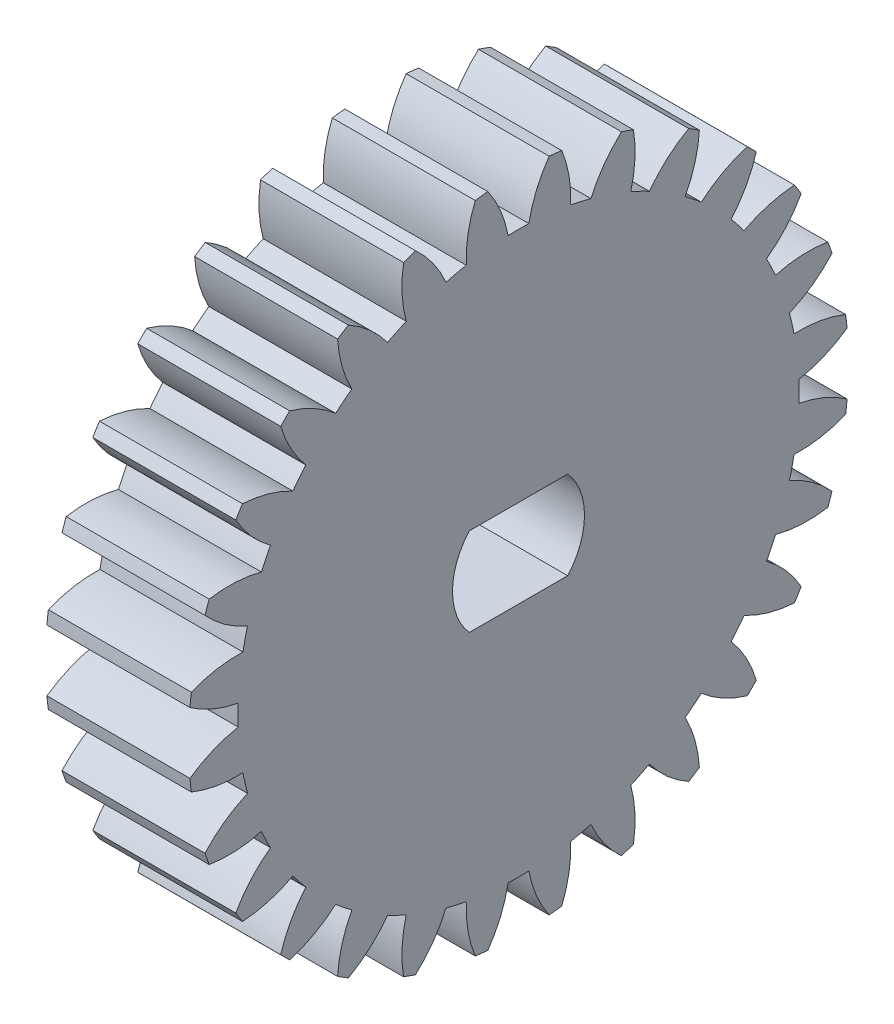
ISO-10303-21;
HEADER;
FILE_DESCRIPTION(('STEP AP214'),'2;1');
FILE_NAME('part.step','',(''),(''),'','','');
FILE_SCHEMA(('AUTOMOTIVE_DESIGN { 1 0 10303 214 1 1 1 1 }'));
ENDSEC;
DATA;
#1=APPLICATION_CONTEXT('core data for automotive mechanical design processes');
#2=APPLICATION_PROTOCOL_DEFINITION('international standard','automotive_design',2000,#1);
#3=PRODUCT_CONTEXT('',#1,'mechanical');
#4=PRODUCT('Part','Part','',(#3));
#5=PRODUCT_RELATED_PRODUCT_CATEGORY('part','',(#4));
#6=PRODUCT_DEFINITION_FORMATION('','',#4);
#7=PRODUCT_DEFINITION_CONTEXT('part definition',#1,'design');
#8=PRODUCT_DEFINITION('design','',#6,#7);
#9=PRODUCT_DEFINITION_SHAPE('','',#8);
#10=(LENGTH_UNIT() NAMED_UNIT(*) SI_UNIT(.MILLI.,.METRE.));
#11=(NAMED_UNIT(*) PLANE_ANGLE_UNIT() SI_UNIT($,.RADIAN.));
#12=(NAMED_UNIT(*) SI_UNIT($,.STERADIAN.) SOLID_ANGLE_UNIT());
#13=UNCERTAINTY_MEASURE_WITH_UNIT(LENGTH_MEASURE(1.E-05),#10,'distance_accuracy_value','');
#14=(GEOMETRIC_REPRESENTATION_CONTEXT(3) GLOBAL_UNCERTAINTY_ASSIGNED_CONTEXT((#13)) GLOBAL_UNIT_ASSIGNED_CONTEXT((#10,
#11,#12)) REPRESENTATION_CONTEXT('',''));
#15=CARTESIAN_POINT('',(0.,0.,0.));
#16=DIRECTION('',(0.,0.,1.));
#17=DIRECTION('',(1.,0.,0.));
#18=AXIS2_PLACEMENT_3D('',#15,#16,#17);
#19=CARTESIAN_POINT('',(6.5,0.,0.));
#20=DIRECTION('',(-1.,0.,0.));
#21=DIRECTION('',(0.,0.,1.));
#22=AXIS2_PLACEMENT_3D('',#19,#20,#21);
#23=PLANE('',#22);
#24=CARTESIAN_POINT('',(6.5,10.0953635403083,-8.43540102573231));
#25=DIRECTION('',(-1.,0.,0.));
#26=DIRECTION('',(0.,-0.222520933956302,-0.974927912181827));
#27=AXIS2_PLACEMENT_3D('',#24,#25,#26);
#28=CIRCLE('',#27,5.6);
#29=CARTESIAN_POINT('',(6.5,12.3159766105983,-3.29449861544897));
#30=VERTEX_POINT('',#29);
#31=CARTESIAN_POINT('',(6.5,14.2507736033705,-4.68139420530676));
#32=VERTEX_POINT('',#31);
#33=EDGE_CURVE('E768',#30,#32,#28,.T.);
#34=ORIENTED_EDGE('',*,*,#33,.F.);
#35=CARTESIAN_POINT('',(6.5,0.,0.));
#36=DIRECTION('',(-1.,0.,0.));
#37=DIRECTION('',(0.,-0.222520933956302,-0.974927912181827));
#38=AXIS2_PLACEMENT_3D('',#35,#36,#37);
#39=CIRCLE('',#38,12.749);
#40=CARTESIAN_POINT('',(6.5,12.5257408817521,-2.37546129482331));
#41=VERTEX_POINT('',#40);
#42=EDGE_CURVE('E772',#41,#30,#39,.T.);
#43=ORIENTED_EDGE('',*,*,#42,.F.);
#44=CARTESIAN_POINT('',(6.5,12.7555915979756,3.21981963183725));
#45=DIRECTION('',(-1.,0.,0.));
#46=DIRECTION('',(0.,-0.222520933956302,-0.974927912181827));
#47=AXIS2_PLACEMENT_3D('',#44,#45,#46);
#48=CIRCLE('',#47,5.6);
#49=CARTESIAN_POINT('',(6.5,14.8706841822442,-1.96538849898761));
#50=VERTEX_POINT('',#49);
#51=EDGE_CURVE('E770',#50,#41,#48,.T.);
#52=ORIENTED_EDGE('',*,*,#51,.F.);
#53=CARTESIAN_POINT('',(6.5,0.,0.));
#54=DIRECTION('',(-1.,0.,0.));
#55=DIRECTION('',(0.,0.,1.));
#56=AXIS2_PLACEMENT_3D('',#53,#54,#55);
#57=CIRCLE('',#56,15.);
#58=CARTESIAN_POINT('',(6.5,14.9351851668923,-1.39292642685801));
#59=VERTEX_POINT('',#58);
#60=EDGE_CURVE('E1385',#59,#50,#57,.T.);
#61=ORIENTED_EDGE('',*,*,#60,.F.);
#62=CARTESIAN_POINT('',(6.5,11.7193050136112,-5.97747818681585));
#63=DIRECTION('',(-1.,0.,0.));
#64=DIRECTION('',(0.,0.,-1.));
#65=AXIS2_PLACEMENT_3D('',#62,#63,#64);
#66=CIRCLE('',#65,5.6);
#67=CARTESIAN_POINT('',(6.5,12.7402842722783,-0.471336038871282));
#68=VERTEX_POINT('',#67);
#69=EDGE_CURVE('E1363',#68,#59,#66,.T.);
#70=ORIENTED_EDGE('',*,*,#69,.F.);
#71=CARTESIAN_POINT('',(6.5,0.,0.));
#72=DIRECTION('',(-1.,0.,0.));
#73=DIRECTION('',(0.,0.,-1.));
#74=AXIS2_PLACEMENT_3D('',#71,#72,#73);
#75=CIRCLE('',#74,12.749);
#76=CARTESIAN_POINT('',(6.5,12.7402842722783,0.47133603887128));
#77=VERTEX_POINT('',#76);
#78=EDGE_CURVE('E1367',#77,#68,#75,.T.);
#79=ORIENTED_EDGE('',*,*,#78,.F.);
#80=CARTESIAN_POINT('',(6.5,11.7193050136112,5.97747818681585));
#81=DIRECTION('',(-1.,0.,0.));
#82=DIRECTION('',(0.,0.,-1.));
#83=AXIS2_PLACEMENT_3D('',#80,#81,#82);
#84=CIRCLE('',#83,5.6);
#85=CARTESIAN_POINT('',(6.5,14.9351851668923,1.39292642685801));
#86=VERTEX_POINT('',#85);
#87=EDGE_CURVE('E1365',#86,#77,#84,.T.);
#88=ORIENTED_EDGE('',*,*,#87,.F.);
#89=CARTESIAN_POINT('',(6.5,14.8706841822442,1.96538849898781));
#90=VERTEX_POINT('',#89);
#91=EDGE_CURVE('E1383',#90,#86,#57,.T.);
#92=ORIENTED_EDGE('',*,*,#91,.F.);
#93=CARTESIAN_POINT('',(6.5,12.7555915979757,-3.21981963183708));
#94=DIRECTION('',(-1.,0.,0.));
#95=DIRECTION('',(0.,0.222520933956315,-0.974927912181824));
#96=AXIS2_PLACEMENT_3D('',#93,#94,#95);
#97=CIRCLE('',#96,5.6);
#98=CARTESIAN_POINT('',(6.5,12.5257408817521,2.37546129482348));
#99=VERTEX_POINT('',#98);
#100=EDGE_CURVE('E1341',#99,#90,#97,.T.);
#101=ORIENTED_EDGE('',*,*,#100,.F.);
#102=CARTESIAN_POINT('',(6.5,0.,0.));
#103=DIRECTION('',(-1.,0.,0.));
#104=DIRECTION('',(0.,0.222520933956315,-0.974927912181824));
#105=AXIS2_PLACEMENT_3D('',#102,#103,#104);
#106=CIRCLE('',#105,12.749);
#107=CARTESIAN_POINT('',(6.5,12.3159766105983,3.29449861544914));
#108=VERTEX_POINT('',#107);
#109=EDGE_CURVE('E1345',#108,#99,#106,.T.);
#110=ORIENTED_EDGE('',*,*,#109,.F.);
#111=CARTESIAN_POINT('',(6.5,10.0953635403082,8.43540102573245));
#112=DIRECTION('',(-1.,0.,0.));
#113=DIRECTION('',(0.,0.222520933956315,-0.974927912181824));
#114=AXIS2_PLACEMENT_3D('',#111,#112,#113);
#115=CIRCLE('',#114,5.6);
#116=CARTESIAN_POINT('',(6.5,14.2507736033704,4.68139420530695));
#117=VERTEX_POINT('',#116);
#118=EDGE_CURVE('E1343',#117,#108,#115,.T.);
#119=ORIENTED_EDGE('',*,*,#118,.F.);
#120=CARTESIAN_POINT('',(6.5,14.0605049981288,5.22515063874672));
#121=VERTEX_POINT('',#120);
#122=EDGE_CURVE('E1606',#121,#117,#57,.T.);
#123=ORIENTED_EDGE('',*,*,#122,.F.);
#124=CARTESIAN_POINT('',(6.5,13.1522595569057,-0.300705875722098));
#125=DIRECTION('',(-1.,0.,0.));
#126=DIRECTION('',(0.,0.433883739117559,-0.900968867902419));
#127=AXIS2_PLACEMENT_3D('',#124,#125,#126);
#128=CIRCLE('',#127,5.6);
#129=CARTESIAN_POINT('',(6.5,11.6831045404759,5.10314308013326));
#130=VERTEX_POINT('',#129);
#131=EDGE_CURVE('E1319',#130,#121,#128,.T.);
#132=ORIENTED_EDGE('',*,*,#131,.F.);
#133=CARTESIAN_POINT('',(6.5,0.,0.));
#134=DIRECTION('',(-1.,0.,0.));
#135=DIRECTION('',(0.,0.433883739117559,-0.900968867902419));
#136=AXIS2_PLACEMENT_3D('',#133,#134,#135);
#137=CIRCLE('',#136,12.749);
#138=CARTESIAN_POINT('',(6.5,11.2740944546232,5.95246127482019));
#139=VERTEX_POINT('',#138);
#140=EDGE_CURVE('E1323',#139,#130,#137,.T.);
#141=ORIENTED_EDGE('',*,*,#140,.F.);
#142=CARTESIAN_POINT('',(6.5,7.9651983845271,10.4703376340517));
#143=DIRECTION('',(-1.,0.,0.));
#144=DIRECTION('',(0.,0.433883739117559,-0.900968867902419));
#145=AXIS2_PLACEMENT_3D('',#142,#143,#144);
#146=CIRCLE('',#145,5.6);
#147=CARTESIAN_POINT('',(6.5,12.8517687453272,7.73511733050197));
#148=VERTEX_POINT('',#147);
#149=EDGE_CURVE('E1321',#148,#139,#146,.T.);
#150=ORIENTED_EDGE('',*,*,#149,.F.);
#151=CARTESIAN_POINT('',(6.5,12.5452733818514,8.22290190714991));
#152=VERTEX_POINT('',#151);
#153=EDGE_CURVE('E1607',#152,#148,#57,.T.);
#154=ORIENTED_EDGE('',*,*,#153,.F.);
#155=CARTESIAN_POINT('',(6.5,12.8894183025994,2.63348652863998));
#156=DIRECTION('',(-1.,0.,0.));
#157=DIRECTION('',(0.,0.623489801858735,-0.781831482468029));
#158=AXIS2_PLACEMENT_3D('',#155,#156,#157);
#159=CIRCLE('',#158,5.6);
#160=CARTESIAN_POINT('',(6.5,10.2546285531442,7.57493196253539));
#161=VERTEX_POINT('',#160);
#162=EDGE_CURVE('E1297',#161,#152,#159,.T.);
#163=ORIENTED_EDGE('',*,*,#162,.F.);
#164=CARTESIAN_POINT('',(6.5,0.,0.));
#165=DIRECTION('',(-1.,0.,0.));
#166=DIRECTION('',(0.,0.623489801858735,-0.781831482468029));
#167=AXIS2_PLACEMENT_3D('',#164,#165,#166);
#168=CIRCLE('',#167,12.749);
#169=CARTESIAN_POINT('',(6.5,9.6668821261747,8.31194267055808));
#170=VERTEX_POINT('',#169);
#171=EDGE_CURVE('E1301',#170,#161,#168,.T.);
#172=ORIENTED_EDGE('',*,*,#171,.F.);
#173=CARTESIAN_POINT('',(6.5,5.43562492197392,11.9802477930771));
#174=DIRECTION('',(-1.,0.,0.));
#175=DIRECTION('',(0.,0.623489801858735,-0.781831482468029));
#176=AXIS2_PLACEMENT_3D('',#173,#174,#175);
#177=CIRCLE('',#176,5.6);
#178=CARTESIAN_POINT('',(6.5,10.8083225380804,10.4009693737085));
#179=VERTEX_POINT('',#178);
#180=EDGE_CURVE('E1299',#179,#170,#177,.T.);
#181=ORIENTED_EDGE('',*,*,#180,.F.);
#182=CARTESIAN_POINT('',(6.5,10.4009693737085,10.8083225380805));
#183=VERTEX_POINT('',#182);
#184=EDGE_CURVE('E1612',#183,#179,#57,.T.);
#185=ORIENTED_EDGE('',*,*,#184,.F.);
#186=CARTESIAN_POINT('',(6.5,11.980247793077,5.43562492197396));
#187=DIRECTION('',(-1.,0.,0.));
#188=DIRECTION('',(0.,0.781831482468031,-0.623489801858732));
#189=AXIS2_PLACEMENT_3D('',#186,#187,#188);
#190=CIRCLE('',#189,5.6);
#191=CARTESIAN_POINT('',(6.5,8.31194267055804,9.66688212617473));
#192=VERTEX_POINT('',#191);
#193=EDGE_CURVE('E1275',#192,#183,#190,.T.);
#194=ORIENTED_EDGE('',*,*,#193,.F.);
#195=CARTESIAN_POINT('',(6.5,0.,0.));
#196=DIRECTION('',(-1.,0.,0.));
#197=DIRECTION('',(0.,0.781831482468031,-0.623489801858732));
#198=AXIS2_PLACEMENT_3D('',#195,#196,#197);
#199=CIRCLE('',#198,12.749);
#200=CARTESIAN_POINT('',(6.5,7.57493196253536,10.2546285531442));
#201=VERTEX_POINT('',#200);
#202=EDGE_CURVE('E1279',#201,#192,#199,.T.);
#203=ORIENTED_EDGE('',*,*,#202,.F.);
#204=CARTESIAN_POINT('',(6.5,2.63348652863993,12.8894183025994));
#205=DIRECTION('',(-1.,0.,0.));
#206=DIRECTION('',(0.,0.781831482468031,-0.623489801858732));
#207=AXIS2_PLACEMENT_3D('',#204,#205,#206);
#208=CIRCLE('',#207,5.6);
#209=CARTESIAN_POINT('',(6.5,8.22290190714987,12.5452733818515));
#210=VERTEX_POINT('',#209);
#211=EDGE_CURVE('E1277',#210,#201,#208,.T.);
#212=ORIENTED_EDGE('',*,*,#211,.F.);
#213=CARTESIAN_POINT('',(6.5,7.73511733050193,12.8517687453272));
#214=VERTEX_POINT('',#213);
#215=EDGE_CURVE('E1617',#214,#210,#57,.T.);
#216=ORIENTED_EDGE('',*,*,#215,.F.);
#217=CARTESIAN_POINT('',(6.5,10.4703376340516,7.96519838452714));
#218=DIRECTION('',(-1.,0.,0.));
#219=DIRECTION('',(0.,0.90096886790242,-0.433883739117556));
#220=AXIS2_PLACEMENT_3D('',#217,#218,#219);
#221=CIRCLE('',#220,5.6);
#222=CARTESIAN_POINT('',(6.5,5.95246127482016,11.2740944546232));
#223=VERTEX_POINT('',#222);
#224=EDGE_CURVE('E1253',#223,#214,#221,.T.);
#225=ORIENTED_EDGE('',*,*,#224,.F.);
#226=CARTESIAN_POINT('',(6.5,0.,0.));
#227=DIRECTION('',(-1.,0.,0.));
#228=DIRECTION('',(0.,0.90096886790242,-0.433883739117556));
#229=AXIS2_PLACEMENT_3D('',#226,#227,#228);
#230=CIRCLE('',#229,12.749);
#231=CARTESIAN_POINT('',(6.5,5.10314308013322,11.6831045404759));
#232=VERTEX_POINT('',#231);
#233=EDGE_CURVE('E1257',#232,#223,#230,.T.);
#234=ORIENTED_EDGE('',*,*,#233,.F.);
#235=CARTESIAN_POINT('',(6.5,-0.300705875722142,13.1522595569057));
#236=DIRECTION('',(-1.,0.,0.));
#237=DIRECTION('',(0.,0.90096886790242,-0.433883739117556));
#238=AXIS2_PLACEMENT_3D('',#235,#236,#237);
#239=CIRCLE('',#238,5.6);
#240=CARTESIAN_POINT('',(6.5,5.22515063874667,14.0605049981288));
#241=VERTEX_POINT('',#240);
#242=EDGE_CURVE('E1255',#241,#232,#239,.T.);
#243=ORIENTED_EDGE('',*,*,#242,.F.);
#244=CARTESIAN_POINT('',(6.5,4.6813942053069,14.2507736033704));
#245=VERTEX_POINT('',#244);
#246=EDGE_CURVE('E1622',#245,#241,#57,.T.);
#247=ORIENTED_EDGE('',*,*,#246,.F.);
#248=CARTESIAN_POINT('',(6.5,8.43540102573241,10.0953635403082));
#249=DIRECTION('',(-1.,0.,0.));
#250=DIRECTION('',(0.,0.974927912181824,-0.222520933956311));
#251=AXIS2_PLACEMENT_3D('',#248,#249,#250);
#252=CIRCLE('',#251,5.6);
#253=CARTESIAN_POINT('',(6.5,3.2944986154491,12.3159766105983));
#254=VERTEX_POINT('',#253);
#255=EDGE_CURVE('E1230',#254,#245,#252,.T.);
#256=ORIENTED_EDGE('',*,*,#255,.F.);
#257=CARTESIAN_POINT('',(6.5,0.,0.));
#258=DIRECTION('',(-1.,0.,0.));
#259=DIRECTION('',(0.,0.974927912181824,-0.222520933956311));
#260=AXIS2_PLACEMENT_3D('',#257,#258,#259);
#261=CIRCLE('',#260,12.749);
#262=CARTESIAN_POINT('',(6.5,2.37546129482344,12.5257408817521));
#263=VERTEX_POINT('',#262);
#264=EDGE_CURVE('E1235',#263,#254,#261,.T.);
#265=ORIENTED_EDGE('',*,*,#264,.F.);
#266=CARTESIAN_POINT('',(6.5,-3.21981963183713,12.7555915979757));
#267=DIRECTION('',(-1.,0.,0.));
#268=DIRECTION('',(0.,0.974927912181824,-0.222520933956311));
#269=AXIS2_PLACEMENT_3D('',#266,#267,#268);
#270=CIRCLE('',#269,5.6);
#271=CARTESIAN_POINT('',(6.5,1.96538849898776,14.8706841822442));
#272=VERTEX_POINT('',#271);
#273=EDGE_CURVE('E1233',#272,#263,#270,.T.);
#274=ORIENTED_EDGE('',*,*,#273,.F.);
#275=CARTESIAN_POINT('',(6.5,1.39292642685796,14.9351851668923));
#276=VERTEX_POINT('',#275);
#277=EDGE_CURVE('E1627',#276,#272,#57,.T.);
#278=ORIENTED_EDGE('',*,*,#277,.F.);
#279=CARTESIAN_POINT('',(6.5,5.9774781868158,11.7193050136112));
#280=DIRECTION('',(-1.,0.,0.));
#281=DIRECTION('',(0.,1.,0.));
#282=AXIS2_PLACEMENT_3D('',#279,#280,#281);
#283=CIRCLE('',#282,5.6);
#284=CARTESIAN_POINT('',(6.5,0.471336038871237,12.7402842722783));
#285=VERTEX_POINT('',#284);
#286=EDGE_CURVE('E1208',#285,#276,#283,.T.);
#287=ORIENTED_EDGE('',*,*,#286,.F.);
#288=CARTESIAN_POINT('',(6.5,0.,0.));
#289=DIRECTION('',(-1.,0.,0.));
#290=DIRECTION('',(0.,1.,0.));
#291=AXIS2_PLACEMENT_3D('',#288,#289,#290);
#292=CIRCLE('',#291,12.749);
#293=CARTESIAN_POINT('',(6.5,-0.471336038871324,12.7402842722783));
#294=VERTEX_POINT('',#293);
#295=EDGE_CURVE('E1212',#294,#285,#292,.T.);
#296=ORIENTED_EDGE('',*,*,#295,.F.);
#297=CARTESIAN_POINT('',(6.5,-5.97747818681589,11.7193050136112));
#298=DIRECTION('',(-1.,0.,0.));
#299=DIRECTION('',(0.,1.,0.));
#300=AXIS2_PLACEMENT_3D('',#297,#298,#299);
#301=CIRCLE('',#300,5.6);
#302=CARTESIAN_POINT('',(6.5,-1.39292642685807,14.9351851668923));
#303=VERTEX_POINT('',#302);
#304=EDGE_CURVE('E1210',#303,#294,#301,.T.);
#305=ORIENTED_EDGE('',*,*,#304,.F.);
#306=CARTESIAN_POINT('',(6.5,-1.96538849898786,14.8706841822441));
#307=VERTEX_POINT('',#306);
#308=EDGE_CURVE('E1632',#307,#303,#57,.T.);
#309=ORIENTED_EDGE('',*,*,#308,.F.);
#310=CARTESIAN_POINT('',(6.5,3.21981963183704,12.7555915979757));
#311=DIRECTION('',(-1.,0.,0.));
#312=DIRECTION('',(0.,0.974927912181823,0.222520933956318));
#313=AXIS2_PLACEMENT_3D('',#310,#311,#312);
#314=CIRCLE('',#313,5.6);
#315=CARTESIAN_POINT('',(6.5,-2.37546129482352,12.5257408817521));
#316=VERTEX_POINT('',#315);
#317=EDGE_CURVE('E1186',#316,#307,#314,.T.);
#318=ORIENTED_EDGE('',*,*,#317,.F.);
#319=CARTESIAN_POINT('',(6.5,0.,0.));
#320=DIRECTION('',(-1.,0.,0.));
#321=DIRECTION('',(0.,0.974927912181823,0.222520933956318));
#322=AXIS2_PLACEMENT_3D('',#319,#320,#321);
#323=CIRCLE('',#322,12.749);
#324=CARTESIAN_POINT('',(6.5,-3.29449861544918,12.3159766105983));
#325=VERTEX_POINT('',#324);
#326=EDGE_CURVE('E1190',#325,#316,#323,.T.);
#327=ORIENTED_EDGE('',*,*,#326,.F.);
#328=CARTESIAN_POINT('',(6.5,-8.43540102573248,10.0953635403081));
#329=DIRECTION('',(-1.,0.,0.));
#330=DIRECTION('',(0.,0.974927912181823,0.222520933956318));
#331=AXIS2_PLACEMENT_3D('',#328,#329,#330);
#332=CIRCLE('',#331,5.6);
#333=CARTESIAN_POINT('',(6.5,-4.681394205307,14.2507736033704));
#334=VERTEX_POINT('',#333);
#335=EDGE_CURVE('E1188',#334,#325,#332,.T.);
#336=ORIENTED_EDGE('',*,*,#335,.F.);
#337=CARTESIAN_POINT('',(6.5,-5.22515063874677,14.0605049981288));
#338=VERTEX_POINT('',#337);
#339=EDGE_CURVE('E1637',#338,#334,#57,.T.);
#340=ORIENTED_EDGE('',*,*,#339,.F.);
#341=CARTESIAN_POINT('',(6.5,0.300705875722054,13.1522595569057));
#342=DIRECTION('',(-1.,0.,0.));
#343=DIRECTION('',(0.,0.900968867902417,0.433883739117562));
#344=AXIS2_PLACEMENT_3D('',#341,#342,#343);
#345=CIRCLE('',#344,5.6);
#346=CARTESIAN_POINT('',(6.5,-5.1031430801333,11.6831045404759));
#347=VERTEX_POINT('',#346);
#348=EDGE_CURVE('E1164',#347,#338,#345,.T.);
#349=ORIENTED_EDGE('',*,*,#348,.F.);
#350=CARTESIAN_POINT('',(6.5,0.,0.));
#351=DIRECTION('',(-1.,0.,0.));
#352=DIRECTION('',(0.,0.900968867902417,0.433883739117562));
#353=AXIS2_PLACEMENT_3D('',#350,#351,#352);
#354=CIRCLE('',#353,12.749);
#355=CARTESIAN_POINT('',(6.5,-5.95246127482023,11.2740944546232));
#356=VERTEX_POINT('',#355);
#357=EDGE_CURVE('E1168',#356,#347,#354,.T.);
#358=ORIENTED_EDGE('',*,*,#357,.F.);
#359=CARTESIAN_POINT('',(6.5,-10.4703376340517,7.96519838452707));
#360=DIRECTION('',(-1.,0.,0.));
#361=DIRECTION('',(0.,0.900968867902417,0.433883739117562));
#362=AXIS2_PLACEMENT_3D('',#359,#360,#361);
#363=CIRCLE('',#362,5.6);
#364=CARTESIAN_POINT('',(6.5,-7.73511733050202,12.8517687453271));
#365=VERTEX_POINT('',#364);
#366=EDGE_CURVE('E1166',#365,#356,#363,.T.);
#367=ORIENTED_EDGE('',*,*,#366,.F.);
#368=CARTESIAN_POINT('',(6.5,-8.22290190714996,12.5452733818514));
#369=VERTEX_POINT('',#368);
#370=EDGE_CURVE('E1642',#369,#365,#57,.T.);
#371=ORIENTED_EDGE('',*,*,#370,.F.);
#372=CARTESIAN_POINT('',(6.5,-2.63348652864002,12.8894183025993));
#373=DIRECTION('',(-1.,0.,0.));
#374=DIRECTION('',(0.,0.781831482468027,0.623489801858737));
#375=AXIS2_PLACEMENT_3D('',#372,#373,#374);
#376=CIRCLE('',#375,5.6);
#377=CARTESIAN_POINT('',(6.5,-7.57493196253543,10.2546285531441));
#378=VERTEX_POINT('',#377);
#379=EDGE_CURVE('E1142',#378,#369,#376,.T.);
#380=ORIENTED_EDGE('',*,*,#379,.F.);
#381=CARTESIAN_POINT('',(6.5,0.,0.));
#382=DIRECTION('',(-1.,0.,0.));
#383=DIRECTION('',(0.,0.781831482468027,0.623489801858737));
#384=AXIS2_PLACEMENT_3D('',#381,#382,#383);
#385=CIRCLE('',#384,12.749);
#386=CARTESIAN_POINT('',(6.5,-8.31194267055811,9.66688212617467));
#387=VERTEX_POINT('',#386);
#388=EDGE_CURVE('E1146',#387,#378,#385,.T.);
#389=ORIENTED_EDGE('',*,*,#388,.F.);
#390=CARTESIAN_POINT('',(6.5,-11.9802477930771,5.43562492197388));
#391=DIRECTION('',(-1.,0.,0.));
#392=DIRECTION('',(0.,0.781831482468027,0.623489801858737));
#393=AXIS2_PLACEMENT_3D('',#390,#391,#392);
#394=CIRCLE('',#393,5.6);
#395=CARTESIAN_POINT('',(6.5,-10.4009693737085,10.8083225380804));
#396=VERTEX_POINT('',#395);
#397=EDGE_CURVE('E1144',#396,#387,#394,.T.);
#398=ORIENTED_EDGE('',*,*,#397,.F.);
#399=CARTESIAN_POINT('',(6.5,-10.8083225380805,10.4009693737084));
#400=VERTEX_POINT('',#399);
#401=EDGE_CURVE('E1647',#400,#396,#57,.T.);
#402=ORIENTED_EDGE('',*,*,#401,.F.);
#403=CARTESIAN_POINT('',(6.5,-5.435624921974,11.980247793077));
#404=DIRECTION('',(-1.,0.,0.));
#405=DIRECTION('',(0.,0.623489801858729,0.781831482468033));
#406=AXIS2_PLACEMENT_3D('',#403,#404,#405);
#407=CIRCLE('',#406,5.6);
#408=CARTESIAN_POINT('',(6.5,-9.66688212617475,8.31194267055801));
#409=VERTEX_POINT('',#408);
#410=EDGE_CURVE('E1120',#409,#400,#407,.T.);
#411=ORIENTED_EDGE('',*,*,#410,.F.);
#412=CARTESIAN_POINT('',(6.5,0.,0.));
#413=DIRECTION('',(-1.,0.,0.));
#414=DIRECTION('',(0.,0.623489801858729,0.781831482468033));
#415=AXIS2_PLACEMENT_3D('',#412,#413,#414);
#416=CIRCLE('',#415,12.749);
#417=CARTESIAN_POINT('',(6.5,-10.2546285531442,7.57493196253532));
#418=VERTEX_POINT('',#417);
#419=EDGE_CURVE('E1124',#418,#409,#416,.T.);
#420=ORIENTED_EDGE('',*,*,#419,.F.);
#421=CARTESIAN_POINT('',(6.5,-12.8894183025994,2.63348652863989));
#422=DIRECTION('',(-1.,0.,0.));
#423=DIRECTION('',(0.,0.623489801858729,0.781831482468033));
#424=AXIS2_PLACEMENT_3D('',#421,#422,#423);
#425=CIRCLE('',#424,5.6);
#426=CARTESIAN_POINT('',(6.5,-12.5452733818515,8.22290190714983));
#427=VERTEX_POINT('',#426);
#428=EDGE_CURVE('E1122',#427,#418,#425,.T.);
#429=ORIENTED_EDGE('',*,*,#428,.F.);
#430=CARTESIAN_POINT('',(6.5,-12.8517687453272,7.73511733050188));
#431=VERTEX_POINT('',#430);
#432=EDGE_CURVE('E1652',#431,#427,#57,.T.);
#433=ORIENTED_EDGE('',*,*,#432,.F.);
#434=CARTESIAN_POINT('',(6.5,-7.96519838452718,10.4703376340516));
#435=DIRECTION('',(-1.,0.,0.));
#436=DIRECTION('',(0.,0.433883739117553,0.900968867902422));
#437=AXIS2_PLACEMENT_3D('',#434,#435,#436);
#438=CIRCLE('',#437,5.6);
#439=CARTESIAN_POINT('',(6.5,-11.2740944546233,5.95246127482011));
#440=VERTEX_POINT('',#439);
#441=EDGE_CURVE('E1098',#440,#431,#438,.T.);
#442=ORIENTED_EDGE('',*,*,#441,.F.);
#443=CARTESIAN_POINT('',(6.5,0.,0.));
#444=DIRECTION('',(-1.,0.,0.));
#445=DIRECTION('',(0.,0.433883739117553,0.900968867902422));
#446=AXIS2_PLACEMENT_3D('',#443,#444,#445);
#447=CIRCLE('',#446,12.749);
#448=CARTESIAN_POINT('',(6.5,-11.6831045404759,5.10314308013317));
#449=VERTEX_POINT('',#448);
#450=EDGE_CURVE('E1102',#449,#440,#447,.T.);
#451=ORIENTED_EDGE('',*,*,#450,.F.);
#452=CARTESIAN_POINT('',(6.5,-13.1522595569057,-0.300705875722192));
#453=DIRECTION('',(-1.,0.,0.));
#454=DIRECTION('',(0.,0.433883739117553,0.900968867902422));
#455=AXIS2_PLACEMENT_3D('',#452,#453,#454);
#456=CIRCLE('',#455,5.6);
#457=CARTESIAN_POINT('',(6.5,-14.0605049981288,5.22515063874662));
#458=VERTEX_POINT('',#457);
#459=EDGE_CURVE('E1100',#458,#449,#456,.T.);
#460=ORIENTED_EDGE('',*,*,#459,.F.);
#461=CARTESIAN_POINT('',(6.5,-14.2507736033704,4.68139420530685));
#462=VERTEX_POINT('',#461);
#463=EDGE_CURVE('E1657',#462,#458,#57,.T.);
#464=ORIENTED_EDGE('',*,*,#463,.F.);
#465=CARTESIAN_POINT('',(6.5,-10.0953635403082,8.43540102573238));
#466=DIRECTION('',(-1.,0.,0.));
#467=DIRECTION('',(0.,0.222520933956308,0.974927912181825));
#468=AXIS2_PLACEMENT_3D('',#465,#466,#467);
#469=CIRCLE('',#468,5.6);
#470=CARTESIAN_POINT('',(6.5,-12.3159766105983,3.29449861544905));
#471=VERTEX_POINT('',#470);
#472=EDGE_CURVE('E1076',#471,#462,#469,.T.);
#473=ORIENTED_EDGE('',*,*,#472,.F.);
#474=CARTESIAN_POINT('',(6.5,0.,0.));
#475=DIRECTION('',(-1.,0.,0.));
#476=DIRECTION('',(0.,0.222520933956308,0.974927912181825));
#477=AXIS2_PLACEMENT_3D('',#474,#475,#476);
#478=CIRCLE('',#477,12.749);
#479=CARTESIAN_POINT('',(6.5,-12.5257408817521,2.37546129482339));
#480=VERTEX_POINT('',#479);
#481=EDGE_CURVE('E1080',#480,#471,#478,.T.);
#482=ORIENTED_EDGE('',*,*,#481,.F.);
#483=CARTESIAN_POINT('',(6.5,-12.7555915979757,-3.21981963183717));
#484=DIRECTION('',(-1.,0.,0.));
#485=DIRECTION('',(0.,0.222520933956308,0.974927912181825));
#486=AXIS2_PLACEMENT_3D('',#483,#484,#485);
#487=CIRCLE('',#486,5.6);
#488=CARTESIAN_POINT('',(6.5,-14.8706841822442,1.96538849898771));
#489=VERTEX_POINT('',#488);
#490=EDGE_CURVE('E1078',#489,#480,#487,.T.);
#491=ORIENTED_EDGE('',*,*,#490,.F.);
#492=CARTESIAN_POINT('',(6.5,-14.9351851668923,1.39292642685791));
#493=VERTEX_POINT('',#492);
#494=EDGE_CURVE('E1662',#493,#489,#57,.T.);
#495=ORIENTED_EDGE('',*,*,#494,.F.);
#496=CARTESIAN_POINT('',(6.5,-11.7193050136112,5.97747818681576));
#497=DIRECTION('',(-1.,0.,0.));
#498=DIRECTION('',(0.,0.,1.));
#499=AXIS2_PLACEMENT_3D('',#496,#497,#498);
#500=CIRCLE('',#499,5.6);
#501=CARTESIAN_POINT('',(6.5,-12.7402842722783,0.471336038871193));
#502=VERTEX_POINT('',#501);
#503=EDGE_CURVE('E1053',#502,#493,#500,.T.);
#504=ORIENTED_EDGE('',*,*,#503,.F.);
#505=CARTESIAN_POINT('',(6.5,0.,0.));
#506=DIRECTION('',(-1.,0.,0.));
#507=DIRECTION('',(0.,0.,1.));
#508=AXIS2_PLACEMENT_3D('',#505,#506,#507);
#509=CIRCLE('',#508,12.749);
#510=CARTESIAN_POINT('',(6.5,-12.7402842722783,-0.471336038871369));
#511=VERTEX_POINT('',#510);
#512=EDGE_CURVE('E1057',#511,#502,#509,.T.);
#513=ORIENTED_EDGE('',*,*,#512,.F.);
#514=CARTESIAN_POINT('',(6.5,-11.7193050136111,-5.97747818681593));
#515=DIRECTION('',(-1.,0.,0.));
#516=DIRECTION('',(0.,0.,1.));
#517=AXIS2_PLACEMENT_3D('',#514,#515,#516);
#518=CIRCLE('',#517,5.6);
#519=CARTESIAN_POINT('',(6.5,-14.9351851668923,-1.39292642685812));
#520=VERTEX_POINT('',#519);
#521=EDGE_CURVE('E1055',#520,#511,#518,.T.);
#522=ORIENTED_EDGE('',*,*,#521,.F.);
#523=CARTESIAN_POINT('',(6.5,-14.8706841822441,-1.96538849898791));
#524=VERTEX_POINT('',#523);
#525=EDGE_CURVE('E1667',#524,#520,#57,.T.);
#526=ORIENTED_EDGE('',*,*,#525,.F.);
#527=CARTESIAN_POINT('',(6.5,-12.7555915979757,3.21981963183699));
#528=DIRECTION('',(-1.,0.,0.));
#529=DIRECTION('',(0.,-0.222520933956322,0.974927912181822));
#530=AXIS2_PLACEMENT_3D('',#527,#528,#529);
#531=CIRCLE('',#530,5.6);
#532=CARTESIAN_POINT('',(6.5,-12.5257408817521,-2.37546129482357));
#533=VERTEX_POINT('',#532);
#534=EDGE_CURVE('E1031',#533,#524,#531,.T.);
#535=ORIENTED_EDGE('',*,*,#534,.F.);
#536=CARTESIAN_POINT('',(6.5,0.,0.));
#537=DIRECTION('',(-1.,0.,0.));
#538=DIRECTION('',(0.,-0.222520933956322,0.974927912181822));
#539=AXIS2_PLACEMENT_3D('',#536,#537,#538);
#540=CIRCLE('',#539,12.749);
#541=CARTESIAN_POINT('',(6.5,-12.3159766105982,-3.29449861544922));
#542=VERTEX_POINT('',#541);
#543=EDGE_CURVE('E1035',#542,#533,#540,.T.);
#544=ORIENTED_EDGE('',*,*,#543,.F.);
#545=CARTESIAN_POINT('',(6.5,-10.0953635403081,-8.43540102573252));
#546=DIRECTION('',(-1.,0.,0.));
#547=DIRECTION('',(0.,-0.222520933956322,0.974927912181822));
#548=AXIS2_PLACEMENT_3D('',#545,#546,#547);
#549=CIRCLE('',#548,5.6);
#550=CARTESIAN_POINT('',(6.5,-14.2507736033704,-4.68139420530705));
#551=VERTEX_POINT('',#550);
#552=EDGE_CURVE('E1033',#551,#542,#549,.T.);
#553=ORIENTED_EDGE('',*,*,#552,.F.);
#554=CARTESIAN_POINT('',(6.5,-14.0605049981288,-5.22515063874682));
#555=VERTEX_POINT('',#554);
#556=EDGE_CURVE('E1672',#555,#551,#57,.T.);
#557=ORIENTED_EDGE('',*,*,#556,.F.);
#558=CARTESIAN_POINT('',(6.5,-13.1522595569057,0.300705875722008));
#559=DIRECTION('',(-1.,0.,0.));
#560=DIRECTION('',(0.,-0.433883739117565,0.900968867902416));
#561=AXIS2_PLACEMENT_3D('',#558,#559,#560);
#562=CIRCLE('',#561,5.6);
#563=CARTESIAN_POINT('',(6.5,-11.6831045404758,-5.10314308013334));
#564=VERTEX_POINT('',#563);
#565=EDGE_CURVE('E1009',#564,#555,#562,.T.);
#566=ORIENTED_EDGE('',*,*,#565,.F.);
#567=CARTESIAN_POINT('',(6.5,0.,0.));
#568=DIRECTION('',(-1.,0.,0.));
#569=DIRECTION('',(0.,-0.433883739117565,0.900968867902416));
#570=AXIS2_PLACEMENT_3D('',#567,#568,#569);
#571=CIRCLE('',#570,12.749);
#572=CARTESIAN_POINT('',(6.5,-11.2740944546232,-5.95246127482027));
#573=VERTEX_POINT('',#572);
#574=EDGE_CURVE('E1013',#573,#564,#571,.T.);
#575=ORIENTED_EDGE('',*,*,#574,.F.);
#576=CARTESIAN_POINT('',(6.5,-7.96519838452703,-10.4703376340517));
#577=DIRECTION('',(-1.,0.,0.));
#578=DIRECTION('',(0.,-0.433883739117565,0.900968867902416));
#579=AXIS2_PLACEMENT_3D('',#576,#577,#578);
#580=CIRCLE('',#579,5.6);
#581=CARTESIAN_POINT('',(6.5,-12.8517687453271,-7.73511733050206));
#582=VERTEX_POINT('',#581);
#583=EDGE_CURVE('E1011',#582,#573,#580,.T.);
#584=ORIENTED_EDGE('',*,*,#583,.F.);
#585=CARTESIAN_POINT('',(6.5,-12.5452733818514,-8.22290190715));
#586=VERTEX_POINT('',#585);
#587=EDGE_CURVE('E1677',#586,#582,#57,.T.);
#588=ORIENTED_EDGE('',*,*,#587,.F.);
#589=CARTESIAN_POINT('',(6.5,-12.8894183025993,-2.63348652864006));
#590=DIRECTION('',(-1.,0.,0.));
#591=DIRECTION('',(0.,-0.62348980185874,0.781831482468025));
#592=AXIS2_PLACEMENT_3D('',#589,#590,#591);
#593=CIRCLE('',#592,5.6);
#594=CARTESIAN_POINT('',(6.5,-10.2546285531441,-7.57493196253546));
#595=VERTEX_POINT('',#594);
#596=EDGE_CURVE('E987',#595,#586,#593,.T.);
#597=ORIENTED_EDGE('',*,*,#596,.F.);
#598=CARTESIAN_POINT('',(6.5,0.,0.));
#599=DIRECTION('',(-1.,0.,0.));
#600=DIRECTION('',(0.,-0.62348980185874,0.781831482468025));
#601=AXIS2_PLACEMENT_3D('',#598,#599,#600);
#602=CIRCLE('',#601,12.749);
#603=CARTESIAN_POINT('',(6.5,-9.66688212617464,-8.31194267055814));
#604=VERTEX_POINT('',#603);
#605=EDGE_CURVE('E991',#604,#595,#602,.T.);
#606=ORIENTED_EDGE('',*,*,#605,.F.);
#607=CARTESIAN_POINT('',(6.5,-5.43562492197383,-11.9802477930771));
#608=DIRECTION('',(-1.,0.,0.));
#609=DIRECTION('',(0.,-0.62348980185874,0.781831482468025));
#610=AXIS2_PLACEMENT_3D('',#607,#608,#609);
#611=CIRCLE('',#610,5.6);
#612=CARTESIAN_POINT('',(6.5,-10.8083225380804,-10.4009693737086));
#613=VERTEX_POINT('',#612);
#614=EDGE_CURVE('E989',#613,#604,#611,.T.);
#615=ORIENTED_EDGE('',*,*,#614,.F.);
#616=CARTESIAN_POINT('',(6.5,-10.4009693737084,-10.8083225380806));
#617=VERTEX_POINT('',#616);
#618=EDGE_CURVE('E1682',#617,#613,#57,.T.);
#619=ORIENTED_EDGE('',*,*,#618,.F.);
#620=CARTESIAN_POINT('',(6.5,-11.980247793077,-5.43562492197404));
#621=DIRECTION('',(-1.,0.,0.));
#622=DIRECTION('',(0.,-0.781831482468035,0.623489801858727));
#623=AXIS2_PLACEMENT_3D('',#620,#621,#622);
#624=CIRCLE('',#623,5.6);
#625=CARTESIAN_POINT('',(6.5,-8.31194267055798,-9.66688212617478));
#626=VERTEX_POINT('',#625);
#627=EDGE_CURVE('E965',#626,#617,#624,.T.);
#628=ORIENTED_EDGE('',*,*,#627,.F.);
#629=CARTESIAN_POINT('',(6.5,0.,0.));
#630=DIRECTION('',(-1.,0.,0.));
#631=DIRECTION('',(0.,-0.781831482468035,0.623489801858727));
#632=AXIS2_PLACEMENT_3D('',#629,#630,#631);
#633=CIRCLE('',#632,12.749);
#634=CARTESIAN_POINT('',(6.5,-7.57493196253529,-10.2546285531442));
#635=VERTEX_POINT('',#634);
#636=EDGE_CURVE('E969',#635,#626,#633,.T.);
#637=ORIENTED_EDGE('',*,*,#636,.F.);
#638=CARTESIAN_POINT('',(6.5,-2.63348652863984,-12.8894183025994));
#639=DIRECTION('',(-1.,0.,0.));
#640=DIRECTION('',(0.,-0.781831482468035,0.623489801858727));
#641=AXIS2_PLACEMENT_3D('',#638,#639,#640);
#642=CIRCLE('',#641,5.6);
#643=CARTESIAN_POINT('',(6.5,-8.22290190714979,-12.5452733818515));
#644=VERTEX_POINT('',#643);
#645=EDGE_CURVE('E967',#644,#635,#642,.T.);
#646=ORIENTED_EDGE('',*,*,#645,.F.);
#647=CARTESIAN_POINT('',(6.5,-7.73511733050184,-12.8517687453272));
#648=VERTEX_POINT('',#647);
#649=EDGE_CURVE('E1687',#648,#644,#57,.T.);
#650=ORIENTED_EDGE('',*,*,#649,.F.);
#651=CARTESIAN_POINT('',(6.5,-10.4703376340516,-7.96519838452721));
#652=DIRECTION('',(-1.,0.,0.));
#653=DIRECTION('',(0.,-0.900968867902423,0.433883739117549));
#654=AXIS2_PLACEMENT_3D('',#651,#652,#653);
#655=CIRCLE('',#654,5.6);
#656=CARTESIAN_POINT('',(6.5,-5.95246127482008,-11.2740944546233));
#657=VERTEX_POINT('',#656);
#658=EDGE_CURVE('E943',#657,#648,#655,.T.);
#659=ORIENTED_EDGE('',*,*,#658,.F.);
#660=CARTESIAN_POINT('',(6.5,0.,0.));
#661=DIRECTION('',(-1.,0.,0.));
#662=DIRECTION('',(0.,-0.900968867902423,0.433883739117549));
#663=AXIS2_PLACEMENT_3D('',#660,#661,#662);
#664=CIRCLE('',#663,12.749);
#665=CARTESIAN_POINT('',(6.5,-5.10314308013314,-11.6831045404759));
#666=VERTEX_POINT('',#665);
#667=EDGE_CURVE('E947',#666,#657,#664,.T.);
#668=ORIENTED_EDGE('',*,*,#667,.F.);
#669=CARTESIAN_POINT('',(6.5,0.300705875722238,-13.1522595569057));
#670=DIRECTION('',(-1.,0.,0.));
#671=DIRECTION('',(0.,-0.900968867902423,0.433883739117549));
#672=AXIS2_PLACEMENT_3D('',#669,#670,#671);
#673=CIRCLE('',#672,5.6);
#674=CARTESIAN_POINT('',(6.5,-5.22515063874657,-14.0605049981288));
#675=VERTEX_POINT('',#674);
#676=EDGE_CURVE('E945',#675,#666,#673,.T.);
#677=ORIENTED_EDGE('',*,*,#676,.F.);
#678=CARTESIAN_POINT('',(6.5,-4.68139420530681,-14.2507736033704));
#679=VERTEX_POINT('',#678);
#680=EDGE_CURVE('E1692',#679,#675,#57,.T.);
#681=ORIENTED_EDGE('',*,*,#680,.F.);
#682=CARTESIAN_POINT('',(6.5,-8.43540102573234,-10.0953635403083));
#683=DIRECTION('',(-1.,0.,0.));
#684=DIRECTION('',(0.,-0.974927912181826,0.222520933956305));
#685=AXIS2_PLACEMENT_3D('',#682,#683,#684);
#686=CIRCLE('',#685,5.6);
#687=CARTESIAN_POINT('',(6.5,-3.29449861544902,-12.3159766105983));
#688=VERTEX_POINT('',#687);
#689=EDGE_CURVE('E921',#688,#679,#686,.T.);
#690=ORIENTED_EDGE('',*,*,#689,.F.);
#691=CARTESIAN_POINT('',(6.5,0.,0.));
#692=DIRECTION('',(-1.,0.,0.));
#693=DIRECTION('',(0.,-0.974927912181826,0.222520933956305));
#694=AXIS2_PLACEMENT_3D('',#691,#692,#693);
#695=CIRCLE('',#694,12.749);
#696=CARTESIAN_POINT('',(6.5,-2.37546129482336,-12.5257408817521));
#697=VERTEX_POINT('',#696);
#698=EDGE_CURVE('E925',#697,#688,#695,.T.);
#699=ORIENTED_EDGE('',*,*,#698,.F.);
#700=CARTESIAN_POINT('',(6.5,3.21981963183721,-12.7555915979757));
#701=DIRECTION('',(-1.,0.,0.));
#702=DIRECTION('',(0.,-0.974927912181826,0.222520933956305));
#703=AXIS2_PLACEMENT_3D('',#700,#701,#702);
#704=CIRCLE('',#703,5.6);
#705=CARTESIAN_POINT('',(6.5,-1.96538849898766,-14.8706841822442));
#706=VERTEX_POINT('',#705);
#707=EDGE_CURVE('E923',#706,#697,#704,.T.);
#708=ORIENTED_EDGE('',*,*,#707,.F.);
#709=CARTESIAN_POINT('',(6.5,-1.39292642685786,-14.9351851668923));
#710=VERTEX_POINT('',#709);
#711=EDGE_CURVE('E1697',#710,#706,#57,.T.);
#712=ORIENTED_EDGE('',*,*,#711,.F.);
#713=CARTESIAN_POINT('',(6.5,-5.97747818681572,-11.7193050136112));
#714=DIRECTION('',(-1.,0.,0.));
#715=DIRECTION('',(0.,-1.,0.));
#716=AXIS2_PLACEMENT_3D('',#713,#714,#715);
#717=CIRCLE('',#716,5.6);
#718=CARTESIAN_POINT('',(6.5,-0.471336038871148,-12.7402842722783));
#719=VERTEX_POINT('',#718);
#720=EDGE_CURVE('E899',#719,#710,#717,.T.);
#721=ORIENTED_EDGE('',*,*,#720,.F.);
#722=CARTESIAN_POINT('',(6.5,0.,0.));
#723=DIRECTION('',(-1.,0.,0.));
#724=DIRECTION('',(0.,-1.,0.));
#725=AXIS2_PLACEMENT_3D('',#722,#723,#724);
#726=CIRCLE('',#725,12.749);
#727=CARTESIAN_POINT('',(6.5,0.471336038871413,-12.7402842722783));
#728=VERTEX_POINT('',#727);
#729=EDGE_CURVE('E903',#728,#719,#726,.T.);
#730=ORIENTED_EDGE('',*,*,#729,.F.);
#731=CARTESIAN_POINT('',(6.5,5.97747818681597,-11.7193050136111));
#732=DIRECTION('',(-1.,0.,0.));
#733=DIRECTION('',(0.,-1.,0.));
#734=AXIS2_PLACEMENT_3D('',#731,#732,#733);
#735=CIRCLE('',#734,5.6);
#736=CARTESIAN_POINT('',(6.5,1.39292642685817,-14.9351851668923));
#737=VERTEX_POINT('',#736);
#738=EDGE_CURVE('E901',#737,#728,#735,.T.);
#739=ORIENTED_EDGE('',*,*,#738,.F.);
#740=CARTESIAN_POINT('',(6.5,1.96538849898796,-14.8706841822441));
#741=VERTEX_POINT('',#740);
#742=EDGE_CURVE('E1702',#741,#737,#57,.T.);
#743=ORIENTED_EDGE('',*,*,#742,.F.);
#744=CARTESIAN_POINT('',(6.5,-3.21981963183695,-12.7555915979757));
#745=DIRECTION('',(-1.,0.,0.));
#746=DIRECTION('',(0.,-0.974927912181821,-0.222520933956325));
#747=AXIS2_PLACEMENT_3D('',#744,#745,#746);
#748=CIRCLE('',#747,5.6);
#749=CARTESIAN_POINT('',(6.5,2.37546129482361,-12.5257408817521));
#750=VERTEX_POINT('',#749);
#751=EDGE_CURVE('E877',#750,#741,#748,.T.);
#752=ORIENTED_EDGE('',*,*,#751,.F.);
#753=CARTESIAN_POINT('',(6.5,0.,0.));
#754=DIRECTION('',(-1.,0.,0.));
#755=DIRECTION('',(0.,-0.974927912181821,-0.222520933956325));
#756=AXIS2_PLACEMENT_3D('',#753,#754,#755);
#757=CIRCLE('',#756,12.749);
#758=CARTESIAN_POINT('',(6.5,3.29449861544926,-12.3159766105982));
#759=VERTEX_POINT('',#758);
#760=EDGE_CURVE('E881',#759,#750,#757,.T.);
#761=ORIENTED_EDGE('',*,*,#760,.F.);
#762=CARTESIAN_POINT('',(6.5,8.43540102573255,-10.0953635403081));
#763=DIRECTION('',(-1.,0.,0.));
#764=DIRECTION('',(0.,-0.974927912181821,-0.222520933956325));
#765=AXIS2_PLACEMENT_3D('',#762,#763,#764);
#766=CIRCLE('',#765,5.6);
#767=CARTESIAN_POINT('',(6.5,4.68139420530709,-14.2507736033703));
#768=VERTEX_POINT('',#767);
#769=EDGE_CURVE('E879',#768,#759,#766,.T.);
#770=ORIENTED_EDGE('',*,*,#769,.F.);
#771=CARTESIAN_POINT('',(6.5,5.22515063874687,-14.0605049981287));
#772=VERTEX_POINT('',#771);
#773=EDGE_CURVE('E1707',#772,#768,#57,.T.);
#774=ORIENTED_EDGE('',*,*,#773,.F.);
#775=CARTESIAN_POINT('',(6.5,-0.300705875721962,-13.1522595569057));
#776=DIRECTION('',(-1.,0.,0.));
#777=DIRECTION('',(0.,-0.900968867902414,-0.433883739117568));
#778=AXIS2_PLACEMENT_3D('',#775,#776,#777);
#779=CIRCLE('',#778,5.6);
#780=CARTESIAN_POINT('',(6.5,5.10314308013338,-11.6831045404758));
#781=VERTEX_POINT('',#780);
#782=EDGE_CURVE('E855',#781,#772,#779,.T.);
#783=ORIENTED_EDGE('',*,*,#782,.F.);
#784=CARTESIAN_POINT('',(6.5,0.,0.));
#785=DIRECTION('',(-1.,0.,0.));
#786=DIRECTION('',(0.,-0.900968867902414,-0.433883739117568));
#787=AXIS2_PLACEMENT_3D('',#784,#785,#786);
#788=CIRCLE('',#787,12.749);
#789=CARTESIAN_POINT('',(6.5,5.95246127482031,-11.2740944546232));
#790=VERTEX_POINT('',#789);
#791=EDGE_CURVE('E859',#790,#781,#788,.T.);
#792=ORIENTED_EDGE('',*,*,#791,.F.);
#793=CARTESIAN_POINT('',(6.5,10.4703376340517,-7.965198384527));
#794=DIRECTION('',(-1.,0.,0.));
#795=DIRECTION('',(0.,-0.900968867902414,-0.433883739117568));
#796=AXIS2_PLACEMENT_3D('',#793,#794,#795);
#797=CIRCLE('',#796,5.6);
#798=CARTESIAN_POINT('',(6.5,7.73511733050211,-12.8517687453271));
#799=VERTEX_POINT('',#798);
#800=EDGE_CURVE('E857',#799,#790,#797,.T.);
#801=ORIENTED_EDGE('',*,*,#800,.F.);
#802=CARTESIAN_POINT('',(6.5,8.22290190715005,-12.5452733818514));
#803=VERTEX_POINT('',#802);
#804=EDGE_CURVE('E1712',#803,#799,#57,.T.);
#805=ORIENTED_EDGE('',*,*,#804,.F.);
#806=CARTESIAN_POINT('',(6.5,2.63348652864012,-12.8894183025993));
#807=DIRECTION('',(-1.,0.,0.));
#808=DIRECTION('',(0.,-0.781831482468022,-0.623489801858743));
#809=AXIS2_PLACEMENT_3D('',#806,#807,#808);
#810=CIRCLE('',#809,5.6);
#811=CARTESIAN_POINT('',(6.5,7.5749319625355,-10.2546285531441));
#812=VERTEX_POINT('',#811);
#813=EDGE_CURVE('E833',#812,#803,#810,.T.);
#814=ORIENTED_EDGE('',*,*,#813,.F.);
#815=CARTESIAN_POINT('',(6.5,0.,0.));
#816=DIRECTION('',(-1.,0.,0.));
#817=DIRECTION('',(0.,-0.781831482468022,-0.623489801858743));
#818=AXIS2_PLACEMENT_3D('',#815,#816,#817);
#819=CIRCLE('',#818,12.749);
#820=CARTESIAN_POINT('',(6.5,8.31194267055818,-9.66688212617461));
#821=VERTEX_POINT('',#820);
#822=EDGE_CURVE('E837',#821,#812,#819,.T.);
#823=ORIENTED_EDGE('',*,*,#822,.F.);
#824=CARTESIAN_POINT('',(6.5,11.9802477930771,-5.43562492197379));
#825=DIRECTION('',(-1.,0.,0.));
#826=DIRECTION('',(0.,-0.781831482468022,-0.623489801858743));
#827=AXIS2_PLACEMENT_3D('',#824,#825,#826);
#828=CIRCLE('',#827,5.6);
#829=CARTESIAN_POINT('',(6.5,10.4009693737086,-10.8083225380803));
#830=VERTEX_POINT('',#829);
#831=EDGE_CURVE('E835',#830,#821,#828,.T.);
#832=ORIENTED_EDGE('',*,*,#831,.F.);
#833=CARTESIAN_POINT('',(6.5,10.8083225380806,-10.4009693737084));
#834=VERTEX_POINT('',#833);
#835=EDGE_CURVE('E1717',#834,#830,#57,.T.);
#836=ORIENTED_EDGE('',*,*,#835,.F.);
#837=CARTESIAN_POINT('',(6.5,5.43562492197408,-11.980247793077));
#838=DIRECTION('',(-1.,0.,0.));
#839=DIRECTION('',(0.,-0.623489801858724,-0.781831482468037));
#840=AXIS2_PLACEMENT_3D('',#837,#838,#839);
#841=CIRCLE('',#840,5.6);
#842=CARTESIAN_POINT('',(6.5,9.66688212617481,-8.31194267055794));
#843=VERTEX_POINT('',#842);
#844=EDGE_CURVE('E811',#843,#834,#841,.T.);
#845=ORIENTED_EDGE('',*,*,#844,.F.);
#846=CARTESIAN_POINT('',(6.5,0.,0.));
#847=DIRECTION('',(-1.,0.,0.));
#848=DIRECTION('',(0.,-0.623489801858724,-0.781831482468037));
#849=AXIS2_PLACEMENT_3D('',#846,#847,#848);
#850=CIRCLE('',#849,12.749);
#851=CARTESIAN_POINT('',(6.5,10.2546285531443,-7.57493196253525));
#852=VERTEX_POINT('',#851);
#853=EDGE_CURVE('E815',#852,#843,#850,.T.);
#854=ORIENTED_EDGE('',*,*,#853,.F.);
#855=CARTESIAN_POINT('',(6.5,12.8894183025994,-2.6334865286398));
#856=DIRECTION('',(-1.,0.,0.));
#857=DIRECTION('',(0.,-0.623489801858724,-0.781831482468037));
#858=AXIS2_PLACEMENT_3D('',#855,#856,#857);
#859=CIRCLE('',#858,5.6);
#860=CARTESIAN_POINT('',(6.5,12.5452733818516,-8.22290190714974));
#861=VERTEX_POINT('',#860);
#862=EDGE_CURVE('E813',#861,#852,#859,.T.);
#863=ORIENTED_EDGE('',*,*,#862,.F.);
#864=CARTESIAN_POINT('',(6.5,12.8517687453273,-7.73511733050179));
#865=VERTEX_POINT('',#864);
#866=EDGE_CURVE('E1722',#865,#861,#57,.T.);
#867=ORIENTED_EDGE('',*,*,#866,.F.);
#868=CARTESIAN_POINT('',(6.5,7.96519838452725,-10.4703376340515));
#869=DIRECTION('',(-1.,0.,0.));
#870=DIRECTION('',(0.,-0.433883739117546,-0.900968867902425));
#871=AXIS2_PLACEMENT_3D('',#868,#869,#870);
#872=CIRCLE('',#871,5.6);
#873=CARTESIAN_POINT('',(6.5,11.2740944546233,-5.95246127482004));
#874=VERTEX_POINT('',#873);
#875=EDGE_CURVE('E789',#874,#865,#872,.T.);
#876=ORIENTED_EDGE('',*,*,#875,.F.);
#877=CARTESIAN_POINT('',(6.5,0.,0.));
#878=DIRECTION('',(-1.,0.,0.));
#879=DIRECTION('',(0.,-0.433883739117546,-0.900968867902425));
#880=AXIS2_PLACEMENT_3D('',#877,#878,#879);
#881=CIRCLE('',#880,12.749);
#882=CARTESIAN_POINT('',(6.5,11.6831045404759,-5.10314308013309));
#883=VERTEX_POINT('',#882);
#884=EDGE_CURVE('E793',#883,#874,#881,.T.);
#885=ORIENTED_EDGE('',*,*,#884,.F.);
#886=CARTESIAN_POINT('',(6.5,13.1522595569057,0.300705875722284));
#887=DIRECTION('',(-1.,0.,0.));
#888=DIRECTION('',(0.,-0.433883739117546,-0.900968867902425));
#889=AXIS2_PLACEMENT_3D('',#886,#887,#888);
#890=CIRCLE('',#889,5.6);
#891=CARTESIAN_POINT('',(6.5,14.0605049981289,-5.22515063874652));
#892=VERTEX_POINT('',#891);
#893=EDGE_CURVE('E791',#892,#883,#890,.T.);
#894=ORIENTED_EDGE('',*,*,#893,.F.);
#895=EDGE_CURVE('E1389',#32,#892,#57,.T.);
#896=ORIENTED_EDGE('',*,*,#895,.F.);
#897=EDGE_LOOP('',(#34,#43,#52,#61,#70,#79,#88,#92,#101,#110,#119,#123,#132,#141,#150,#154,#163,
#172,#181,#185,#194,#203,#212,#216,#225,#234,#243,#247,#256,#265,#274,#278,#287,#296,#305,#309,
#318,#327,#336,#340,#349,#358,#367,#371,#380,#389,#398,#402,#411,#420,#429,#433,#442,#451,#460,
#464,#473,#482,#491,#495,#504,#513,#522,#526,#535,#544,#553,#557,#566,#575,#584,#588,#597,#606,
#615,#619,#628,#637,#646,#650,#659,#668,#677,#681,#690,#699,#708,#712,#721,#730,#739,#743,#752,
#761,#770,#774,#783,#792,#801,#805,#814,#823,#832,#836,#845,#854,#863,#867,#876,#885,#894,#896));
#898=FACE_BOUND('',#897,.T.);
#899=CARTESIAN_POINT('',(6.5,0.,0.));
#900=DIRECTION('',(-1.,0.,0.));
#901=DIRECTION('',(0.,0.,1.));
#902=AXIS2_PLACEMENT_3D('',#899,#900,#901);
#903=CIRCLE('',#902,3.);
#904=CARTESIAN_POINT('',(6.5,2.,2.23606797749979));
#905=VERTEX_POINT('',#904);
#906=CARTESIAN_POINT('',(6.5,-2.,2.23606797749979));
#907=VERTEX_POINT('',#906);
#908=EDGE_CURVE('E751',#905,#907,#903,.F.);
#909=ORIENTED_EDGE('',*,*,#908,.F.);
#910=DIRECTION('',(0.,0.,1.));
#911=VECTOR('',#910,1.);
#912=CARTESIAN_POINT('',(6.5,2.,0.));
#913=LINE('',#912,#911);
#914=CARTESIAN_POINT('',(6.5,2.,-2.23606797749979));
#915=VERTEX_POINT('',#914);
#916=EDGE_CURVE('E740',#915,#905,#913,.T.);
#917=ORIENTED_EDGE('',*,*,#916,.F.);
#918=CARTESIAN_POINT('',(6.5,0.,0.));
#919=DIRECTION('',(-1.,0.,0.));
#920=DIRECTION('',(0.,0.,1.));
#921=AXIS2_PLACEMENT_3D('',#918,#919,#920);
#922=CIRCLE('',#921,3.);
#923=CARTESIAN_POINT('',(6.5,-2.,-2.23606797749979));
#924=VERTEX_POINT('',#923);
#925=EDGE_CURVE('E745',#924,#915,#922,.F.);
#926=ORIENTED_EDGE('',*,*,#925,.F.);
#927=DIRECTION('',(0.,0.,-1.));
#928=VECTOR('',#927,1.);
#929=CARTESIAN_POINT('',(6.5,-2.,0.));
#930=LINE('',#929,#928);
#931=EDGE_CURVE('E757',#907,#924,#930,.T.);
#932=ORIENTED_EDGE('',*,*,#931,.F.);
#933=EDGE_LOOP('',(#909,#917,#926,#932));
#934=FACE_BOUND('',#933,.T.);
#935=ADVANCED_FACE('F32',(#898,#934),#23,.F.);
#936=CARTESIAN_POINT('',(0.,0.,0.));
#937=DIRECTION('',(1.,0.,0.));
#938=DIRECTION('',(0.,0.,-1.));
#939=AXIS2_PLACEMENT_3D('',#936,#937,#938);
#940=PLANE('',#939);
#941=CARTESIAN_POINT('',(0.,10.0953635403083,-8.43540102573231));
#942=DIRECTION('',(-1.,0.,0.));
#943=DIRECTION('',(0.,-0.222520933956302,-0.974927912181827));
#944=AXIS2_PLACEMENT_3D('',#941,#942,#943);
#945=CIRCLE('',#944,5.6);
#946=CARTESIAN_POINT('',(0.,12.3159766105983,-3.29449861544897));
#947=VERTEX_POINT('',#946);
#948=CARTESIAN_POINT('',(0.,14.2507736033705,-4.68139420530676));
#949=VERTEX_POINT('',#948);
#950=EDGE_CURVE('E758',#947,#949,#945,.T.);
#951=ORIENTED_EDGE('',*,*,#950,.T.);
#952=CARTESIAN_POINT('',(0.,0.,0.));
#953=DIRECTION('',(-1.,0.,0.));
#954=DIRECTION('',(0.,0.,1.));
#955=AXIS2_PLACEMENT_3D('',#952,#953,#954);
#956=CIRCLE('',#955,15.);
#957=CARTESIAN_POINT('',(0.,14.0605049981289,-5.22515063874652));
#958=VERTEX_POINT('',#957);
#959=EDGE_CURVE('E1384',#949,#958,#956,.T.);
#960=ORIENTED_EDGE('',*,*,#959,.T.);
#961=CARTESIAN_POINT('',(0.,13.1522595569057,0.300705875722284));
#962=DIRECTION('',(1.,0.,0.));
#963=DIRECTION('',(0.,0.,-1.));
#964=AXIS2_PLACEMENT_3D('',#961,#962,#963);
#965=CIRCLE('',#964,5.6);
#966=CARTESIAN_POINT('',(0.,11.6831045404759,-5.10314308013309));
#967=VERTEX_POINT('',#966);
#968=EDGE_CURVE('E1467',#967,#958,#965,.T.);
#969=ORIENTED_EDGE('',*,*,#968,.F.);
#970=CARTESIAN_POINT('',(0.,0.,0.));
#971=DIRECTION('',(-1.,0.,0.));
#972=DIRECTION('',(0.,-0.433883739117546,-0.900968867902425));
#973=AXIS2_PLACEMENT_3D('',#970,#971,#972);
#974=CIRCLE('',#973,12.749);
#975=CARTESIAN_POINT('',(0.,11.2740944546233,-5.95246127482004));
#976=VERTEX_POINT('',#975);
#977=EDGE_CURVE('E786',#967,#976,#974,.T.);
#978=ORIENTED_EDGE('',*,*,#977,.T.);
#979=CARTESIAN_POINT('',(0.,7.96519838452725,-10.4703376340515));
#980=DIRECTION('',(-1.,0.,0.));
#981=DIRECTION('',(0.,-0.433883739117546,-0.900968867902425));
#982=AXIS2_PLACEMENT_3D('',#979,#980,#981);
#983=CIRCLE('',#982,5.6);
#984=CARTESIAN_POINT('',(0.,12.8517687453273,-7.73511733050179));
#985=VERTEX_POINT('',#984);
#986=EDGE_CURVE('E783',#976,#985,#983,.T.);
#987=ORIENTED_EDGE('',*,*,#986,.T.);
#988=CARTESIAN_POINT('',(0.,12.5452733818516,-8.22290190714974));
#989=VERTEX_POINT('',#988);
#990=EDGE_CURVE('E1518',#985,#989,#956,.T.);
#991=ORIENTED_EDGE('',*,*,#990,.T.);
#992=CARTESIAN_POINT('',(0.,12.8894183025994,-2.6334865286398));
#993=DIRECTION('',(1.,0.,0.));
#994=DIRECTION('',(0.,0.,-1.));
#995=AXIS2_PLACEMENT_3D('',#992,#993,#994);
#996=CIRCLE('',#995,5.6);
#997=CARTESIAN_POINT('',(0.,10.2546285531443,-7.57493196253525));
#998=VERTEX_POINT('',#997);
#999=EDGE_CURVE('E1464',#998,#989,#996,.T.);
#1000=ORIENTED_EDGE('',*,*,#999,.F.);
#1001=CARTESIAN_POINT('',(0.,0.,0.));
#1002=DIRECTION('',(-1.,0.,0.));
#1003=DIRECTION('',(0.,-0.623489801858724,-0.781831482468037));
#1004=AXIS2_PLACEMENT_3D('',#1001,#1002,#1003);
#1005=CIRCLE('',#1004,12.749);
#1006=CARTESIAN_POINT('',(0.,9.66688212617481,-8.31194267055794));
#1007=VERTEX_POINT('',#1006);
#1008=EDGE_CURVE('E808',#998,#1007,#1005,.T.);
#1009=ORIENTED_EDGE('',*,*,#1008,.T.);
#1010=CARTESIAN_POINT('',(0.,5.43562492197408,-11.980247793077));
#1011=DIRECTION('',(-1.,0.,0.));
#1012=DIRECTION('',(0.,-0.623489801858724,-0.781831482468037));
#1013=AXIS2_PLACEMENT_3D('',#1010,#1011,#1012);
#1014=CIRCLE('',#1013,5.6);
#1015=CARTESIAN_POINT('',(0.,10.8083225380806,-10.4009693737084));
#1016=VERTEX_POINT('',#1015);
#1017=EDGE_CURVE('E805',#1007,#1016,#1014,.T.);
#1018=ORIENTED_EDGE('',*,*,#1017,.T.);
#1019=CARTESIAN_POINT('',(0.,10.4009693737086,-10.8083225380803));
#1020=VERTEX_POINT('',#1019);
#1021=EDGE_CURVE('E1519',#1016,#1020,#956,.T.);
#1022=ORIENTED_EDGE('',*,*,#1021,.T.);
#1023=CARTESIAN_POINT('',(0.,11.9802477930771,-5.43562492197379));
#1024=DIRECTION('',(1.,0.,0.));
#1025=DIRECTION('',(0.,0.,-1.));
#1026=AXIS2_PLACEMENT_3D('',#1023,#1024,#1025);
#1027=CIRCLE('',#1026,5.6);
#1028=CARTESIAN_POINT('',(0.,8.31194267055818,-9.66688212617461));
#1029=VERTEX_POINT('',#1028);
#1030=EDGE_CURVE('E1461',#1029,#1020,#1027,.T.);
#1031=ORIENTED_EDGE('',*,*,#1030,.F.);
#1032=CARTESIAN_POINT('',(0.,0.,0.));
#1033=DIRECTION('',(-1.,0.,0.));
#1034=DIRECTION('',(0.,-0.781831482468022,-0.623489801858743));
#1035=AXIS2_PLACEMENT_3D('',#1032,#1033,#1034);
#1036=CIRCLE('',#1035,12.749);
#1037=CARTESIAN_POINT('',(0.,7.5749319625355,-10.2546285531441));
#1038=VERTEX_POINT('',#1037);
#1039=EDGE_CURVE('E830',#1029,#1038,#1036,.T.);
#1040=ORIENTED_EDGE('',*,*,#1039,.T.);
#1041=CARTESIAN_POINT('',(0.,2.63348652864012,-12.8894183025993));
#1042=DIRECTION('',(-1.,0.,0.));
#1043=DIRECTION('',(0.,-0.781831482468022,-0.623489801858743));
#1044=AXIS2_PLACEMENT_3D('',#1041,#1042,#1043);
#1045=CIRCLE('',#1044,5.6);
#1046=CARTESIAN_POINT('',(0.,8.22290190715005,-12.5452733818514));
#1047=VERTEX_POINT('',#1046);
#1048=EDGE_CURVE('E827',#1038,#1047,#1045,.T.);
#1049=ORIENTED_EDGE('',*,*,#1048,.T.);
#1050=CARTESIAN_POINT('',(0.,7.73511733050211,-12.8517687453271));
#1051=VERTEX_POINT('',#1050);
#1052=EDGE_CURVE('E1522',#1047,#1051,#956,.T.);
#1053=ORIENTED_EDGE('',*,*,#1052,.T.);
#1054=CARTESIAN_POINT('',(0.,10.4703376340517,-7.965198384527));
#1055=DIRECTION('',(1.,0.,0.));
#1056=DIRECTION('',(0.,0.,-1.));
#1057=AXIS2_PLACEMENT_3D('',#1054,#1055,#1056);
#1058=CIRCLE('',#1057,5.6);
#1059=CARTESIAN_POINT('',(0.,5.95246127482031,-11.2740944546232));
#1060=VERTEX_POINT('',#1059);
#1061=EDGE_CURVE('E1458',#1060,#1051,#1058,.T.);
#1062=ORIENTED_EDGE('',*,*,#1061,.F.);
#1063=CARTESIAN_POINT('',(0.,0.,0.));
#1064=DIRECTION('',(-1.,0.,0.));
#1065=DIRECTION('',(0.,-0.900968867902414,-0.433883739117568));
#1066=AXIS2_PLACEMENT_3D('',#1063,#1064,#1065);
#1067=CIRCLE('',#1066,12.749);
#1068=CARTESIAN_POINT('',(0.,5.10314308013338,-11.6831045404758));
#1069=VERTEX_POINT('',#1068);
#1070=EDGE_CURVE('E852',#1060,#1069,#1067,.T.);
#1071=ORIENTED_EDGE('',*,*,#1070,.T.);
#1072=CARTESIAN_POINT('',(0.,-0.300705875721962,-13.1522595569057));
#1073=DIRECTION('',(-1.,0.,0.));
#1074=DIRECTION('',(0.,-0.900968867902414,-0.433883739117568));
#1075=AXIS2_PLACEMENT_3D('',#1072,#1073,#1074);
#1076=CIRCLE('',#1075,5.6);
#1077=CARTESIAN_POINT('',(0.,5.22515063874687,-14.0605049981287));
#1078=VERTEX_POINT('',#1077);
#1079=EDGE_CURVE('E849',#1069,#1078,#1076,.T.);
#1080=ORIENTED_EDGE('',*,*,#1079,.T.);
#1081=CARTESIAN_POINT('',(0.,4.6813942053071,-14.2507736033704));
#1082=VERTEX_POINT('',#1081);
#1083=EDGE_CURVE('E1525',#1078,#1082,#956,.T.);
#1084=ORIENTED_EDGE('',*,*,#1083,.T.);
#1085=CARTESIAN_POINT('',(0.,8.43540102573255,-10.0953635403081));
#1086=DIRECTION('',(1.,0.,0.));
#1087=DIRECTION('',(0.,0.,-1.));
#1088=AXIS2_PLACEMENT_3D('',#1085,#1086,#1087);
#1089=CIRCLE('',#1088,5.6);
#1090=CARTESIAN_POINT('',(0.,3.29449861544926,-12.3159766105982));
#1091=VERTEX_POINT('',#1090);
#1092=EDGE_CURVE('E1455',#1091,#1082,#1089,.T.);
#1093=ORIENTED_EDGE('',*,*,#1092,.F.);
#1094=CARTESIAN_POINT('',(0.,0.,0.));
#1095=DIRECTION('',(-1.,0.,0.));
#1096=DIRECTION('',(0.,-0.974927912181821,-0.222520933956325));
#1097=AXIS2_PLACEMENT_3D('',#1094,#1095,#1096);
#1098=CIRCLE('',#1097,12.749);
#1099=CARTESIAN_POINT('',(0.,2.37546129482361,-12.5257408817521));
#1100=VERTEX_POINT('',#1099);
#1101=EDGE_CURVE('E874',#1091,#1100,#1098,.T.);
#1102=ORIENTED_EDGE('',*,*,#1101,.T.);
#1103=CARTESIAN_POINT('',(0.,-3.21981963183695,-12.7555915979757));
#1104=DIRECTION('',(-1.,0.,0.));
#1105=DIRECTION('',(0.,-0.974927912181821,-0.222520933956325));
#1106=AXIS2_PLACEMENT_3D('',#1103,#1104,#1105);
#1107=CIRCLE('',#1106,5.6);
#1108=CARTESIAN_POINT('',(0.,1.96538849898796,-14.8706841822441));
#1109=VERTEX_POINT('',#1108);
#1110=EDGE_CURVE('E871',#1100,#1109,#1107,.T.);
#1111=ORIENTED_EDGE('',*,*,#1110,.T.);
#1112=CARTESIAN_POINT('',(0.,1.39292642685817,-14.9351851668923));
#1113=VERTEX_POINT('',#1112);
#1114=EDGE_CURVE('E1528',#1109,#1113,#956,.T.);
#1115=ORIENTED_EDGE('',*,*,#1114,.T.);
#1116=CARTESIAN_POINT('',(0.,5.97747818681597,-11.7193050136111));
#1117=DIRECTION('',(1.,0.,0.));
#1118=DIRECTION('',(0.,0.,-1.));
#1119=AXIS2_PLACEMENT_3D('',#1116,#1117,#1118);
#1120=CIRCLE('',#1119,5.6);
#1121=CARTESIAN_POINT('',(0.,0.471336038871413,-12.7402842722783));
#1122=VERTEX_POINT('',#1121);
#1123=EDGE_CURVE('E1452',#1122,#1113,#1120,.T.);
#1124=ORIENTED_EDGE('',*,*,#1123,.F.);
#1125=CARTESIAN_POINT('',(0.,0.,0.));
#1126=DIRECTION('',(-1.,0.,0.));
#1127=DIRECTION('',(0.,-1.,0.));
#1128=AXIS2_PLACEMENT_3D('',#1125,#1126,#1127);
#1129=CIRCLE('',#1128,12.749);
#1130=CARTESIAN_POINT('',(0.,-0.471336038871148,-12.7402842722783));
#1131=VERTEX_POINT('',#1130);
#1132=EDGE_CURVE('E896',#1122,#1131,#1129,.T.);
#1133=ORIENTED_EDGE('',*,*,#1132,.T.);
#1134=CARTESIAN_POINT('',(0.,-5.97747818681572,-11.7193050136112));
#1135=DIRECTION('',(-1.,0.,0.));
#1136=DIRECTION('',(0.,-1.,0.));
#1137=AXIS2_PLACEMENT_3D('',#1134,#1135,#1136);
#1138=CIRCLE('',#1137,5.6);
#1139=CARTESIAN_POINT('',(0.,-1.39292642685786,-14.9351851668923));
#1140=VERTEX_POINT('',#1139);
#1141=EDGE_CURVE('E893',#1131,#1140,#1138,.T.);
#1142=ORIENTED_EDGE('',*,*,#1141,.T.);
#1143=CARTESIAN_POINT('',(0.,-1.96538849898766,-14.8706841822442));
#1144=VERTEX_POINT('',#1143);
#1145=EDGE_CURVE('E1531',#1140,#1144,#956,.T.);
#1146=ORIENTED_EDGE('',*,*,#1145,.T.);
#1147=CARTESIAN_POINT('',(0.,3.21981963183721,-12.7555915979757));
#1148=DIRECTION('',(1.,0.,0.));
#1149=DIRECTION('',(0.,0.,-1.));
#1150=AXIS2_PLACEMENT_3D('',#1147,#1148,#1149);
#1151=CIRCLE('',#1150,5.6);
#1152=CARTESIAN_POINT('',(0.,-2.37546129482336,-12.5257408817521));
#1153=VERTEX_POINT('',#1152);
#1154=EDGE_CURVE('E1449',#1153,#1144,#1151,.T.);
#1155=ORIENTED_EDGE('',*,*,#1154,.F.);
#1156=CARTESIAN_POINT('',(0.,0.,0.));
#1157=DIRECTION('',(-1.,0.,0.));
#1158=DIRECTION('',(0.,-0.974927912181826,0.222520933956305));
#1159=AXIS2_PLACEMENT_3D('',#1156,#1157,#1158);
#1160=CIRCLE('',#1159,12.749);
#1161=CARTESIAN_POINT('',(0.,-3.29449861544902,-12.3159766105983));
#1162=VERTEX_POINT('',#1161);
#1163=EDGE_CURVE('E918',#1153,#1162,#1160,.T.);
#1164=ORIENTED_EDGE('',*,*,#1163,.T.);
#1165=CARTESIAN_POINT('',(0.,-8.43540102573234,-10.0953635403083));
#1166=DIRECTION('',(-1.,0.,0.));
#1167=DIRECTION('',(0.,-0.974927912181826,0.222520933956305));
#1168=AXIS2_PLACEMENT_3D('',#1165,#1166,#1167);
#1169=CIRCLE('',#1168,5.6);
#1170=CARTESIAN_POINT('',(0.,-4.68139420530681,-14.2507736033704));
#1171=VERTEX_POINT('',#1170);
#1172=EDGE_CURVE('E915',#1162,#1171,#1169,.T.);
#1173=ORIENTED_EDGE('',*,*,#1172,.T.);
#1174=CARTESIAN_POINT('',(0.,-5.22515063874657,-14.0605049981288));
#1175=VERTEX_POINT('',#1174);
#1176=EDGE_CURVE('E1534',#1171,#1175,#956,.T.);
#1177=ORIENTED_EDGE('',*,*,#1176,.T.);
#1178=CARTESIAN_POINT('',(0.,0.300705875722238,-13.1522595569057));
#1179=DIRECTION('',(1.,0.,0.));
#1180=DIRECTION('',(0.,0.,-1.));
#1181=AXIS2_PLACEMENT_3D('',#1178,#1179,#1180);
#1182=CIRCLE('',#1181,5.6);
#1183=CARTESIAN_POINT('',(0.,-5.10314308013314,-11.6831045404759));
#1184=VERTEX_POINT('',#1183);
#1185=EDGE_CURVE('E1446',#1184,#1175,#1182,.T.);
#1186=ORIENTED_EDGE('',*,*,#1185,.F.);
#1187=CARTESIAN_POINT('',(0.,0.,0.));
#1188=DIRECTION('',(-1.,0.,0.));
#1189=DIRECTION('',(0.,-0.900968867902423,0.433883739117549));
#1190=AXIS2_PLACEMENT_3D('',#1187,#1188,#1189);
#1191=CIRCLE('',#1190,12.749);
#1192=CARTESIAN_POINT('',(0.,-5.95246127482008,-11.2740944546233));
#1193=VERTEX_POINT('',#1192);
#1194=EDGE_CURVE('E940',#1184,#1193,#1191,.T.);
#1195=ORIENTED_EDGE('',*,*,#1194,.T.);
#1196=CARTESIAN_POINT('',(0.,-10.4703376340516,-7.96519838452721));
#1197=DIRECTION('',(-1.,0.,0.));
#1198=DIRECTION('',(0.,-0.900968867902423,0.433883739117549));
#1199=AXIS2_PLACEMENT_3D('',#1196,#1197,#1198);
#1200=CIRCLE('',#1199,5.6);
#1201=CARTESIAN_POINT('',(0.,-7.73511733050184,-12.8517687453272));
#1202=VERTEX_POINT('',#1201);
#1203=EDGE_CURVE('E937',#1193,#1202,#1200,.T.);
#1204=ORIENTED_EDGE('',*,*,#1203,.T.);
#1205=CARTESIAN_POINT('',(0.,-8.22290190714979,-12.5452733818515));
#1206=VERTEX_POINT('',#1205);
#1207=EDGE_CURVE('E1537',#1202,#1206,#956,.T.);
#1208=ORIENTED_EDGE('',*,*,#1207,.T.);
#1209=CARTESIAN_POINT('',(0.,-2.63348652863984,-12.8894183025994));
#1210=DIRECTION('',(1.,0.,0.));
#1211=DIRECTION('',(0.,0.,-1.));
#1212=AXIS2_PLACEMENT_3D('',#1209,#1210,#1211);
#1213=CIRCLE('',#1212,5.6);
#1214=CARTESIAN_POINT('',(0.,-7.57493196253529,-10.2546285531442));
#1215=VERTEX_POINT('',#1214);
#1216=EDGE_CURVE('E1443',#1215,#1206,#1213,.T.);
#1217=ORIENTED_EDGE('',*,*,#1216,.F.);
#1218=CARTESIAN_POINT('',(0.,0.,0.));
#1219=DIRECTION('',(-1.,0.,0.));
#1220=DIRECTION('',(0.,-0.781831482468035,0.623489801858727));
#1221=AXIS2_PLACEMENT_3D('',#1218,#1219,#1220);
#1222=CIRCLE('',#1221,12.749);
#1223=CARTESIAN_POINT('',(0.,-8.31194267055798,-9.66688212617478));
#1224=VERTEX_POINT('',#1223);
#1225=EDGE_CURVE('E962',#1215,#1224,#1222,.T.);
#1226=ORIENTED_EDGE('',*,*,#1225,.T.);
#1227=CARTESIAN_POINT('',(0.,-11.980247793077,-5.43562492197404));
#1228=DIRECTION('',(-1.,0.,0.));
#1229=DIRECTION('',(0.,-0.781831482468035,0.623489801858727));
#1230=AXIS2_PLACEMENT_3D('',#1227,#1228,#1229);
#1231=CIRCLE('',#1230,5.6);
#1232=CARTESIAN_POINT('',(0.,-10.4009693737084,-10.8083225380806));
#1233=VERTEX_POINT('',#1232);
#1234=EDGE_CURVE('E959',#1224,#1233,#1231,.T.);
#1235=ORIENTED_EDGE('',*,*,#1234,.T.);
#1236=CARTESIAN_POINT('',(0.,-10.8083225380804,-10.4009693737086));
#1237=VERTEX_POINT('',#1236);
#1238=EDGE_CURVE('E1540',#1233,#1237,#956,.T.);
#1239=ORIENTED_EDGE('',*,*,#1238,.T.);
#1240=CARTESIAN_POINT('',(0.,-5.43562492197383,-11.9802477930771));
#1241=DIRECTION('',(1.,0.,0.));
#1242=DIRECTION('',(0.,0.,-1.));
#1243=AXIS2_PLACEMENT_3D('',#1240,#1241,#1242);
#1244=CIRCLE('',#1243,5.6);
#1245=CARTESIAN_POINT('',(0.,-9.66688212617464,-8.31194267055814));
#1246=VERTEX_POINT('',#1245);
#1247=EDGE_CURVE('E1440',#1246,#1237,#1244,.T.);
#1248=ORIENTED_EDGE('',*,*,#1247,.F.);
#1249=CARTESIAN_POINT('',(0.,0.,0.));
#1250=DIRECTION('',(-1.,0.,0.));
#1251=DIRECTION('',(0.,-0.62348980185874,0.781831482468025));
#1252=AXIS2_PLACEMENT_3D('',#1249,#1250,#1251);
#1253=CIRCLE('',#1252,12.749);
#1254=CARTESIAN_POINT('',(0.,-10.2546285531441,-7.57493196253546));
#1255=VERTEX_POINT('',#1254);
#1256=EDGE_CURVE('E984',#1246,#1255,#1253,.T.);
#1257=ORIENTED_EDGE('',*,*,#1256,.T.);
#1258=CARTESIAN_POINT('',(0.,-12.8894183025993,-2.63348652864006));
#1259=DIRECTION('',(-1.,0.,0.));
#1260=DIRECTION('',(0.,-0.62348980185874,0.781831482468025));
#1261=AXIS2_PLACEMENT_3D('',#1258,#1259,#1260);
#1262=CIRCLE('',#1261,5.6);
#1263=CARTESIAN_POINT('',(0.,-12.5452733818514,-8.22290190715));
#1264=VERTEX_POINT('',#1263);
#1265=EDGE_CURVE('E981',#1255,#1264,#1262,.T.);
#1266=ORIENTED_EDGE('',*,*,#1265,.T.);
#1267=CARTESIAN_POINT('',(0.,-12.8517687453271,-7.73511733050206));
#1268=VERTEX_POINT('',#1267);
#1269=EDGE_CURVE('E1543',#1264,#1268,#956,.T.);
#1270=ORIENTED_EDGE('',*,*,#1269,.T.);
#1271=CARTESIAN_POINT('',(0.,-7.96519838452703,-10.4703376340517));
#1272=DIRECTION('',(1.,0.,0.));
#1273=DIRECTION('',(0.,0.,-1.));
#1274=AXIS2_PLACEMENT_3D('',#1271,#1272,#1273);
#1275=CIRCLE('',#1274,5.6);
#1276=CARTESIAN_POINT('',(0.,-11.2740944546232,-5.95246127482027));
#1277=VERTEX_POINT('',#1276);
#1278=EDGE_CURVE('E1437',#1277,#1268,#1275,.T.);
#1279=ORIENTED_EDGE('',*,*,#1278,.F.);
#1280=CARTESIAN_POINT('',(0.,0.,0.));
#1281=DIRECTION('',(-1.,0.,0.));
#1282=DIRECTION('',(0.,-0.433883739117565,0.900968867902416));
#1283=AXIS2_PLACEMENT_3D('',#1280,#1281,#1282);
#1284=CIRCLE('',#1283,12.749);
#1285=CARTESIAN_POINT('',(0.,-11.6831045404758,-5.10314308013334));
#1286=VERTEX_POINT('',#1285);
#1287=EDGE_CURVE('E1006',#1277,#1286,#1284,.T.);
#1288=ORIENTED_EDGE('',*,*,#1287,.T.);
#1289=CARTESIAN_POINT('',(0.,-13.1522595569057,0.300705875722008));
#1290=DIRECTION('',(-1.,0.,0.));
#1291=DIRECTION('',(0.,-0.433883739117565,0.900968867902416));
#1292=AXIS2_PLACEMENT_3D('',#1289,#1290,#1291);
#1293=CIRCLE('',#1292,5.6);
#1294=CARTESIAN_POINT('',(0.,-14.0605049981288,-5.22515063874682));
#1295=VERTEX_POINT('',#1294);
#1296=EDGE_CURVE('E1003',#1286,#1295,#1293,.T.);
#1297=ORIENTED_EDGE('',*,*,#1296,.T.);
#1298=CARTESIAN_POINT('',(0.,-14.2507736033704,-4.68139420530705));
#1299=VERTEX_POINT('',#1298);
#1300=EDGE_CURVE('E1546',#1295,#1299,#956,.T.);
#1301=ORIENTED_EDGE('',*,*,#1300,.T.);
#1302=CARTESIAN_POINT('',(0.,-10.0953635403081,-8.43540102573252));
#1303=DIRECTION('',(1.,0.,0.));
#1304=DIRECTION('',(0.,0.,-1.));
#1305=AXIS2_PLACEMENT_3D('',#1302,#1303,#1304);
#1306=CIRCLE('',#1305,5.6);
#1307=CARTESIAN_POINT('',(0.,-12.3159766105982,-3.29449861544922));
#1308=VERTEX_POINT('',#1307);
#1309=EDGE_CURVE('E1434',#1308,#1299,#1306,.T.);
#1310=ORIENTED_EDGE('',*,*,#1309,.F.);
#1311=CARTESIAN_POINT('',(0.,0.,0.));
#1312=DIRECTION('',(-1.,0.,0.));
#1313=DIRECTION('',(0.,-0.222520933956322,0.974927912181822));
#1314=AXIS2_PLACEMENT_3D('',#1311,#1312,#1313);
#1315=CIRCLE('',#1314,12.749);
#1316=CARTESIAN_POINT('',(0.,-12.5257408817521,-2.37546129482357));
#1317=VERTEX_POINT('',#1316);
#1318=EDGE_CURVE('E1028',#1308,#1317,#1315,.T.);
#1319=ORIENTED_EDGE('',*,*,#1318,.T.);
#1320=CARTESIAN_POINT('',(0.,-12.7555915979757,3.21981963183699));
#1321=DIRECTION('',(-1.,0.,0.));
#1322=DIRECTION('',(0.,-0.222520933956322,0.974927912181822));
#1323=AXIS2_PLACEMENT_3D('',#1320,#1321,#1322);
#1324=CIRCLE('',#1323,5.6);
#1325=CARTESIAN_POINT('',(0.,-14.8706841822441,-1.96538849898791));
#1326=VERTEX_POINT('',#1325);
#1327=EDGE_CURVE('E1025',#1317,#1326,#1324,.T.);
#1328=ORIENTED_EDGE('',*,*,#1327,.T.);
#1329=CARTESIAN_POINT('',(0.,-14.9351851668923,-1.39292642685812));
#1330=VERTEX_POINT('',#1329);
#1331=EDGE_CURVE('E1549',#1326,#1330,#956,.T.);
#1332=ORIENTED_EDGE('',*,*,#1331,.T.);
#1333=CARTESIAN_POINT('',(0.,-11.7193050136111,-5.97747818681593));
#1334=DIRECTION('',(1.,0.,0.));
#1335=DIRECTION('',(0.,0.,-1.));
#1336=AXIS2_PLACEMENT_3D('',#1333,#1334,#1335);
#1337=CIRCLE('',#1336,5.6);
#1338=CARTESIAN_POINT('',(0.,-12.7402842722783,-0.471336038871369));
#1339=VERTEX_POINT('',#1338);
#1340=EDGE_CURVE('E1431',#1339,#1330,#1337,.T.);
#1341=ORIENTED_EDGE('',*,*,#1340,.F.);
#1342=CARTESIAN_POINT('',(0.,0.,0.));
#1343=DIRECTION('',(-1.,0.,0.));
#1344=DIRECTION('',(0.,0.,1.));
#1345=AXIS2_PLACEMENT_3D('',#1342,#1343,#1344);
#1346=CIRCLE('',#1345,12.749);
#1347=CARTESIAN_POINT('',(0.,-12.7402842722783,0.471336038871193));
#1348=VERTEX_POINT('',#1347);
#1349=EDGE_CURVE('E1050',#1339,#1348,#1346,.T.);
#1350=ORIENTED_EDGE('',*,*,#1349,.T.);
#1351=CARTESIAN_POINT('',(0.,-11.7193050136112,5.97747818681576));
#1352=DIRECTION('',(-1.,0.,0.));
#1353=DIRECTION('',(0.,0.,1.));
#1354=AXIS2_PLACEMENT_3D('',#1351,#1352,#1353);
#1355=CIRCLE('',#1354,5.6);
#1356=CARTESIAN_POINT('',(0.,-14.9351851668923,1.39292642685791));
#1357=VERTEX_POINT('',#1356);
#1358=EDGE_CURVE('E1047',#1348,#1357,#1355,.T.);
#1359=ORIENTED_EDGE('',*,*,#1358,.T.);
#1360=CARTESIAN_POINT('',(0.,-14.8706841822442,1.9653884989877));
#1361=VERTEX_POINT('',#1360);
#1362=EDGE_CURVE('E1552',#1357,#1361,#956,.T.);
#1363=ORIENTED_EDGE('',*,*,#1362,.T.);
#1364=CARTESIAN_POINT('',(0.,-12.7555915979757,-3.21981963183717));
#1365=DIRECTION('',(1.,0.,0.));
#1366=DIRECTION('',(0.,0.,-1.));
#1367=AXIS2_PLACEMENT_3D('',#1364,#1365,#1366);
#1368=CIRCLE('',#1367,5.6);
#1369=CARTESIAN_POINT('',(0.,-12.5257408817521,2.37546129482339));
#1370=VERTEX_POINT('',#1369);
#1371=EDGE_CURVE('E1428',#1370,#1361,#1368,.T.);
#1372=ORIENTED_EDGE('',*,*,#1371,.F.);
#1373=CARTESIAN_POINT('',(0.,0.,0.));
#1374=DIRECTION('',(-1.,0.,0.));
#1375=DIRECTION('',(0.,0.222520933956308,0.974927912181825));
#1376=AXIS2_PLACEMENT_3D('',#1373,#1374,#1375);
#1377=CIRCLE('',#1376,12.749);
#1378=CARTESIAN_POINT('',(0.,-12.3159766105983,3.29449861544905));
#1379=VERTEX_POINT('',#1378);
#1380=EDGE_CURVE('E1073',#1370,#1379,#1377,.T.);
#1381=ORIENTED_EDGE('',*,*,#1380,.T.);
#1382=CARTESIAN_POINT('',(0.,-10.0953635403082,8.43540102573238));
#1383=DIRECTION('',(-1.,0.,0.));
#1384=DIRECTION('',(0.,0.222520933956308,0.974927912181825));
#1385=AXIS2_PLACEMENT_3D('',#1382,#1383,#1384);
#1386=CIRCLE('',#1385,5.6);
#1387=CARTESIAN_POINT('',(0.,-14.2507736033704,4.68139420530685));
#1388=VERTEX_POINT('',#1387);
#1389=EDGE_CURVE('E1070',#1379,#1388,#1386,.T.);
#1390=ORIENTED_EDGE('',*,*,#1389,.T.);
#1391=CARTESIAN_POINT('',(0.,-14.0605049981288,5.22515063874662));
#1392=VERTEX_POINT('',#1391);
#1393=EDGE_CURVE('E1555',#1388,#1392,#956,.T.);
#1394=ORIENTED_EDGE('',*,*,#1393,.T.);
#1395=CARTESIAN_POINT('',(0.,-13.1522595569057,-0.300705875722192));
#1396=DIRECTION('',(1.,0.,0.));
#1397=DIRECTION('',(0.,0.,-1.));
#1398=AXIS2_PLACEMENT_3D('',#1395,#1396,#1397);
#1399=CIRCLE('',#1398,5.6);
#1400=CARTESIAN_POINT('',(0.,-11.6831045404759,5.10314308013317));
#1401=VERTEX_POINT('',#1400);
#1402=EDGE_CURVE('E1425',#1401,#1392,#1399,.T.);
#1403=ORIENTED_EDGE('',*,*,#1402,.F.);
#1404=CARTESIAN_POINT('',(0.,0.,0.));
#1405=DIRECTION('',(-1.,0.,0.));
#1406=DIRECTION('',(0.,0.433883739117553,0.900968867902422));
#1407=AXIS2_PLACEMENT_3D('',#1404,#1405,#1406);
#1408=CIRCLE('',#1407,12.749);
#1409=CARTESIAN_POINT('',(0.,-11.2740944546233,5.95246127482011));
#1410=VERTEX_POINT('',#1409);
#1411=EDGE_CURVE('E1095',#1401,#1410,#1408,.T.);
#1412=ORIENTED_EDGE('',*,*,#1411,.T.);
#1413=CARTESIAN_POINT('',(0.,-7.96519838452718,10.4703376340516));
#1414=DIRECTION('',(-1.,0.,0.));
#1415=DIRECTION('',(0.,0.433883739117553,0.900968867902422));
#1416=AXIS2_PLACEMENT_3D('',#1413,#1414,#1415);
#1417=CIRCLE('',#1416,5.6);
#1418=CARTESIAN_POINT('',(0.,-12.8517687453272,7.73511733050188));
#1419=VERTEX_POINT('',#1418);
#1420=EDGE_CURVE('E1092',#1410,#1419,#1417,.T.);
#1421=ORIENTED_EDGE('',*,*,#1420,.T.);
#1422=CARTESIAN_POINT('',(0.,-12.5452733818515,8.22290190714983));
#1423=VERTEX_POINT('',#1422);
#1424=EDGE_CURVE('E1558',#1419,#1423,#956,.T.);
#1425=ORIENTED_EDGE('',*,*,#1424,.T.);
#1426=CARTESIAN_POINT('',(0.,-12.8894183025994,2.63348652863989));
#1427=DIRECTION('',(1.,0.,0.));
#1428=DIRECTION('',(0.,0.,-1.));
#1429=AXIS2_PLACEMENT_3D('',#1426,#1427,#1428);
#1430=CIRCLE('',#1429,5.6);
#1431=CARTESIAN_POINT('',(0.,-10.2546285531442,7.57493196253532));
#1432=VERTEX_POINT('',#1431);
#1433=EDGE_CURVE('E1422',#1432,#1423,#1430,.T.);
#1434=ORIENTED_EDGE('',*,*,#1433,.F.);
#1435=CARTESIAN_POINT('',(0.,0.,0.));
#1436=DIRECTION('',(-1.,0.,0.));
#1437=DIRECTION('',(0.,0.623489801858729,0.781831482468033));
#1438=AXIS2_PLACEMENT_3D('',#1435,#1436,#1437);
#1439=CIRCLE('',#1438,12.749);
#1440=CARTESIAN_POINT('',(0.,-9.66688212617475,8.31194267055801));
#1441=VERTEX_POINT('',#1440);
#1442=EDGE_CURVE('E1117',#1432,#1441,#1439,.T.);
#1443=ORIENTED_EDGE('',*,*,#1442,.T.);
#1444=CARTESIAN_POINT('',(0.,-5.435624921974,11.980247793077));
#1445=DIRECTION('',(-1.,0.,0.));
#1446=DIRECTION('',(0.,0.623489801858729,0.781831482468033));
#1447=AXIS2_PLACEMENT_3D('',#1444,#1445,#1446);
#1448=CIRCLE('',#1447,5.6);
#1449=CARTESIAN_POINT('',(0.,-10.8083225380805,10.4009693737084));
#1450=VERTEX_POINT('',#1449);
#1451=EDGE_CURVE('E1114',#1441,#1450,#1448,.T.);
#1452=ORIENTED_EDGE('',*,*,#1451,.T.);
#1453=CARTESIAN_POINT('',(0.,-10.4009693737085,10.8083225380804));
#1454=VERTEX_POINT('',#1453);
#1455=EDGE_CURVE('E1561',#1450,#1454,#956,.T.);
#1456=ORIENTED_EDGE('',*,*,#1455,.T.);
#1457=CARTESIAN_POINT('',(0.,-11.9802477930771,5.43562492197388));
#1458=DIRECTION('',(1.,0.,0.));
#1459=DIRECTION('',(0.,0.,-1.));
#1460=AXIS2_PLACEMENT_3D('',#1457,#1458,#1459);
#1461=CIRCLE('',#1460,5.6);
#1462=CARTESIAN_POINT('',(0.,-8.31194267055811,9.66688212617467));
#1463=VERTEX_POINT('',#1462);
#1464=EDGE_CURVE('E1419',#1463,#1454,#1461,.T.);
#1465=ORIENTED_EDGE('',*,*,#1464,.F.);
#1466=CARTESIAN_POINT('',(0.,0.,0.));
#1467=DIRECTION('',(-1.,0.,0.));
#1468=DIRECTION('',(0.,0.781831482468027,0.623489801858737));
#1469=AXIS2_PLACEMENT_3D('',#1466,#1467,#1468);
#1470=CIRCLE('',#1469,12.749);
#1471=CARTESIAN_POINT('',(0.,-7.57493196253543,10.2546285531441));
#1472=VERTEX_POINT('',#1471);
#1473=EDGE_CURVE('E1139',#1463,#1472,#1470,.T.);
#1474=ORIENTED_EDGE('',*,*,#1473,.T.);
#1475=CARTESIAN_POINT('',(0.,-2.63348652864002,12.8894183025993));
#1476=DIRECTION('',(-1.,0.,0.));
#1477=DIRECTION('',(0.,0.781831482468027,0.623489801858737));
#1478=AXIS2_PLACEMENT_3D('',#1475,#1476,#1477);
#1479=CIRCLE('',#1478,5.6);
#1480=CARTESIAN_POINT('',(0.,-8.22290190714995,12.5452733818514));
#1481=VERTEX_POINT('',#1480);
#1482=EDGE_CURVE('E1136',#1472,#1481,#1479,.T.);
#1483=ORIENTED_EDGE('',*,*,#1482,.T.);
#1484=CARTESIAN_POINT('',(0.,-7.73511733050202,12.8517687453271));
#1485=VERTEX_POINT('',#1484);
#1486=EDGE_CURVE('E1564',#1481,#1485,#956,.T.);
#1487=ORIENTED_EDGE('',*,*,#1486,.T.);
#1488=CARTESIAN_POINT('',(0.,-10.4703376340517,7.96519838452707));
#1489=DIRECTION('',(1.,0.,0.));
#1490=DIRECTION('',(0.,0.,-1.));
#1491=AXIS2_PLACEMENT_3D('',#1488,#1489,#1490);
#1492=CIRCLE('',#1491,5.6);
#1493=CARTESIAN_POINT('',(0.,-5.95246127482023,11.2740944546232));
#1494=VERTEX_POINT('',#1493);
#1495=EDGE_CURVE('E1416',#1494,#1485,#1492,.T.);
#1496=ORIENTED_EDGE('',*,*,#1495,.F.);
#1497=CARTESIAN_POINT('',(0.,0.,0.));
#1498=DIRECTION('',(-1.,0.,0.));
#1499=DIRECTION('',(0.,0.900968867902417,0.433883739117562));
#1500=AXIS2_PLACEMENT_3D('',#1497,#1498,#1499);
#1501=CIRCLE('',#1500,12.749);
#1502=CARTESIAN_POINT('',(0.,-5.1031430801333,11.6831045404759));
#1503=VERTEX_POINT('',#1502);
#1504=EDGE_CURVE('E1161',#1494,#1503,#1501,.T.);
#1505=ORIENTED_EDGE('',*,*,#1504,.T.);
#1506=CARTESIAN_POINT('',(0.,0.300705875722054,13.1522595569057));
#1507=DIRECTION('',(-1.,0.,0.));
#1508=DIRECTION('',(0.,0.900968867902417,0.433883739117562));
#1509=AXIS2_PLACEMENT_3D('',#1506,#1507,#1508);
#1510=CIRCLE('',#1509,5.6);
#1511=CARTESIAN_POINT('',(0.,-5.22515063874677,14.0605049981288));
#1512=VERTEX_POINT('',#1511);
#1513=EDGE_CURVE('E1158',#1503,#1512,#1510,.T.);
#1514=ORIENTED_EDGE('',*,*,#1513,.T.);
#1515=CARTESIAN_POINT('',(0.,-4.681394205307,14.2507736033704));
#1516=VERTEX_POINT('',#1515);
#1517=EDGE_CURVE('E1567',#1512,#1516,#956,.T.);
#1518=ORIENTED_EDGE('',*,*,#1517,.T.);
#1519=CARTESIAN_POINT('',(0.,-8.43540102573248,10.0953635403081));
#1520=DIRECTION('',(1.,0.,0.));
#1521=DIRECTION('',(0.,0.,-1.));
#1522=AXIS2_PLACEMENT_3D('',#1519,#1520,#1521);
#1523=CIRCLE('',#1522,5.6);
#1524=CARTESIAN_POINT('',(0.,-3.29449861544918,12.3159766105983));
#1525=VERTEX_POINT('',#1524);
#1526=EDGE_CURVE('E1413',#1525,#1516,#1523,.T.);
#1527=ORIENTED_EDGE('',*,*,#1526,.F.);
#1528=CARTESIAN_POINT('',(0.,0.,0.));
#1529=DIRECTION('',(-1.,0.,0.));
#1530=DIRECTION('',(0.,0.974927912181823,0.222520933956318));
#1531=AXIS2_PLACEMENT_3D('',#1528,#1529,#1530);
#1532=CIRCLE('',#1531,12.749);
#1533=CARTESIAN_POINT('',(0.,-2.37546129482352,12.5257408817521));
#1534=VERTEX_POINT('',#1533);
#1535=EDGE_CURVE('E1183',#1525,#1534,#1532,.T.);
#1536=ORIENTED_EDGE('',*,*,#1535,.T.);
#1537=CARTESIAN_POINT('',(0.,3.21981963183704,12.7555915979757));
#1538=DIRECTION('',(-1.,0.,0.));
#1539=DIRECTION('',(0.,0.974927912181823,0.222520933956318));
#1540=AXIS2_PLACEMENT_3D('',#1537,#1538,#1539);
#1541=CIRCLE('',#1540,5.6);
#1542=CARTESIAN_POINT('',(0.,-1.96538849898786,14.8706841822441));
#1543=VERTEX_POINT('',#1542);
#1544=EDGE_CURVE('E1180',#1534,#1543,#1541,.T.);
#1545=ORIENTED_EDGE('',*,*,#1544,.T.);
#1546=CARTESIAN_POINT('',(0.,-1.39292642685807,14.9351851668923));
#1547=VERTEX_POINT('',#1546);
#1548=EDGE_CURVE('E1570',#1543,#1547,#956,.T.);
#1549=ORIENTED_EDGE('',*,*,#1548,.T.);
#1550=CARTESIAN_POINT('',(0.,-5.97747818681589,11.7193050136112));
#1551=DIRECTION('',(1.,0.,0.));
#1552=DIRECTION('',(0.,0.,-1.));
#1553=AXIS2_PLACEMENT_3D('',#1550,#1551,#1552);
#1554=CIRCLE('',#1553,5.6);
#1555=CARTESIAN_POINT('',(0.,-0.471336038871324,12.7402842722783));
#1556=VERTEX_POINT('',#1555);
#1557=EDGE_CURVE('E1410',#1556,#1547,#1554,.T.);
#1558=ORIENTED_EDGE('',*,*,#1557,.F.);
#1559=CARTESIAN_POINT('',(0.,0.,0.));
#1560=DIRECTION('',(-1.,0.,0.));
#1561=DIRECTION('',(0.,1.,0.));
#1562=AXIS2_PLACEMENT_3D('',#1559,#1560,#1561);
#1563=CIRCLE('',#1562,12.749);
#1564=CARTESIAN_POINT('',(0.,0.471336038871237,12.7402842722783));
#1565=VERTEX_POINT('',#1564);
#1566=EDGE_CURVE('E1205',#1556,#1565,#1563,.T.);
#1567=ORIENTED_EDGE('',*,*,#1566,.T.);
#1568=CARTESIAN_POINT('',(0.,5.9774781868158,11.7193050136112));
#1569=DIRECTION('',(-1.,0.,0.));
#1570=DIRECTION('',(0.,1.,0.));
#1571=AXIS2_PLACEMENT_3D('',#1568,#1569,#1570);
#1572=CIRCLE('',#1571,5.6);
#1573=CARTESIAN_POINT('',(0.,1.39292642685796,14.9351851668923));
#1574=VERTEX_POINT('',#1573);
#1575=EDGE_CURVE('E1202',#1565,#1574,#1572,.T.);
#1576=ORIENTED_EDGE('',*,*,#1575,.T.);
#1577=CARTESIAN_POINT('',(0.,1.96538849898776,14.8706841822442));
#1578=VERTEX_POINT('',#1577);
#1579=EDGE_CURVE('E1573',#1574,#1578,#956,.T.);
#1580=ORIENTED_EDGE('',*,*,#1579,.T.);
#1581=CARTESIAN_POINT('',(0.,-3.21981963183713,12.7555915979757));
#1582=DIRECTION('',(1.,0.,0.));
#1583=DIRECTION('',(0.,0.,-1.));
#1584=AXIS2_PLACEMENT_3D('',#1581,#1582,#1583);
#1585=CIRCLE('',#1584,5.6);
#1586=CARTESIAN_POINT('',(0.,2.37546129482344,12.5257408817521));
#1587=VERTEX_POINT('',#1586);
#1588=EDGE_CURVE('E1407',#1587,#1578,#1585,.T.);
#1589=ORIENTED_EDGE('',*,*,#1588,.F.);
#1590=CARTESIAN_POINT('',(0.,0.,0.));
#1591=DIRECTION('',(-1.,0.,0.));
#1592=DIRECTION('',(0.,0.974927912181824,-0.222520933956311));
#1593=AXIS2_PLACEMENT_3D('',#1590,#1591,#1592);
#1594=CIRCLE('',#1593,12.749);
#1595=CARTESIAN_POINT('',(0.,3.2944986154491,12.3159766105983));
#1596=VERTEX_POINT('',#1595);
#1597=EDGE_CURVE('E1227',#1587,#1596,#1594,.T.);
#1598=ORIENTED_EDGE('',*,*,#1597,.T.);
#1599=CARTESIAN_POINT('',(0.,8.43540102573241,10.0953635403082));
#1600=DIRECTION('',(-1.,0.,0.));
#1601=DIRECTION('',(0.,0.974927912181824,-0.222520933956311));
#1602=AXIS2_PLACEMENT_3D('',#1599,#1600,#1601);
#1603=CIRCLE('',#1602,5.6);
#1604=CARTESIAN_POINT('',(0.,4.6813942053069,14.2507736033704));
#1605=VERTEX_POINT('',#1604);
#1606=EDGE_CURVE('E1224',#1596,#1605,#1603,.T.);
#1607=ORIENTED_EDGE('',*,*,#1606,.T.);
#1608=CARTESIAN_POINT('',(0.,5.22515063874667,14.0605049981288));
#1609=VERTEX_POINT('',#1608);
#1610=EDGE_CURVE('E1576',#1605,#1609,#956,.T.);
#1611=ORIENTED_EDGE('',*,*,#1610,.T.);
#1612=CARTESIAN_POINT('',(0.,-0.300705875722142,13.1522595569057));
#1613=DIRECTION('',(1.,0.,0.));
#1614=DIRECTION('',(0.,0.,-1.));
#1615=AXIS2_PLACEMENT_3D('',#1612,#1613,#1614);
#1616=CIRCLE('',#1615,5.6);
#1617=CARTESIAN_POINT('',(0.,5.10314308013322,11.6831045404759));
#1618=VERTEX_POINT('',#1617);
#1619=EDGE_CURVE('E1404',#1618,#1609,#1616,.T.);
#1620=ORIENTED_EDGE('',*,*,#1619,.F.);
#1621=CARTESIAN_POINT('',(0.,0.,0.));
#1622=DIRECTION('',(-1.,0.,0.));
#1623=DIRECTION('',(0.,0.90096886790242,-0.433883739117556));
#1624=AXIS2_PLACEMENT_3D('',#1621,#1622,#1623);
#1625=CIRCLE('',#1624,12.749);
#1626=CARTESIAN_POINT('',(0.,5.95246127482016,11.2740944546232));
#1627=VERTEX_POINT('',#1626);
#1628=EDGE_CURVE('E1250',#1618,#1627,#1625,.T.);
#1629=ORIENTED_EDGE('',*,*,#1628,.T.);
#1630=CARTESIAN_POINT('',(0.,10.4703376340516,7.96519838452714));
#1631=DIRECTION('',(-1.,0.,0.));
#1632=DIRECTION('',(0.,0.90096886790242,-0.433883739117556));
#1633=AXIS2_PLACEMENT_3D('',#1630,#1631,#1632);
#1634=CIRCLE('',#1633,5.6);
#1635=CARTESIAN_POINT('',(0.,7.73511733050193,12.8517687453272));
#1636=VERTEX_POINT('',#1635);
#1637=EDGE_CURVE('E1247',#1627,#1636,#1634,.T.);
#1638=ORIENTED_EDGE('',*,*,#1637,.T.);
#1639=CARTESIAN_POINT('',(0.,8.22290190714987,12.5452733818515));
#1640=VERTEX_POINT('',#1639);
#1641=EDGE_CURVE('E1579',#1636,#1640,#956,.T.);
#1642=ORIENTED_EDGE('',*,*,#1641,.T.);
#1643=CARTESIAN_POINT('',(0.,2.63348652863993,12.8894183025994));
#1644=DIRECTION('',(1.,0.,0.));
#1645=DIRECTION('',(0.,0.,-1.));
#1646=AXIS2_PLACEMENT_3D('',#1643,#1644,#1645);
#1647=CIRCLE('',#1646,5.6);
#1648=CARTESIAN_POINT('',(0.,7.57493196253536,10.2546285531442));
#1649=VERTEX_POINT('',#1648);
#1650=EDGE_CURVE('E1401',#1649,#1640,#1647,.T.);
#1651=ORIENTED_EDGE('',*,*,#1650,.F.);
#1652=CARTESIAN_POINT('',(0.,0.,0.));
#1653=DIRECTION('',(-1.,0.,0.));
#1654=DIRECTION('',(0.,0.781831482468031,-0.623489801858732));
#1655=AXIS2_PLACEMENT_3D('',#1652,#1653,#1654);
#1656=CIRCLE('',#1655,12.749);
#1657=CARTESIAN_POINT('',(0.,8.31194267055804,9.66688212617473));
#1658=VERTEX_POINT('',#1657);
#1659=EDGE_CURVE('E1272',#1649,#1658,#1656,.T.);
#1660=ORIENTED_EDGE('',*,*,#1659,.T.);
#1661=CARTESIAN_POINT('',(0.,11.980247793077,5.43562492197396));
#1662=DIRECTION('',(-1.,0.,0.));
#1663=DIRECTION('',(0.,0.781831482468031,-0.623489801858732));
#1664=AXIS2_PLACEMENT_3D('',#1661,#1662,#1663);
#1665=CIRCLE('',#1664,5.6);
#1666=CARTESIAN_POINT('',(0.,10.4009693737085,10.8083225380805));
#1667=VERTEX_POINT('',#1666);
#1668=EDGE_CURVE('E1269',#1658,#1667,#1665,.T.);
#1669=ORIENTED_EDGE('',*,*,#1668,.T.);
#1670=CARTESIAN_POINT('',(0.,10.8083225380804,10.4009693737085));
#1671=VERTEX_POINT('',#1670);
#1672=EDGE_CURVE('E1582',#1667,#1671,#956,.T.);
#1673=ORIENTED_EDGE('',*,*,#1672,.T.);
#1674=CARTESIAN_POINT('',(0.,5.43562492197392,11.9802477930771));
#1675=DIRECTION('',(1.,0.,0.));
#1676=DIRECTION('',(0.,0.,-1.));
#1677=AXIS2_PLACEMENT_3D('',#1674,#1675,#1676);
#1678=CIRCLE('',#1677,5.6);
#1679=CARTESIAN_POINT('',(0.,9.6668821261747,8.31194267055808));
#1680=VERTEX_POINT('',#1679);
#1681=EDGE_CURVE('E1398',#1680,#1671,#1678,.T.);
#1682=ORIENTED_EDGE('',*,*,#1681,.F.);
#1683=CARTESIAN_POINT('',(0.,0.,0.));
#1684=DIRECTION('',(-1.,0.,0.));
#1685=DIRECTION('',(0.,0.623489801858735,-0.781831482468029));
#1686=AXIS2_PLACEMENT_3D('',#1683,#1684,#1685);
#1687=CIRCLE('',#1686,12.749);
#1688=CARTESIAN_POINT('',(0.,10.2546285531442,7.57493196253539));
#1689=VERTEX_POINT('',#1688);
#1690=EDGE_CURVE('E1294',#1680,#1689,#1687,.T.);
#1691=ORIENTED_EDGE('',*,*,#1690,.T.);
#1692=CARTESIAN_POINT('',(0.,12.8894183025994,2.63348652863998));
#1693=DIRECTION('',(-1.,0.,0.));
#1694=DIRECTION('',(0.,0.623489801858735,-0.781831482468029));
#1695=AXIS2_PLACEMENT_3D('',#1692,#1693,#1694);
#1696=CIRCLE('',#1695,5.6);
#1697=CARTESIAN_POINT('',(0.,12.5452733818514,8.22290190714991));
#1698=VERTEX_POINT('',#1697);
#1699=EDGE_CURVE('E1291',#1689,#1698,#1696,.T.);
#1700=ORIENTED_EDGE('',*,*,#1699,.T.);
#1701=CARTESIAN_POINT('',(0.,12.8517687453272,7.73511733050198));
#1702=VERTEX_POINT('',#1701);
#1703=EDGE_CURVE('E1585',#1698,#1702,#956,.T.);
#1704=ORIENTED_EDGE('',*,*,#1703,.T.);
#1705=CARTESIAN_POINT('',(0.,7.9651983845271,10.4703376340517));
#1706=DIRECTION('',(1.,0.,0.));
#1707=DIRECTION('',(0.,0.,-1.));
#1708=AXIS2_PLACEMENT_3D('',#1705,#1706,#1707);
#1709=CIRCLE('',#1708,5.6);
#1710=CARTESIAN_POINT('',(0.,11.2740944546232,5.95246127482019));
#1711=VERTEX_POINT('',#1710);
#1712=EDGE_CURVE('E1395',#1711,#1702,#1709,.T.);
#1713=ORIENTED_EDGE('',*,*,#1712,.F.);
#1714=CARTESIAN_POINT('',(0.,0.,0.));
#1715=DIRECTION('',(-1.,0.,0.));
#1716=DIRECTION('',(0.,0.433883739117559,-0.900968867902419));
#1717=AXIS2_PLACEMENT_3D('',#1714,#1715,#1716);
#1718=CIRCLE('',#1717,12.749);
#1719=CARTESIAN_POINT('',(0.,11.6831045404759,5.10314308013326));
#1720=VERTEX_POINT('',#1719);
#1721=EDGE_CURVE('E1316',#1711,#1720,#1718,.T.);
#1722=ORIENTED_EDGE('',*,*,#1721,.T.);
#1723=CARTESIAN_POINT('',(0.,13.1522595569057,-0.300705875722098));
#1724=DIRECTION('',(-1.,0.,0.));
#1725=DIRECTION('',(0.,0.433883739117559,-0.900968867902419));
#1726=AXIS2_PLACEMENT_3D('',#1723,#1724,#1725);
#1727=CIRCLE('',#1726,5.6);
#1728=CARTESIAN_POINT('',(0.,14.0605049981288,5.22515063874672));
#1729=VERTEX_POINT('',#1728);
#1730=EDGE_CURVE('E1313',#1720,#1729,#1727,.T.);
#1731=ORIENTED_EDGE('',*,*,#1730,.T.);
#1732=CARTESIAN_POINT('',(0.,14.2507736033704,4.68139420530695));
#1733=VERTEX_POINT('',#1732);
#1734=EDGE_CURVE('E1588',#1729,#1733,#956,.T.);
#1735=ORIENTED_EDGE('',*,*,#1734,.T.);
#1736=CARTESIAN_POINT('',(0.,10.0953635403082,8.43540102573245));
#1737=DIRECTION('',(1.,0.,0.));
#1738=DIRECTION('',(0.,0.,-1.));
#1739=AXIS2_PLACEMENT_3D('',#1736,#1737,#1738);
#1740=CIRCLE('',#1739,5.6);
#1741=CARTESIAN_POINT('',(0.,12.3159766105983,3.29449861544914));
#1742=VERTEX_POINT('',#1741);
#1743=EDGE_CURVE('E1392',#1742,#1733,#1740,.T.);
#1744=ORIENTED_EDGE('',*,*,#1743,.F.);
#1745=CARTESIAN_POINT('',(0.,0.,0.));
#1746=DIRECTION('',(-1.,0.,0.));
#1747=DIRECTION('',(0.,0.222520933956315,-0.974927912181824));
#1748=AXIS2_PLACEMENT_3D('',#1745,#1746,#1747);
#1749=CIRCLE('',#1748,12.749);
#1750=CARTESIAN_POINT('',(0.,12.5257408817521,2.37546129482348));
#1751=VERTEX_POINT('',#1750);
#1752=EDGE_CURVE('E1338',#1742,#1751,#1749,.T.);
#1753=ORIENTED_EDGE('',*,*,#1752,.T.);
#1754=CARTESIAN_POINT('',(0.,12.7555915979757,-3.21981963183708));
#1755=DIRECTION('',(-1.,0.,0.));
#1756=DIRECTION('',(0.,0.222520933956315,-0.974927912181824));
#1757=AXIS2_PLACEMENT_3D('',#1754,#1755,#1756);
#1758=CIRCLE('',#1757,5.6);
#1759=CARTESIAN_POINT('',(0.,14.8706841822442,1.96538849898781));
#1760=VERTEX_POINT('',#1759);
#1761=EDGE_CURVE('E1335',#1751,#1760,#1758,.T.);
#1762=ORIENTED_EDGE('',*,*,#1761,.T.);
#1763=CARTESIAN_POINT('',(0.,14.9351851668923,1.39292642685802));
#1764=VERTEX_POINT('',#1763);
#1765=EDGE_CURVE('E1379',#1760,#1764,#956,.T.);
#1766=ORIENTED_EDGE('',*,*,#1765,.T.);
#1767=CARTESIAN_POINT('',(0.,11.7193050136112,5.97747818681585));
#1768=DIRECTION('',(1.,0.,0.));
#1769=DIRECTION('',(0.,0.,-1.));
#1770=AXIS2_PLACEMENT_3D('',#1767,#1768,#1769);
#1771=CIRCLE('',#1770,5.6);
#1772=CARTESIAN_POINT('',(0.,12.7402842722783,0.47133603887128));
#1773=VERTEX_POINT('',#1772);
#1774=EDGE_CURVE('E1388',#1773,#1764,#1771,.T.);
#1775=ORIENTED_EDGE('',*,*,#1774,.F.);
#1776=CARTESIAN_POINT('',(0.,0.,0.));
#1777=DIRECTION('',(-1.,0.,0.));
#1778=DIRECTION('',(0.,0.,-1.));
#1779=AXIS2_PLACEMENT_3D('',#1776,#1777,#1778);
#1780=CIRCLE('',#1779,12.749);
#1781=CARTESIAN_POINT('',(0.,12.7402842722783,-0.471336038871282));
#1782=VERTEX_POINT('',#1781);
#1783=EDGE_CURVE('E1360',#1773,#1782,#1780,.T.);
#1784=ORIENTED_EDGE('',*,*,#1783,.T.);
#1785=CARTESIAN_POINT('',(0.,11.7193050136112,-5.97747818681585));
#1786=DIRECTION('',(-1.,0.,0.));
#1787=DIRECTION('',(0.,0.,-1.));
#1788=AXIS2_PLACEMENT_3D('',#1785,#1786,#1787);
#1789=CIRCLE('',#1788,5.6);
#1790=CARTESIAN_POINT('',(0.,14.9351851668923,-1.39292642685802));
#1791=VERTEX_POINT('',#1790);
#1792=EDGE_CURVE('E1357',#1782,#1791,#1789,.T.);
#1793=ORIENTED_EDGE('',*,*,#1792,.T.);
#1794=CARTESIAN_POINT('',(0.,14.8706841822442,-1.96538849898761));
#1795=VERTEX_POINT('',#1794);
#1796=EDGE_CURVE('E1380',#1791,#1795,#956,.T.);
#1797=ORIENTED_EDGE('',*,*,#1796,.T.);
#1798=CARTESIAN_POINT('',(0.,12.7555915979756,3.21981963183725));
#1799=DIRECTION('',(1.,0.,0.));
#1800=DIRECTION('',(0.,0.,-1.));
#1801=AXIS2_PLACEMENT_3D('',#1798,#1799,#1800);
#1802=CIRCLE('',#1801,5.6);
#1803=CARTESIAN_POINT('',(0.,12.5257408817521,-2.37546129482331));
#1804=VERTEX_POINT('',#1803);
#1805=EDGE_CURVE('E1470',#1804,#1795,#1802,.T.);
#1806=ORIENTED_EDGE('',*,*,#1805,.F.);
#1807=CARTESIAN_POINT('',(0.,0.,0.));
#1808=DIRECTION('',(-1.,0.,0.));
#1809=DIRECTION('',(0.,-0.222520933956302,-0.974927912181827));
#1810=AXIS2_PLACEMENT_3D('',#1807,#1808,#1809);
#1811=CIRCLE('',#1810,12.749);
#1812=EDGE_CURVE('E761',#1804,#947,#1811,.T.);
#1813=ORIENTED_EDGE('',*,*,#1812,.T.);
#1814=EDGE_LOOP('',(#951,#960,#969,#978,#987,#991,#1000,#1009,#1018,#1022,#1031,#1040,#1049,
#1053,#1062,#1071,#1080,#1084,#1093,#1102,#1111,#1115,#1124,#1133,#1142,#1146,#1155,#1164,#1173,
#1177,#1186,#1195,#1204,#1208,#1217,#1226,#1235,#1239,#1248,#1257,#1266,#1270,#1279,#1288,#1297,
#1301,#1310,#1319,#1328,#1332,#1341,#1350,#1359,#1363,#1372,#1381,#1390,#1394,#1403,#1412,#1421,
#1425,#1434,#1443,#1452,#1456,#1465,#1474,#1483,#1487,#1496,#1505,#1514,#1518,#1527,#1536,#1545,
#1549,#1558,#1567,#1576,#1580,#1589,#1598,#1607,#1611,#1620,#1629,#1638,#1642,#1651,#1660,#1669,
#1673,#1682,#1691,#1700,#1704,#1713,#1722,#1731,#1735,#1744,#1753,#1762,#1766,#1775,#1784,#1793,
#1797,#1806,#1813));
#1815=FACE_BOUND('',#1814,.T.);
#1816=CARTESIAN_POINT('',(0.,0.,0.));
#1817=DIRECTION('',(1.,0.,0.));
#1818=DIRECTION('',(0.,0.,-1.));
#1819=AXIS2_PLACEMENT_3D('',#1816,#1817,#1818);
#1820=CIRCLE('',#1819,3.);
#1821=CARTESIAN_POINT('',(0.,-2.,2.23606797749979));
#1822=VERTEX_POINT('',#1821);
#1823=CARTESIAN_POINT('',(0.,2.,2.23606797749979));
#1824=VERTEX_POINT('',#1823);
#1825=EDGE_CURVE('E11',#1822,#1824,#1820,.F.);
#1826=ORIENTED_EDGE('',*,*,#1825,.F.);
#1827=DIRECTION('',(0.,0.,1.));
#1828=VECTOR('',#1827,1.);
#1829=CARTESIAN_POINT('',(0.,-2.,0.));
#1830=LINE('',#1829,#1828);
#1831=CARTESIAN_POINT('',(0.,-2.,-2.23606797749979));
#1832=VERTEX_POINT('',#1831);
#1833=EDGE_CURVE('E39',#1832,#1822,#1830,.T.);
#1834=ORIENTED_EDGE('',*,*,#1833,.F.);
#1835=CARTESIAN_POINT('',(0.,0.,0.));
#1836=DIRECTION('',(1.,0.,0.));
#1837=DIRECTION('',(0.,0.,-1.));
#1838=AXIS2_PLACEMENT_3D('',#1835,#1836,#1837);
#1839=CIRCLE('',#1838,3.);
#1840=CARTESIAN_POINT('',(0.,2.,-2.23606797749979));
#1841=VERTEX_POINT('',#1840);
#1842=EDGE_CURVE('E1474',#1841,#1832,#1839,.F.);
#1843=ORIENTED_EDGE('',*,*,#1842,.F.);
#1844=DIRECTION('',(0.,0.,-1.));
#1845=VECTOR('',#1844,1.);
#1846=CARTESIAN_POINT('',(0.,2.,0.));
#1847=LINE('',#1846,#1845);
#1848=EDGE_CURVE('E1472',#1824,#1841,#1847,.T.);
#1849=ORIENTED_EDGE('',*,*,#1848,.F.);
#1850=EDGE_LOOP('',(#1826,#1834,#1843,#1849));
#1851=FACE_BOUND('',#1850,.T.);
#1852=ADVANCED_FACE('F1484',(#1815,#1851),#940,.F.);
#1853=CARTESIAN_POINT('',(-10.,0.,0.));
#1854=DIRECTION('',(-1.,0.,0.));
#1855=DIRECTION('',(0.,0.,1.));
#1856=AXIS2_PLACEMENT_3D('',#1853,#1854,#1855);
#1857=CYLINDRICAL_SURFACE('',#1856,15.);
#1858=DIRECTION('',(-1.,0.,0.));
#1859=VECTOR('',#1858,1.);
#1860=CARTESIAN_POINT('',(3.25,14.2507736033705,-4.68139420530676));
#1861=LINE('',#1860,#1859);
#1862=EDGE_CURVE('E781',#32,#949,#1861,.T.);
#1863=ORIENTED_EDGE('',*,*,#1862,.F.);
#1864=ORIENTED_EDGE('',*,*,#895,.T.);
#1865=DIRECTION('',(-1.,0.,0.));
#1866=VECTOR('',#1865,1.);
#1867=CARTESIAN_POINT('',(3.25,14.0605049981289,-5.22515063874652));
#1868=LINE('',#1867,#1866);
#1869=EDGE_CURVE('E800',#958,#892,#1868,.F.);
#1870=ORIENTED_EDGE('',*,*,#1869,.F.);
#1871=ORIENTED_EDGE('',*,*,#959,.F.);
#1872=EDGE_LOOP('',(#1863,#1864,#1870,#1871));
#1873=FACE_BOUND('',#1872,.T.);
#1874=ADVANCED_FACE('F1502',(#1873),#1857,.T.);
#1875=DIRECTION('',(-1.,0.,0.));
#1876=VECTOR('',#1875,1.);
#1877=CARTESIAN_POINT('',(3.25,14.8706841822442,-1.96538849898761));
#1878=LINE('',#1877,#1876);
#1879=EDGE_CURVE('E779',#1795,#50,#1878,.F.);
#1880=ORIENTED_EDGE('',*,*,#1879,.F.);
#1881=ORIENTED_EDGE('',*,*,#1796,.F.);
#1882=DIRECTION('',(-1.,0.,0.));
#1883=VECTOR('',#1882,1.);
#1884=CARTESIAN_POINT('',(3.25,14.9351851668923,-1.39292642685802));
#1885=LINE('',#1884,#1883);
#1886=EDGE_CURVE('E1377',#59,#1791,#1885,.T.);
#1887=ORIENTED_EDGE('',*,*,#1886,.F.);
#1888=ORIENTED_EDGE('',*,*,#60,.T.);
#1889=EDGE_LOOP('',(#1880,#1881,#1887,#1888));
#1890=FACE_BOUND('',#1889,.T.);
#1891=ADVANCED_FACE('F2078',(#1890),#1857,.T.);
#1892=DIRECTION('',(-1.,0.,0.));
#1893=VECTOR('',#1892,1.);
#1894=CARTESIAN_POINT('',(3.25,12.8517687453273,-7.73511733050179));
#1895=LINE('',#1894,#1893);
#1896=EDGE_CURVE('E803',#865,#985,#1895,.T.);
#1897=ORIENTED_EDGE('',*,*,#1896,.F.);
#1898=ORIENTED_EDGE('',*,*,#866,.T.);
#1899=DIRECTION('',(-1.,0.,0.));
#1900=VECTOR('',#1899,1.);
#1901=CARTESIAN_POINT('',(3.25,12.5452733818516,-8.22290190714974));
#1902=LINE('',#1901,#1900);
#1903=EDGE_CURVE('E822',#989,#861,#1902,.F.);
#1904=ORIENTED_EDGE('',*,*,#1903,.F.);
#1905=ORIENTED_EDGE('',*,*,#990,.F.);
#1906=EDGE_LOOP('',(#1897,#1898,#1904,#1905));
#1907=FACE_BOUND('',#1906,.T.);
#1908=ADVANCED_FACE('F1731',(#1907),#1857,.T.);
#1909=DIRECTION('',(-1.,0.,0.));
#1910=VECTOR('',#1909,1.);
#1911=CARTESIAN_POINT('',(3.25,10.8083225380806,-10.4009693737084));
#1912=LINE('',#1911,#1910);
#1913=EDGE_CURVE('E825',#834,#1016,#1912,.T.);
#1914=ORIENTED_EDGE('',*,*,#1913,.F.);
#1915=ORIENTED_EDGE('',*,*,#835,.T.);
#1916=DIRECTION('',(-1.,0.,0.));
#1917=VECTOR('',#1916,1.);
#1918=CARTESIAN_POINT('',(3.25,10.4009693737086,-10.8083225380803));
#1919=LINE('',#1918,#1917);
#1920=EDGE_CURVE('E844',#1020,#830,#1919,.F.);
#1921=ORIENTED_EDGE('',*,*,#1920,.F.);
#1922=ORIENTED_EDGE('',*,*,#1021,.F.);
#1923=EDGE_LOOP('',(#1914,#1915,#1921,#1922));
#1924=FACE_BOUND('',#1923,.T.);
#1925=ADVANCED_FACE('F1745',(#1924),#1857,.T.);
#1926=DIRECTION('',(-1.,0.,0.));
#1927=VECTOR('',#1926,1.);
#1928=CARTESIAN_POINT('',(3.25,8.22290190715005,-12.5452733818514));
#1929=LINE('',#1928,#1927);
#1930=EDGE_CURVE('E847',#803,#1047,#1929,.T.);
#1931=ORIENTED_EDGE('',*,*,#1930,.F.);
#1932=ORIENTED_EDGE('',*,*,#804,.T.);
#1933=DIRECTION('',(-1.,0.,0.));
#1934=VECTOR('',#1933,1.);
#1935=CARTESIAN_POINT('',(3.25,7.73511733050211,-12.8517687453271));
#1936=LINE('',#1935,#1934);
#1937=EDGE_CURVE('E866',#1051,#799,#1936,.F.);
#1938=ORIENTED_EDGE('',*,*,#1937,.F.);
#1939=ORIENTED_EDGE('',*,*,#1052,.F.);
#1940=EDGE_LOOP('',(#1931,#1932,#1938,#1939));
#1941=FACE_BOUND('',#1940,.T.);
#1942=ADVANCED_FACE('F1758',(#1941),#1857,.T.);
#1943=DIRECTION('',(-1.,0.,0.));
#1944=VECTOR('',#1943,1.);
#1945=CARTESIAN_POINT('',(3.25,5.22515063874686,-14.0605049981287));
#1946=LINE('',#1945,#1944);
#1947=EDGE_CURVE('E869',#772,#1078,#1946,.T.);
#1948=ORIENTED_EDGE('',*,*,#1947,.F.);
#1949=ORIENTED_EDGE('',*,*,#773,.T.);
#1950=DIRECTION('',(-1.,0.,0.));
#1951=VECTOR('',#1950,1.);
#1952=CARTESIAN_POINT('',(3.25,4.6813942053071,-14.2507736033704));
#1953=LINE('',#1952,#1951);
#1954=EDGE_CURVE('E888',#1082,#768,#1953,.F.);
#1955=ORIENTED_EDGE('',*,*,#1954,.F.);
#1956=ORIENTED_EDGE('',*,*,#1083,.F.);
#1957=EDGE_LOOP('',(#1948,#1949,#1955,#1956));
#1958=FACE_BOUND('',#1957,.T.);
#1959=ADVANCED_FACE('F1771',(#1958),#1857,.T.);
#1960=DIRECTION('',(-1.,0.,0.));
#1961=VECTOR('',#1960,1.);
#1962=CARTESIAN_POINT('',(3.25,1.96538849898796,-14.8706841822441));
#1963=LINE('',#1962,#1961);
#1964=EDGE_CURVE('E891',#741,#1109,#1963,.T.);
#1965=ORIENTED_EDGE('',*,*,#1964,.F.);
#1966=ORIENTED_EDGE('',*,*,#742,.T.);
#1967=DIRECTION('',(-1.,0.,0.));
#1968=VECTOR('',#1967,1.);
#1969=CARTESIAN_POINT('',(3.25,1.39292642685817,-14.9351851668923));
#1970=LINE('',#1969,#1968);
#1971=EDGE_CURVE('E910',#1113,#737,#1970,.F.);
#1972=ORIENTED_EDGE('',*,*,#1971,.F.);
#1973=ORIENTED_EDGE('',*,*,#1114,.F.);
#1974=EDGE_LOOP('',(#1965,#1966,#1972,#1973));
#1975=FACE_BOUND('',#1974,.T.);
#1976=ADVANCED_FACE('F1784',(#1975),#1857,.T.);
#1977=DIRECTION('',(-1.,0.,0.));
#1978=VECTOR('',#1977,1.);
#1979=CARTESIAN_POINT('',(3.25,-1.39292642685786,-14.9351851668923));
#1980=LINE('',#1979,#1978);
#1981=EDGE_CURVE('E913',#710,#1140,#1980,.T.);
#1982=ORIENTED_EDGE('',*,*,#1981,.F.);
#1983=ORIENTED_EDGE('',*,*,#711,.T.);
#1984=DIRECTION('',(-1.,0.,0.));
#1985=VECTOR('',#1984,1.);
#1986=CARTESIAN_POINT('',(3.25,-1.96538849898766,-14.8706841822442));
#1987=LINE('',#1986,#1985);
#1988=EDGE_CURVE('E932',#1144,#706,#1987,.F.);
#1989=ORIENTED_EDGE('',*,*,#1988,.F.);
#1990=ORIENTED_EDGE('',*,*,#1145,.F.);
#1991=EDGE_LOOP('',(#1982,#1983,#1989,#1990));
#1992=FACE_BOUND('',#1991,.T.);
#1993=ADVANCED_FACE('F1797',(#1992),#1857,.T.);
#1994=DIRECTION('',(-1.,0.,0.));
#1995=VECTOR('',#1994,1.);
#1996=CARTESIAN_POINT('',(3.25,-4.68139420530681,-14.2507736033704));
#1997=LINE('',#1996,#1995);
#1998=EDGE_CURVE('E935',#679,#1171,#1997,.T.);
#1999=ORIENTED_EDGE('',*,*,#1998,.F.);
#2000=ORIENTED_EDGE('',*,*,#680,.T.);
#2001=DIRECTION('',(-1.,0.,0.));
#2002=VECTOR('',#2001,1.);
#2003=CARTESIAN_POINT('',(3.25,-5.22515063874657,-14.0605049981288));
#2004=LINE('',#2003,#2002);
#2005=EDGE_CURVE('E954',#1175,#675,#2004,.F.);
#2006=ORIENTED_EDGE('',*,*,#2005,.F.);
#2007=ORIENTED_EDGE('',*,*,#1176,.F.);
#2008=EDGE_LOOP('',(#1999,#2000,#2006,#2007));
#2009=FACE_BOUND('',#2008,.T.);
#2010=ADVANCED_FACE('F1810',(#2009),#1857,.T.);
#2011=DIRECTION('',(-1.,0.,0.));
#2012=VECTOR('',#2011,1.);
#2013=CARTESIAN_POINT('',(3.25,-7.73511733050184,-12.8517687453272));
#2014=LINE('',#2013,#2012);
#2015=EDGE_CURVE('E957',#648,#1202,#2014,.T.);
#2016=ORIENTED_EDGE('',*,*,#2015,.F.);
#2017=ORIENTED_EDGE('',*,*,#649,.T.);
#2018=DIRECTION('',(-1.,0.,0.));
#2019=VECTOR('',#2018,1.);
#2020=CARTESIAN_POINT('',(3.25,-8.22290190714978,-12.5452733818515));
#2021=LINE('',#2020,#2019);
#2022=EDGE_CURVE('E976',#1206,#644,#2021,.F.);
#2023=ORIENTED_EDGE('',*,*,#2022,.F.);
#2024=ORIENTED_EDGE('',*,*,#1207,.F.);
#2025=EDGE_LOOP('',(#2016,#2017,#2023,#2024));
#2026=FACE_BOUND('',#2025,.T.);
#2027=ADVANCED_FACE('F1823',(#2026),#1857,.T.);
#2028=DIRECTION('',(-1.,0.,0.));
#2029=VECTOR('',#2028,1.);
#2030=CARTESIAN_POINT('',(3.25,-10.4009693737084,-10.8083225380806));
#2031=LINE('',#2030,#2029);
#2032=EDGE_CURVE('E979',#617,#1233,#2031,.T.);
#2033=ORIENTED_EDGE('',*,*,#2032,.F.);
#2034=ORIENTED_EDGE('',*,*,#618,.T.);
#2035=DIRECTION('',(-1.,0.,0.));
#2036=VECTOR('',#2035,1.);
#2037=CARTESIAN_POINT('',(3.25,-10.8083225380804,-10.4009693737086));
#2038=LINE('',#2037,#2036);
#2039=EDGE_CURVE('E998',#1237,#613,#2038,.F.);
#2040=ORIENTED_EDGE('',*,*,#2039,.F.);
#2041=ORIENTED_EDGE('',*,*,#1238,.F.);
#2042=EDGE_LOOP('',(#2033,#2034,#2040,#2041));
#2043=FACE_BOUND('',#2042,.T.);
#2044=ADVANCED_FACE('F1836',(#2043),#1857,.T.);
#2045=DIRECTION('',(-1.,0.,0.));
#2046=VECTOR('',#2045,1.);
#2047=CARTESIAN_POINT('',(3.25,-12.5452733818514,-8.22290190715));
#2048=LINE('',#2047,#2046);
#2049=EDGE_CURVE('E1001',#586,#1264,#2048,.T.);
#2050=ORIENTED_EDGE('',*,*,#2049,.F.);
#2051=ORIENTED_EDGE('',*,*,#587,.T.);
#2052=DIRECTION('',(-1.,0.,0.));
#2053=VECTOR('',#2052,1.);
#2054=CARTESIAN_POINT('',(3.25,-12.8517687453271,-7.73511733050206));
#2055=LINE('',#2054,#2053);
#2056=EDGE_CURVE('E1020',#1268,#582,#2055,.F.);
#2057=ORIENTED_EDGE('',*,*,#2056,.F.);
#2058=ORIENTED_EDGE('',*,*,#1269,.F.);
#2059=EDGE_LOOP('',(#2050,#2051,#2057,#2058));
#2060=FACE_BOUND('',#2059,.T.);
#2061=ADVANCED_FACE('F1849',(#2060),#1857,.T.);
#2062=DIRECTION('',(-1.,0.,0.));
#2063=VECTOR('',#2062,1.);
#2064=CARTESIAN_POINT('',(3.25,-14.0605049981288,-5.22515063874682));
#2065=LINE('',#2064,#2063);
#2066=EDGE_CURVE('E1023',#555,#1295,#2065,.T.);
#2067=ORIENTED_EDGE('',*,*,#2066,.F.);
#2068=ORIENTED_EDGE('',*,*,#556,.T.);
#2069=DIRECTION('',(-1.,0.,0.));
#2070=VECTOR('',#2069,1.);
#2071=CARTESIAN_POINT('',(3.25,-14.2507736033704,-4.68139420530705));
#2072=LINE('',#2071,#2070);
#2073=EDGE_CURVE('E1042',#1299,#551,#2072,.F.);
#2074=ORIENTED_EDGE('',*,*,#2073,.F.);
#2075=ORIENTED_EDGE('',*,*,#1300,.F.);
#2076=EDGE_LOOP('',(#2067,#2068,#2074,#2075));
#2077=FACE_BOUND('',#2076,.T.);
#2078=ADVANCED_FACE('F1862',(#2077),#1857,.T.);
#2079=DIRECTION('',(-1.,0.,0.));
#2080=VECTOR('',#2079,1.);
#2081=CARTESIAN_POINT('',(3.25,-14.8706841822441,-1.96538849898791));
#2082=LINE('',#2081,#2080);
#2083=EDGE_CURVE('E1045',#524,#1326,#2082,.T.);
#2084=ORIENTED_EDGE('',*,*,#2083,.F.);
#2085=ORIENTED_EDGE('',*,*,#525,.T.);
#2086=DIRECTION('',(-1.,0.,0.));
#2087=VECTOR('',#2086,1.);
#2088=CARTESIAN_POINT('',(3.25,-14.9351851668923,-1.39292642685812));
#2089=LINE('',#2088,#2087);
#2090=EDGE_CURVE('E1065',#1330,#520,#2089,.F.);
#2091=ORIENTED_EDGE('',*,*,#2090,.F.);
#2092=ORIENTED_EDGE('',*,*,#1331,.F.);
#2093=EDGE_LOOP('',(#2084,#2085,#2091,#2092));
#2094=FACE_BOUND('',#2093,.T.);
#2095=ADVANCED_FACE('F1875',(#2094),#1857,.T.);
#2096=DIRECTION('',(-1.,0.,0.));
#2097=VECTOR('',#2096,1.);
#2098=CARTESIAN_POINT('',(3.25,-14.9351851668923,1.39292642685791));
#2099=LINE('',#2098,#2097);
#2100=EDGE_CURVE('E1068',#493,#1357,#2099,.T.);
#2101=ORIENTED_EDGE('',*,*,#2100,.F.);
#2102=ORIENTED_EDGE('',*,*,#494,.T.);
#2103=DIRECTION('',(-1.,0.,0.));
#2104=VECTOR('',#2103,1.);
#2105=CARTESIAN_POINT('',(3.25,-14.8706841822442,1.9653884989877));
#2106=LINE('',#2105,#2104);
#2107=EDGE_CURVE('E1087',#1361,#489,#2106,.F.);
#2108=ORIENTED_EDGE('',*,*,#2107,.F.);
#2109=ORIENTED_EDGE('',*,*,#1362,.F.);
#2110=EDGE_LOOP('',(#2101,#2102,#2108,#2109));
#2111=FACE_BOUND('',#2110,.T.);
#2112=ADVANCED_FACE('F1888',(#2111),#1857,.T.);
#2113=DIRECTION('',(-1.,0.,0.));
#2114=VECTOR('',#2113,1.);
#2115=CARTESIAN_POINT('',(3.25,-14.2507736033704,4.68139420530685));
#2116=LINE('',#2115,#2114);
#2117=EDGE_CURVE('E1090',#462,#1388,#2116,.T.);
#2118=ORIENTED_EDGE('',*,*,#2117,.F.);
#2119=ORIENTED_EDGE('',*,*,#463,.T.);
#2120=DIRECTION('',(-1.,0.,0.));
#2121=VECTOR('',#2120,1.);
#2122=CARTESIAN_POINT('',(3.25,-14.0605049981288,5.22515063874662));
#2123=LINE('',#2122,#2121);
#2124=EDGE_CURVE('E1109',#1392,#458,#2123,.F.);
#2125=ORIENTED_EDGE('',*,*,#2124,.F.);
#2126=ORIENTED_EDGE('',*,*,#1393,.F.);
#2127=EDGE_LOOP('',(#2118,#2119,#2125,#2126));
#2128=FACE_BOUND('',#2127,.T.);
#2129=ADVANCED_FACE('F1901',(#2128),#1857,.T.);
#2130=DIRECTION('',(-1.,0.,0.));
#2131=VECTOR('',#2130,1.);
#2132=CARTESIAN_POINT('',(3.25,-12.8517687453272,7.73511733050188));
#2133=LINE('',#2132,#2131);
#2134=EDGE_CURVE('E1112',#431,#1419,#2133,.T.);
#2135=ORIENTED_EDGE('',*,*,#2134,.F.);
#2136=ORIENTED_EDGE('',*,*,#432,.T.);
#2137=DIRECTION('',(-1.,0.,0.));
#2138=VECTOR('',#2137,1.);
#2139=CARTESIAN_POINT('',(3.25,-12.5452733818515,8.22290190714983));
#2140=LINE('',#2139,#2138);
#2141=EDGE_CURVE('E1131',#1423,#427,#2140,.F.);
#2142=ORIENTED_EDGE('',*,*,#2141,.F.);
#2143=ORIENTED_EDGE('',*,*,#1424,.F.);
#2144=EDGE_LOOP('',(#2135,#2136,#2142,#2143));
#2145=FACE_BOUND('',#2144,.T.);
#2146=ADVANCED_FACE('F1914',(#2145),#1857,.T.);
#2147=DIRECTION('',(-1.,0.,0.));
#2148=VECTOR('',#2147,1.);
#2149=CARTESIAN_POINT('',(3.25,-10.8083225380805,10.4009693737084));
#2150=LINE('',#2149,#2148);
#2151=EDGE_CURVE('E1134',#400,#1450,#2150,.T.);
#2152=ORIENTED_EDGE('',*,*,#2151,.F.);
#2153=ORIENTED_EDGE('',*,*,#401,.T.);
#2154=DIRECTION('',(-1.,0.,0.));
#2155=VECTOR('',#2154,1.);
#2156=CARTESIAN_POINT('',(3.25,-10.4009693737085,10.8083225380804));
#2157=LINE('',#2156,#2155);
#2158=EDGE_CURVE('E1153',#1454,#396,#2157,.F.);
#2159=ORIENTED_EDGE('',*,*,#2158,.F.);
#2160=ORIENTED_EDGE('',*,*,#1455,.F.);
#2161=EDGE_LOOP('',(#2152,#2153,#2159,#2160));
#2162=FACE_BOUND('',#2161,.T.);
#2163=ADVANCED_FACE('F1927',(#2162),#1857,.T.);
#2164=DIRECTION('',(-1.,0.,0.));
#2165=VECTOR('',#2164,1.);
#2166=CARTESIAN_POINT('',(3.25,-8.22290190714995,12.5452733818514));
#2167=LINE('',#2166,#2165);
#2168=EDGE_CURVE('E1156',#369,#1481,#2167,.T.);
#2169=ORIENTED_EDGE('',*,*,#2168,.F.);
#2170=ORIENTED_EDGE('',*,*,#370,.T.);
#2171=DIRECTION('',(-1.,0.,0.));
#2172=VECTOR('',#2171,1.);
#2173=CARTESIAN_POINT('',(3.25,-7.73511733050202,12.8517687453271));
#2174=LINE('',#2173,#2172);
#2175=EDGE_CURVE('E1175',#1485,#365,#2174,.F.);
#2176=ORIENTED_EDGE('',*,*,#2175,.F.);
#2177=ORIENTED_EDGE('',*,*,#1486,.F.);
#2178=EDGE_LOOP('',(#2169,#2170,#2176,#2177));
#2179=FACE_BOUND('',#2178,.T.);
#2180=ADVANCED_FACE('F1940',(#2179),#1857,.T.);
#2181=DIRECTION('',(-1.,0.,0.));
#2182=VECTOR('',#2181,1.);
#2183=CARTESIAN_POINT('',(3.25,-5.22515063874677,14.0605049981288));
#2184=LINE('',#2183,#2182);
#2185=EDGE_CURVE('E1178',#338,#1512,#2184,.T.);
#2186=ORIENTED_EDGE('',*,*,#2185,.F.);
#2187=ORIENTED_EDGE('',*,*,#339,.T.);
#2188=DIRECTION('',(-1.,0.,0.));
#2189=VECTOR('',#2188,1.);
#2190=CARTESIAN_POINT('',(3.25,-4.681394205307,14.2507736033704));
#2191=LINE('',#2190,#2189);
#2192=EDGE_CURVE('E1197',#1516,#334,#2191,.F.);
#2193=ORIENTED_EDGE('',*,*,#2192,.F.);
#2194=ORIENTED_EDGE('',*,*,#1517,.F.);
#2195=EDGE_LOOP('',(#2186,#2187,#2193,#2194));
#2196=FACE_BOUND('',#2195,.T.);
#2197=ADVANCED_FACE('F1953',(#2196),#1857,.T.);
#2198=DIRECTION('',(-1.,0.,0.));
#2199=VECTOR('',#2198,1.);
#2200=CARTESIAN_POINT('',(3.25,-1.96538849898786,14.8706841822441));
#2201=LINE('',#2200,#2199);
#2202=EDGE_CURVE('E1200',#307,#1543,#2201,.T.);
#2203=ORIENTED_EDGE('',*,*,#2202,.F.);
#2204=ORIENTED_EDGE('',*,*,#308,.T.);
#2205=DIRECTION('',(-1.,0.,0.));
#2206=VECTOR('',#2205,1.);
#2207=CARTESIAN_POINT('',(3.25,-1.39292642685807,14.9351851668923));
#2208=LINE('',#2207,#2206);
#2209=EDGE_CURVE('E1219',#1547,#303,#2208,.F.);
#2210=ORIENTED_EDGE('',*,*,#2209,.F.);
#2211=ORIENTED_EDGE('',*,*,#1548,.F.);
#2212=EDGE_LOOP('',(#2203,#2204,#2210,#2211));
#2213=FACE_BOUND('',#2212,.T.);
#2214=ADVANCED_FACE('F1966',(#2213),#1857,.T.);
#2215=DIRECTION('',(-1.,0.,0.));
#2216=VECTOR('',#2215,1.);
#2217=CARTESIAN_POINT('',(3.25,1.39292642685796,14.9351851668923));
#2218=LINE('',#2217,#2216);
#2219=EDGE_CURVE('E1222',#276,#1574,#2218,.T.);
#2220=ORIENTED_EDGE('',*,*,#2219,.F.);
#2221=ORIENTED_EDGE('',*,*,#277,.T.);
#2222=DIRECTION('',(-1.,0.,0.));
#2223=VECTOR('',#2222,1.);
#2224=CARTESIAN_POINT('',(3.25,1.96538849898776,14.8706841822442));
#2225=LINE('',#2224,#2223);
#2226=EDGE_CURVE('E1242',#1578,#272,#2225,.F.);
#2227=ORIENTED_EDGE('',*,*,#2226,.F.);
#2228=ORIENTED_EDGE('',*,*,#1579,.F.);
#2229=EDGE_LOOP('',(#2220,#2221,#2227,#2228));
#2230=FACE_BOUND('',#2229,.T.);
#2231=ADVANCED_FACE('F1979',(#2230),#1857,.T.);
#2232=DIRECTION('',(-1.,0.,0.));
#2233=VECTOR('',#2232,1.);
#2234=CARTESIAN_POINT('',(3.25,4.6813942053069,14.2507736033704));
#2235=LINE('',#2234,#2233);
#2236=EDGE_CURVE('E1245',#245,#1605,#2235,.T.);
#2237=ORIENTED_EDGE('',*,*,#2236,.F.);
#2238=ORIENTED_EDGE('',*,*,#246,.T.);
#2239=DIRECTION('',(-1.,0.,0.));
#2240=VECTOR('',#2239,1.);
#2241=CARTESIAN_POINT('',(3.25,5.22515063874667,14.0605049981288));
#2242=LINE('',#2241,#2240);
#2243=EDGE_CURVE('E1264',#1609,#241,#2242,.F.);
#2244=ORIENTED_EDGE('',*,*,#2243,.F.);
#2245=ORIENTED_EDGE('',*,*,#1610,.F.);
#2246=EDGE_LOOP('',(#2237,#2238,#2244,#2245));
#2247=FACE_BOUND('',#2246,.T.);
#2248=ADVANCED_FACE('F1992',(#2247),#1857,.T.);
#2249=DIRECTION('',(-1.,0.,0.));
#2250=VECTOR('',#2249,1.);
#2251=CARTESIAN_POINT('',(3.25,7.73511733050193,12.8517687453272));
#2252=LINE('',#2251,#2250);
#2253=EDGE_CURVE('E1267',#214,#1636,#2252,.T.);
#2254=ORIENTED_EDGE('',*,*,#2253,.F.);
#2255=ORIENTED_EDGE('',*,*,#215,.T.);
#2256=DIRECTION('',(-1.,0.,0.));
#2257=VECTOR('',#2256,1.);
#2258=CARTESIAN_POINT('',(3.25,8.22290190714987,12.5452733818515));
#2259=LINE('',#2258,#2257);
#2260=EDGE_CURVE('E1286',#1640,#210,#2259,.F.);
#2261=ORIENTED_EDGE('',*,*,#2260,.F.);
#2262=ORIENTED_EDGE('',*,*,#1641,.F.);
#2263=EDGE_LOOP('',(#2254,#2255,#2261,#2262));
#2264=FACE_BOUND('',#2263,.T.);
#2265=ADVANCED_FACE('F2005',(#2264),#1857,.T.);
#2266=DIRECTION('',(-1.,0.,0.));
#2267=VECTOR('',#2266,1.);
#2268=CARTESIAN_POINT('',(3.25,10.4009693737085,10.8083225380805));
#2269=LINE('',#2268,#2267);
#2270=EDGE_CURVE('E1289',#183,#1667,#2269,.T.);
#2271=ORIENTED_EDGE('',*,*,#2270,.F.);
#2272=ORIENTED_EDGE('',*,*,#184,.T.);
#2273=DIRECTION('',(-1.,0.,0.));
#2274=VECTOR('',#2273,1.);
#2275=CARTESIAN_POINT('',(3.25,10.8083225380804,10.4009693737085));
#2276=LINE('',#2275,#2274);
#2277=EDGE_CURVE('E1308',#1671,#179,#2276,.F.);
#2278=ORIENTED_EDGE('',*,*,#2277,.F.);
#2279=ORIENTED_EDGE('',*,*,#1672,.F.);
#2280=EDGE_LOOP('',(#2271,#2272,#2278,#2279));
#2281=FACE_BOUND('',#2280,.T.);
#2282=ADVANCED_FACE('F2018',(#2281),#1857,.T.);
#2283=DIRECTION('',(-1.,0.,0.));
#2284=VECTOR('',#2283,1.);
#2285=CARTESIAN_POINT('',(3.25,12.5452733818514,8.22290190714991));
#2286=LINE('',#2285,#2284);
#2287=EDGE_CURVE('E1311',#152,#1698,#2286,.T.);
#2288=ORIENTED_EDGE('',*,*,#2287,.F.);
#2289=ORIENTED_EDGE('',*,*,#153,.T.);
#2290=DIRECTION('',(-1.,0.,0.));
#2291=VECTOR('',#2290,1.);
#2292=CARTESIAN_POINT('',(3.25,12.8517687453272,7.73511733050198));
#2293=LINE('',#2292,#2291);
#2294=EDGE_CURVE('E1330',#1702,#148,#2293,.F.);
#2295=ORIENTED_EDGE('',*,*,#2294,.F.);
#2296=ORIENTED_EDGE('',*,*,#1703,.F.);
#2297=EDGE_LOOP('',(#2288,#2289,#2295,#2296));
#2298=FACE_BOUND('',#2297,.T.);
#2299=ADVANCED_FACE('F2031',(#2298),#1857,.T.);
#2300=DIRECTION('',(-1.,0.,0.));
#2301=VECTOR('',#2300,1.);
#2302=CARTESIAN_POINT('',(3.25,14.0605049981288,5.22515063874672));
#2303=LINE('',#2302,#2301);
#2304=EDGE_CURVE('E1333',#121,#1729,#2303,.T.);
#2305=ORIENTED_EDGE('',*,*,#2304,.F.);
#2306=ORIENTED_EDGE('',*,*,#122,.T.);
#2307=DIRECTION('',(-1.,0.,0.));
#2308=VECTOR('',#2307,1.);
#2309=CARTESIAN_POINT('',(3.25,14.2507736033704,4.68139420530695));
#2310=LINE('',#2309,#2308);
#2311=EDGE_CURVE('E1352',#1733,#117,#2310,.F.);
#2312=ORIENTED_EDGE('',*,*,#2311,.F.);
#2313=ORIENTED_EDGE('',*,*,#1734,.F.);
#2314=EDGE_LOOP('',(#2305,#2306,#2312,#2313));
#2315=FACE_BOUND('',#2314,.T.);
#2316=ADVANCED_FACE('F2044',(#2315),#1857,.T.);
#2317=DIRECTION('',(-1.,0.,0.));
#2318=VECTOR('',#2317,1.);
#2319=CARTESIAN_POINT('',(3.25,14.8706841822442,1.96538849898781));
#2320=LINE('',#2319,#2318);
#2321=EDGE_CURVE('E1355',#90,#1760,#2320,.T.);
#2322=ORIENTED_EDGE('',*,*,#2321,.F.);
#2323=ORIENTED_EDGE('',*,*,#91,.T.);
#2324=DIRECTION('',(-1.,0.,0.));
#2325=VECTOR('',#2324,1.);
#2326=CARTESIAN_POINT('',(3.25,14.9351851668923,1.39292642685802));
#2327=LINE('',#2326,#2325);
#2328=EDGE_CURVE('E1374',#1764,#86,#2327,.F.);
#2329=ORIENTED_EDGE('',*,*,#2328,.F.);
#2330=ORIENTED_EDGE('',*,*,#1765,.F.);
#2331=EDGE_LOOP('',(#2322,#2323,#2329,#2330));
#2332=FACE_BOUND('',#2331,.T.);
#2333=ADVANCED_FACE('F1603',(#2332),#1857,.T.);
#2334=CARTESIAN_POINT('',(6.5,11.7193050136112,-5.97747818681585));
#2335=DIRECTION('',(-1.,0.,0.));
#2336=DIRECTION('',(0.,0.,1.));
#2337=AXIS2_PLACEMENT_3D('',#2334,#2335,#2336);
#2338=CYLINDRICAL_SURFACE('',#2337,5.6);
#2339=ORIENTED_EDGE('',*,*,#1886,.T.);
#2340=ORIENTED_EDGE('',*,*,#1792,.F.);
#2341=DIRECTION('',(-1.,0.,0.));
#2342=VECTOR('',#2341,1.);
#2343=CARTESIAN_POINT('',(6.5,12.7402842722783,-0.471336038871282));
#2344=LINE('',#2343,#2342);
#2345=EDGE_CURVE('E1369',#68,#1782,#2344,.T.);
#2346=ORIENTED_EDGE('',*,*,#2345,.F.);
#2347=ORIENTED_EDGE('',*,*,#69,.T.);
#2348=EDGE_LOOP('',(#2339,#2340,#2346,#2347));
#2349=FACE_BOUND('',#2348,.T.);
#2350=ADVANCED_FACE('F2070',(#2349),#2338,.T.);
#2351=CARTESIAN_POINT('',(6.5,11.7193050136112,5.97747818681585));
#2352=DIRECTION('',(-1.,0.,0.));
#2353=DIRECTION('',(0.,0.,1.));
#2354=AXIS2_PLACEMENT_3D('',#2351,#2352,#2353);
#2355=CYLINDRICAL_SURFACE('',#2354,5.6);
#2356=ORIENTED_EDGE('',*,*,#2328,.T.);
#2357=ORIENTED_EDGE('',*,*,#87,.T.);
#2358=DIRECTION('',(-1.,0.,0.));
#2359=VECTOR('',#2358,1.);
#2360=CARTESIAN_POINT('',(6.5,12.7402842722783,0.47133603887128));
#2361=LINE('',#2360,#2359);
#2362=EDGE_CURVE('E1372',#77,#1773,#2361,.T.);
#2363=ORIENTED_EDGE('',*,*,#2362,.T.);
#2364=ORIENTED_EDGE('',*,*,#1774,.T.);
#2365=EDGE_LOOP('',(#2356,#2357,#2363,#2364));
#2366=FACE_BOUND('',#2365,.T.);
#2367=ADVANCED_FACE('F1599',(#2366),#2355,.T.);
#2368=CARTESIAN_POINT('',(6.5,0.,0.));
#2369=DIRECTION('',(-1.,0.,0.));
#2370=DIRECTION('',(0.,0.,1.));
#2371=AXIS2_PLACEMENT_3D('',#2368,#2369,#2370);
#2372=CYLINDRICAL_SURFACE('',#2371,12.749);
#2373=ORIENTED_EDGE('',*,*,#1783,.F.);
#2374=ORIENTED_EDGE('',*,*,#2362,.F.);
#2375=ORIENTED_EDGE('',*,*,#78,.T.);
#2376=ORIENTED_EDGE('',*,*,#2345,.T.);
#2377=EDGE_LOOP('',(#2373,#2374,#2375,#2376));
#2378=FACE_BOUND('',#2377,.T.);
#2379=ADVANCED_FACE('F2057',(#2378),#2372,.T.);
#2380=CARTESIAN_POINT('',(6.5,12.7555915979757,-3.21981963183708));
#2381=DIRECTION('',(-1.,0.,0.));
#2382=DIRECTION('',(0.,0.,1.));
#2383=AXIS2_PLACEMENT_3D('',#2380,#2381,#2382);
#2384=CYLINDRICAL_SURFACE('',#2383,5.6);
#2385=ORIENTED_EDGE('',*,*,#2321,.T.);
#2386=ORIENTED_EDGE('',*,*,#1761,.F.);
#2387=DIRECTION('',(-1.,0.,0.));
#2388=VECTOR('',#2387,1.);
#2389=CARTESIAN_POINT('',(6.5,12.5257408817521,2.37546129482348));
#2390=LINE('',#2389,#2388);
#2391=EDGE_CURVE('E1347',#99,#1751,#2390,.T.);
#2392=ORIENTED_EDGE('',*,*,#2391,.F.);
#2393=ORIENTED_EDGE('',*,*,#100,.T.);
#2394=EDGE_LOOP('',(#2385,#2386,#2392,#2393));
#2395=FACE_BOUND('',#2394,.T.);
#2396=ADVANCED_FACE('F2055',(#2395),#2384,.T.);
#2397=CARTESIAN_POINT('',(6.5,10.0953635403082,8.43540102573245));
#2398=DIRECTION('',(-1.,0.,0.));
#2399=DIRECTION('',(0.,0.,1.));
#2400=AXIS2_PLACEMENT_3D('',#2397,#2398,#2399);
#2401=CYLINDRICAL_SURFACE('',#2400,5.6);
#2402=ORIENTED_EDGE('',*,*,#2311,.T.);
#2403=ORIENTED_EDGE('',*,*,#118,.T.);
#2404=DIRECTION('',(-1.,0.,0.));
#2405=VECTOR('',#2404,1.);
#2406=CARTESIAN_POINT('',(6.5,12.3159766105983,3.29449861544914));
#2407=LINE('',#2406,#2405);
#2408=EDGE_CURVE('E1350',#108,#1742,#2407,.T.);
#2409=ORIENTED_EDGE('',*,*,#2408,.T.);
#2410=ORIENTED_EDGE('',*,*,#1743,.T.);
#2411=EDGE_LOOP('',(#2402,#2403,#2409,#2410));
#2412=FACE_BOUND('',#2411,.T.);
#2413=ADVANCED_FACE('F2047',(#2412),#2401,.T.);
#2414=CARTESIAN_POINT('',(6.5,0.,0.));
#2415=DIRECTION('',(-1.,0.,0.));
#2416=DIRECTION('',(0.,0.,1.));
#2417=AXIS2_PLACEMENT_3D('',#2414,#2415,#2416);
#2418=CYLINDRICAL_SURFACE('',#2417,12.749);
#2419=ORIENTED_EDGE('',*,*,#1752,.F.);
#2420=ORIENTED_EDGE('',*,*,#2408,.F.);
#2421=ORIENTED_EDGE('',*,*,#109,.T.);
#2422=ORIENTED_EDGE('',*,*,#2391,.T.);
#2423=EDGE_LOOP('',(#2419,#2420,#2421,#2422));
#2424=FACE_BOUND('',#2423,.T.);
#2425=ADVANCED_FACE('F2053',(#2424),#2418,.T.);
#2426=CARTESIAN_POINT('',(6.5,13.1522595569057,-0.300705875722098));
#2427=DIRECTION('',(-1.,0.,0.));
#2428=DIRECTION('',(0.,0.,1.));
#2429=AXIS2_PLACEMENT_3D('',#2426,#2427,#2428);
#2430=CYLINDRICAL_SURFACE('',#2429,5.6);
#2431=ORIENTED_EDGE('',*,*,#2304,.T.);
#2432=ORIENTED_EDGE('',*,*,#1730,.F.);
#2433=DIRECTION('',(-1.,0.,0.));
#2434=VECTOR('',#2433,1.);
#2435=CARTESIAN_POINT('',(6.5,11.6831045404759,5.10314308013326));
#2436=LINE('',#2435,#2434);
#2437=EDGE_CURVE('E1325',#130,#1720,#2436,.T.);
#2438=ORIENTED_EDGE('',*,*,#2437,.F.);
#2439=ORIENTED_EDGE('',*,*,#131,.T.);
#2440=EDGE_LOOP('',(#2431,#2432,#2438,#2439));
#2441=FACE_BOUND('',#2440,.T.);
#2442=ADVANCED_FACE('F2043',(#2441),#2430,.T.);
#2443=CARTESIAN_POINT('',(6.5,7.9651983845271,10.4703376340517));
#2444=DIRECTION('',(-1.,0.,0.));
#2445=DIRECTION('',(0.,0.,1.));
#2446=AXIS2_PLACEMENT_3D('',#2443,#2444,#2445);
#2447=CYLINDRICAL_SURFACE('',#2446,5.6);
#2448=ORIENTED_EDGE('',*,*,#2294,.T.);
#2449=ORIENTED_EDGE('',*,*,#149,.T.);
#2450=DIRECTION('',(-1.,0.,0.));
#2451=VECTOR('',#2450,1.);
#2452=CARTESIAN_POINT('',(6.5,11.2740944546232,5.95246127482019));
#2453=LINE('',#2452,#2451);
#2454=EDGE_CURVE('E1328',#139,#1711,#2453,.T.);
#2455=ORIENTED_EDGE('',*,*,#2454,.T.);
#2456=ORIENTED_EDGE('',*,*,#1712,.T.);
#2457=EDGE_LOOP('',(#2448,#2449,#2455,#2456));
#2458=FACE_BOUND('',#2457,.T.);
#2459=ADVANCED_FACE('F2034',(#2458),#2447,.T.);
#2460=CARTESIAN_POINT('',(6.5,0.,0.));
#2461=DIRECTION('',(-1.,0.,0.));
#2462=DIRECTION('',(0.,0.,1.));
#2463=AXIS2_PLACEMENT_3D('',#2460,#2461,#2462);
#2464=CYLINDRICAL_SURFACE('',#2463,12.749);
#2465=ORIENTED_EDGE('',*,*,#1721,.F.);
#2466=ORIENTED_EDGE('',*,*,#2454,.F.);
#2467=ORIENTED_EDGE('',*,*,#140,.T.);
#2468=ORIENTED_EDGE('',*,*,#2437,.T.);
#2469=EDGE_LOOP('',(#2465,#2466,#2467,#2468));
#2470=FACE_BOUND('',#2469,.T.);
#2471=ADVANCED_FACE('F2041',(#2470),#2464,.T.);
#2472=CARTESIAN_POINT('',(6.5,12.8894183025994,2.63348652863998));
#2473=DIRECTION('',(-1.,0.,0.));
#2474=DIRECTION('',(0.,0.,1.));
#2475=AXIS2_PLACEMENT_3D('',#2472,#2473,#2474);
#2476=CYLINDRICAL_SURFACE('',#2475,5.6);
#2477=ORIENTED_EDGE('',*,*,#2287,.T.);
#2478=ORIENTED_EDGE('',*,*,#1699,.F.);
#2479=DIRECTION('',(-1.,0.,0.));
#2480=VECTOR('',#2479,1.);
#2481=CARTESIAN_POINT('',(6.5,10.2546285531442,7.57493196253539));
#2482=LINE('',#2481,#2480);
#2483=EDGE_CURVE('E1303',#161,#1689,#2482,.T.);
#2484=ORIENTED_EDGE('',*,*,#2483,.F.);
#2485=ORIENTED_EDGE('',*,*,#162,.T.);
#2486=EDGE_LOOP('',(#2477,#2478,#2484,#2485));
#2487=FACE_BOUND('',#2486,.T.);
#2488=ADVANCED_FACE('F2030',(#2487),#2476,.T.);
#2489=CARTESIAN_POINT('',(6.5,5.43562492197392,11.9802477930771));
#2490=DIRECTION('',(-1.,0.,0.));
#2491=DIRECTION('',(0.,0.,1.));
#2492=AXIS2_PLACEMENT_3D('',#2489,#2490,#2491);
#2493=CYLINDRICAL_SURFACE('',#2492,5.6);
#2494=ORIENTED_EDGE('',*,*,#2277,.T.);
#2495=ORIENTED_EDGE('',*,*,#180,.T.);
#2496=DIRECTION('',(-1.,0.,0.));
#2497=VECTOR('',#2496,1.);
#2498=CARTESIAN_POINT('',(6.5,9.6668821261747,8.31194267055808));
#2499=LINE('',#2498,#2497);
#2500=EDGE_CURVE('E1306',#170,#1680,#2499,.T.);
#2501=ORIENTED_EDGE('',*,*,#2500,.T.);
#2502=ORIENTED_EDGE('',*,*,#1681,.T.);
#2503=EDGE_LOOP('',(#2494,#2495,#2501,#2502));
#2504=FACE_BOUND('',#2503,.T.);
#2505=ADVANCED_FACE('F2021',(#2504),#2493,.T.);
#2506=CARTESIAN_POINT('',(6.5,0.,0.));
#2507=DIRECTION('',(-1.,0.,0.));
#2508=DIRECTION('',(0.,0.,1.));
#2509=AXIS2_PLACEMENT_3D('',#2506,#2507,#2508);
#2510=CYLINDRICAL_SURFACE('',#2509,12.749);
#2511=ORIENTED_EDGE('',*,*,#1690,.F.);
#2512=ORIENTED_EDGE('',*,*,#2500,.F.);
#2513=ORIENTED_EDGE('',*,*,#171,.T.);
#2514=ORIENTED_EDGE('',*,*,#2483,.T.);
#2515=EDGE_LOOP('',(#2511,#2512,#2513,#2514));
#2516=FACE_BOUND('',#2515,.T.);
#2517=ADVANCED_FACE('F2028',(#2516),#2510,.T.);
#2518=CARTESIAN_POINT('',(6.5,11.980247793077,5.43562492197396));
#2519=DIRECTION('',(-1.,0.,0.));
#2520=DIRECTION('',(0.,0.,1.));
#2521=AXIS2_PLACEMENT_3D('',#2518,#2519,#2520);
#2522=CYLINDRICAL_SURFACE('',#2521,5.6);
#2523=ORIENTED_EDGE('',*,*,#2270,.T.);
#2524=ORIENTED_EDGE('',*,*,#1668,.F.);
#2525=DIRECTION('',(-1.,0.,0.));
#2526=VECTOR('',#2525,1.);
#2527=CARTESIAN_POINT('',(6.5,8.31194267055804,9.66688212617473));
#2528=LINE('',#2527,#2526);
#2529=EDGE_CURVE('E1281',#192,#1658,#2528,.T.);
#2530=ORIENTED_EDGE('',*,*,#2529,.F.);
#2531=ORIENTED_EDGE('',*,*,#193,.T.);
#2532=EDGE_LOOP('',(#2523,#2524,#2530,#2531));
#2533=FACE_BOUND('',#2532,.T.);
#2534=ADVANCED_FACE('F2017',(#2533),#2522,.T.);
#2535=CARTESIAN_POINT('',(6.5,2.63348652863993,12.8894183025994));
#2536=DIRECTION('',(-1.,0.,0.));
#2537=DIRECTION('',(0.,0.,1.));
#2538=AXIS2_PLACEMENT_3D('',#2535,#2536,#2537);
#2539=CYLINDRICAL_SURFACE('',#2538,5.6);
#2540=ORIENTED_EDGE('',*,*,#2260,.T.);
#2541=ORIENTED_EDGE('',*,*,#211,.T.);
#2542=DIRECTION('',(-1.,0.,0.));
#2543=VECTOR('',#2542,1.);
#2544=CARTESIAN_POINT('',(6.5,7.57493196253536,10.2546285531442));
#2545=LINE('',#2544,#2543);
#2546=EDGE_CURVE('E1284',#201,#1649,#2545,.T.);
#2547=ORIENTED_EDGE('',*,*,#2546,.T.);
#2548=ORIENTED_EDGE('',*,*,#1650,.T.);
#2549=EDGE_LOOP('',(#2540,#2541,#2547,#2548));
#2550=FACE_BOUND('',#2549,.T.);
#2551=ADVANCED_FACE('F2008',(#2550),#2539,.T.);
#2552=CARTESIAN_POINT('',(6.5,0.,0.));
#2553=DIRECTION('',(-1.,0.,0.));
#2554=DIRECTION('',(0.,0.,1.));
#2555=AXIS2_PLACEMENT_3D('',#2552,#2553,#2554);
#2556=CYLINDRICAL_SURFACE('',#2555,12.749);
#2557=ORIENTED_EDGE('',*,*,#1659,.F.);
#2558=ORIENTED_EDGE('',*,*,#2546,.F.);
#2559=ORIENTED_EDGE('',*,*,#202,.T.);
#2560=ORIENTED_EDGE('',*,*,#2529,.T.);
#2561=EDGE_LOOP('',(#2557,#2558,#2559,#2560));
#2562=FACE_BOUND('',#2561,.T.);
#2563=ADVANCED_FACE('F2015',(#2562),#2556,.T.);
#2564=CARTESIAN_POINT('',(6.5,10.4703376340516,7.96519838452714));
#2565=DIRECTION('',(-1.,0.,0.));
#2566=DIRECTION('',(0.,0.,1.));
#2567=AXIS2_PLACEMENT_3D('',#2564,#2565,#2566);
#2568=CYLINDRICAL_SURFACE('',#2567,5.6);
#2569=ORIENTED_EDGE('',*,*,#2253,.T.);
#2570=ORIENTED_EDGE('',*,*,#1637,.F.);
#2571=DIRECTION('',(-1.,0.,0.));
#2572=VECTOR('',#2571,1.);
#2573=CARTESIAN_POINT('',(6.5,5.95246127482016,11.2740944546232));
#2574=LINE('',#2573,#2572);
#2575=EDGE_CURVE('E1259',#223,#1627,#2574,.T.);
#2576=ORIENTED_EDGE('',*,*,#2575,.F.);
#2577=ORIENTED_EDGE('',*,*,#224,.T.);
#2578=EDGE_LOOP('',(#2569,#2570,#2576,#2577));
#2579=FACE_BOUND('',#2578,.T.);
#2580=ADVANCED_FACE('F2004',(#2579),#2568,.T.);
#2581=CARTESIAN_POINT('',(6.5,-0.300705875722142,13.1522595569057));
#2582=DIRECTION('',(-1.,0.,0.));
#2583=DIRECTION('',(0.,0.,1.));
#2584=AXIS2_PLACEMENT_3D('',#2581,#2582,#2583);
#2585=CYLINDRICAL_SURFACE('',#2584,5.6);
#2586=ORIENTED_EDGE('',*,*,#2243,.T.);
#2587=ORIENTED_EDGE('',*,*,#242,.T.);
#2588=DIRECTION('',(-1.,0.,0.));
#2589=VECTOR('',#2588,1.);
#2590=CARTESIAN_POINT('',(6.5,5.10314308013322,11.6831045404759));
#2591=LINE('',#2590,#2589);
#2592=EDGE_CURVE('E1262',#232,#1618,#2591,.T.);
#2593=ORIENTED_EDGE('',*,*,#2592,.T.);
#2594=ORIENTED_EDGE('',*,*,#1619,.T.);
#2595=EDGE_LOOP('',(#2586,#2587,#2593,#2594));
#2596=FACE_BOUND('',#2595,.T.);
#2597=ADVANCED_FACE('F1995',(#2596),#2585,.T.);
#2598=CARTESIAN_POINT('',(6.5,0.,0.));
#2599=DIRECTION('',(-1.,0.,0.));
#2600=DIRECTION('',(0.,0.,1.));
#2601=AXIS2_PLACEMENT_3D('',#2598,#2599,#2600);
#2602=CYLINDRICAL_SURFACE('',#2601,12.749);
#2603=ORIENTED_EDGE('',*,*,#1628,.F.);
#2604=ORIENTED_EDGE('',*,*,#2592,.F.);
#2605=ORIENTED_EDGE('',*,*,#233,.T.);
#2606=ORIENTED_EDGE('',*,*,#2575,.T.);
#2607=EDGE_LOOP('',(#2603,#2604,#2605,#2606));
#2608=FACE_BOUND('',#2607,.T.);
#2609=ADVANCED_FACE('F2002',(#2608),#2602,.T.);
#2610=CARTESIAN_POINT('',(6.5,8.43540102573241,10.0953635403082));
#2611=DIRECTION('',(-1.,0.,0.));
#2612=DIRECTION('',(0.,0.,1.));
#2613=AXIS2_PLACEMENT_3D('',#2610,#2611,#2612);
#2614=CYLINDRICAL_SURFACE('',#2613,5.6);
#2615=ORIENTED_EDGE('',*,*,#2236,.T.);
#2616=ORIENTED_EDGE('',*,*,#1606,.F.);
#2617=DIRECTION('',(-1.,0.,0.));
#2618=VECTOR('',#2617,1.);
#2619=CARTESIAN_POINT('',(6.5,3.2944986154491,12.3159766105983));
#2620=LINE('',#2619,#2618);
#2621=EDGE_CURVE('E1237',#254,#1596,#2620,.T.);
#2622=ORIENTED_EDGE('',*,*,#2621,.F.);
#2623=ORIENTED_EDGE('',*,*,#255,.T.);
#2624=EDGE_LOOP('',(#2615,#2616,#2622,#2623));
#2625=FACE_BOUND('',#2624,.T.);
#2626=ADVANCED_FACE('F1991',(#2625),#2614,.T.);
#2627=CARTESIAN_POINT('',(6.5,-3.21981963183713,12.7555915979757));
#2628=DIRECTION('',(-1.,0.,0.));
#2629=DIRECTION('',(0.,0.,1.));
#2630=AXIS2_PLACEMENT_3D('',#2627,#2628,#2629);
#2631=CYLINDRICAL_SURFACE('',#2630,5.6);
#2632=ORIENTED_EDGE('',*,*,#2226,.T.);
#2633=ORIENTED_EDGE('',*,*,#273,.T.);
#2634=DIRECTION('',(-1.,0.,0.));
#2635=VECTOR('',#2634,1.);
#2636=CARTESIAN_POINT('',(6.5,2.37546129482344,12.5257408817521));
#2637=LINE('',#2636,#2635);
#2638=EDGE_CURVE('E1240',#263,#1587,#2637,.T.);
#2639=ORIENTED_EDGE('',*,*,#2638,.T.);
#2640=ORIENTED_EDGE('',*,*,#1588,.T.);
#2641=EDGE_LOOP('',(#2632,#2633,#2639,#2640));
#2642=FACE_BOUND('',#2641,.T.);
#2643=ADVANCED_FACE('F1982',(#2642),#2631,.T.);
#2644=CARTESIAN_POINT('',(6.5,0.,0.));
#2645=DIRECTION('',(-1.,0.,0.));
#2646=DIRECTION('',(0.,0.,1.));
#2647=AXIS2_PLACEMENT_3D('',#2644,#2645,#2646);
#2648=CYLINDRICAL_SURFACE('',#2647,12.749);
#2649=ORIENTED_EDGE('',*,*,#1597,.F.);
#2650=ORIENTED_EDGE('',*,*,#2638,.F.);
#2651=ORIENTED_EDGE('',*,*,#264,.T.);
#2652=ORIENTED_EDGE('',*,*,#2621,.T.);
#2653=EDGE_LOOP('',(#2649,#2650,#2651,#2652));
#2654=FACE_BOUND('',#2653,.T.);
#2655=ADVANCED_FACE('F1989',(#2654),#2648,.T.);
#2656=CARTESIAN_POINT('',(6.5,5.9774781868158,11.7193050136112));
#2657=DIRECTION('',(-1.,0.,0.));
#2658=DIRECTION('',(0.,0.,1.));
#2659=AXIS2_PLACEMENT_3D('',#2656,#2657,#2658);
#2660=CYLINDRICAL_SURFACE('',#2659,5.6);
#2661=ORIENTED_EDGE('',*,*,#2219,.T.);
#2662=ORIENTED_EDGE('',*,*,#1575,.F.);
#2663=DIRECTION('',(-1.,0.,0.));
#2664=VECTOR('',#2663,1.);
#2665=CARTESIAN_POINT('',(6.5,0.471336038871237,12.7402842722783));
#2666=LINE('',#2665,#2664);
#2667=EDGE_CURVE('E1214',#285,#1565,#2666,.T.);
#2668=ORIENTED_EDGE('',*,*,#2667,.F.);
#2669=ORIENTED_EDGE('',*,*,#286,.T.);
#2670=EDGE_LOOP('',(#2661,#2662,#2668,#2669));
#2671=FACE_BOUND('',#2670,.T.);
#2672=ADVANCED_FACE('F1978',(#2671),#2660,.T.);
#2673=CARTESIAN_POINT('',(6.5,-5.97747818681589,11.7193050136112));
#2674=DIRECTION('',(-1.,0.,0.));
#2675=DIRECTION('',(0.,0.,1.));
#2676=AXIS2_PLACEMENT_3D('',#2673,#2674,#2675);
#2677=CYLINDRICAL_SURFACE('',#2676,5.6);
#2678=ORIENTED_EDGE('',*,*,#2209,.T.);
#2679=ORIENTED_EDGE('',*,*,#304,.T.);
#2680=DIRECTION('',(-1.,0.,0.));
#2681=VECTOR('',#2680,1.);
#2682=CARTESIAN_POINT('',(6.5,-0.471336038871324,12.7402842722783));
#2683=LINE('',#2682,#2681);
#2684=EDGE_CURVE('E1217',#294,#1556,#2683,.T.);
#2685=ORIENTED_EDGE('',*,*,#2684,.T.);
#2686=ORIENTED_EDGE('',*,*,#1557,.T.);
#2687=EDGE_LOOP('',(#2678,#2679,#2685,#2686));
#2688=FACE_BOUND('',#2687,.T.);
#2689=ADVANCED_FACE('F1969',(#2688),#2677,.T.);
#2690=CARTESIAN_POINT('',(6.5,0.,0.));
#2691=DIRECTION('',(-1.,0.,0.));
#2692=DIRECTION('',(0.,0.,1.));
#2693=AXIS2_PLACEMENT_3D('',#2690,#2691,#2692);
#2694=CYLINDRICAL_SURFACE('',#2693,12.749);
#2695=ORIENTED_EDGE('',*,*,#1566,.F.);
#2696=ORIENTED_EDGE('',*,*,#2684,.F.);
#2697=ORIENTED_EDGE('',*,*,#295,.T.);
#2698=ORIENTED_EDGE('',*,*,#2667,.T.);
#2699=EDGE_LOOP('',(#2695,#2696,#2697,#2698));
#2700=FACE_BOUND('',#2699,.T.);
#2701=ADVANCED_FACE('F1976',(#2700),#2694,.T.);
#2702=CARTESIAN_POINT('',(6.5,3.21981963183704,12.7555915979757));
#2703=DIRECTION('',(-1.,0.,0.));
#2704=DIRECTION('',(0.,0.,1.));
#2705=AXIS2_PLACEMENT_3D('',#2702,#2703,#2704);
#2706=CYLINDRICAL_SURFACE('',#2705,5.6);
#2707=ORIENTED_EDGE('',*,*,#2202,.T.);
#2708=ORIENTED_EDGE('',*,*,#1544,.F.);
#2709=DIRECTION('',(-1.,0.,0.));
#2710=VECTOR('',#2709,1.);
#2711=CARTESIAN_POINT('',(6.5,-2.37546129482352,12.5257408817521));
#2712=LINE('',#2711,#2710);
#2713=EDGE_CURVE('E1192',#316,#1534,#2712,.T.);
#2714=ORIENTED_EDGE('',*,*,#2713,.F.);
#2715=ORIENTED_EDGE('',*,*,#317,.T.);
#2716=EDGE_LOOP('',(#2707,#2708,#2714,#2715));
#2717=FACE_BOUND('',#2716,.T.);
#2718=ADVANCED_FACE('F1965',(#2717),#2706,.T.);
#2719=CARTESIAN_POINT('',(6.5,-8.43540102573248,10.0953635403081));
#2720=DIRECTION('',(-1.,0.,0.));
#2721=DIRECTION('',(0.,0.,1.));
#2722=AXIS2_PLACEMENT_3D('',#2719,#2720,#2721);
#2723=CYLINDRICAL_SURFACE('',#2722,5.6);
#2724=ORIENTED_EDGE('',*,*,#2192,.T.);
#2725=ORIENTED_EDGE('',*,*,#335,.T.);
#2726=DIRECTION('',(-1.,0.,0.));
#2727=VECTOR('',#2726,1.);
#2728=CARTESIAN_POINT('',(6.5,-3.29449861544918,12.3159766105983));
#2729=LINE('',#2728,#2727);
#2730=EDGE_CURVE('E1195',#325,#1525,#2729,.T.);
#2731=ORIENTED_EDGE('',*,*,#2730,.T.);
#2732=ORIENTED_EDGE('',*,*,#1526,.T.);
#2733=EDGE_LOOP('',(#2724,#2725,#2731,#2732));
#2734=FACE_BOUND('',#2733,.T.);
#2735=ADVANCED_FACE('F1956',(#2734),#2723,.T.);
#2736=CARTESIAN_POINT('',(6.5,0.,0.));
#2737=DIRECTION('',(-1.,0.,0.));
#2738=DIRECTION('',(0.,0.,1.));
#2739=AXIS2_PLACEMENT_3D('',#2736,#2737,#2738);
#2740=CYLINDRICAL_SURFACE('',#2739,12.749);
#2741=ORIENTED_EDGE('',*,*,#1535,.F.);
#2742=ORIENTED_EDGE('',*,*,#2730,.F.);
#2743=ORIENTED_EDGE('',*,*,#326,.T.);
#2744=ORIENTED_EDGE('',*,*,#2713,.T.);
#2745=EDGE_LOOP('',(#2741,#2742,#2743,#2744));
#2746=FACE_BOUND('',#2745,.T.);
#2747=ADVANCED_FACE('F1963',(#2746),#2740,.T.);
#2748=CARTESIAN_POINT('',(6.5,0.300705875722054,13.1522595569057));
#2749=DIRECTION('',(-1.,0.,0.));
#2750=DIRECTION('',(0.,0.,1.));
#2751=AXIS2_PLACEMENT_3D('',#2748,#2749,#2750);
#2752=CYLINDRICAL_SURFACE('',#2751,5.6);
#2753=ORIENTED_EDGE('',*,*,#2185,.T.);
#2754=ORIENTED_EDGE('',*,*,#1513,.F.);
#2755=DIRECTION('',(-1.,0.,0.));
#2756=VECTOR('',#2755,1.);
#2757=CARTESIAN_POINT('',(6.5,-5.1031430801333,11.6831045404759));
#2758=LINE('',#2757,#2756);
#2759=EDGE_CURVE('E1170',#347,#1503,#2758,.T.);
#2760=ORIENTED_EDGE('',*,*,#2759,.F.);
#2761=ORIENTED_EDGE('',*,*,#348,.T.);
#2762=EDGE_LOOP('',(#2753,#2754,#2760,#2761));
#2763=FACE_BOUND('',#2762,.T.);
#2764=ADVANCED_FACE('F1952',(#2763),#2752,.T.);
#2765=CARTESIAN_POINT('',(6.5,-10.4703376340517,7.96519838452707));
#2766=DIRECTION('',(-1.,0.,0.));
#2767=DIRECTION('',(0.,0.,1.));
#2768=AXIS2_PLACEMENT_3D('',#2765,#2766,#2767);
#2769=CYLINDRICAL_SURFACE('',#2768,5.6);
#2770=ORIENTED_EDGE('',*,*,#2175,.T.);
#2771=ORIENTED_EDGE('',*,*,#366,.T.);
#2772=DIRECTION('',(-1.,0.,0.));
#2773=VECTOR('',#2772,1.);
#2774=CARTESIAN_POINT('',(6.5,-5.95246127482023,11.2740944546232));
#2775=LINE('',#2774,#2773);
#2776=EDGE_CURVE('E1173',#356,#1494,#2775,.T.);
#2777=ORIENTED_EDGE('',*,*,#2776,.T.);
#2778=ORIENTED_EDGE('',*,*,#1495,.T.);
#2779=EDGE_LOOP('',(#2770,#2771,#2777,#2778));
#2780=FACE_BOUND('',#2779,.T.);
#2781=ADVANCED_FACE('F1943',(#2780),#2769,.T.);
#2782=CARTESIAN_POINT('',(6.5,0.,0.));
#2783=DIRECTION('',(-1.,0.,0.));
#2784=DIRECTION('',(0.,0.,1.));
#2785=AXIS2_PLACEMENT_3D('',#2782,#2783,#2784);
#2786=CYLINDRICAL_SURFACE('',#2785,12.749);
#2787=ORIENTED_EDGE('',*,*,#1504,.F.);
#2788=ORIENTED_EDGE('',*,*,#2776,.F.);
#2789=ORIENTED_EDGE('',*,*,#357,.T.);
#2790=ORIENTED_EDGE('',*,*,#2759,.T.);
#2791=EDGE_LOOP('',(#2787,#2788,#2789,#2790));
#2792=FACE_BOUND('',#2791,.T.);
#2793=ADVANCED_FACE('F1950',(#2792),#2786,.T.);
#2794=CARTESIAN_POINT('',(6.5,-2.63348652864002,12.8894183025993));
#2795=DIRECTION('',(-1.,0.,0.));
#2796=DIRECTION('',(0.,0.,1.));
#2797=AXIS2_PLACEMENT_3D('',#2794,#2795,#2796);
#2798=CYLINDRICAL_SURFACE('',#2797,5.6);
#2799=ORIENTED_EDGE('',*,*,#2168,.T.);
#2800=ORIENTED_EDGE('',*,*,#1482,.F.);
#2801=DIRECTION('',(-1.,0.,0.));
#2802=VECTOR('',#2801,1.);
#2803=CARTESIAN_POINT('',(6.5,-7.57493196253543,10.2546285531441));
#2804=LINE('',#2803,#2802);
#2805=EDGE_CURVE('E1148',#378,#1472,#2804,.T.);
#2806=ORIENTED_EDGE('',*,*,#2805,.F.);
#2807=ORIENTED_EDGE('',*,*,#379,.T.);
#2808=EDGE_LOOP('',(#2799,#2800,#2806,#2807));
#2809=FACE_BOUND('',#2808,.T.);
#2810=ADVANCED_FACE('F1939',(#2809),#2798,.T.);
#2811=CARTESIAN_POINT('',(6.5,-11.9802477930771,5.43562492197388));
#2812=DIRECTION('',(-1.,0.,0.));
#2813=DIRECTION('',(0.,0.,1.));
#2814=AXIS2_PLACEMENT_3D('',#2811,#2812,#2813);
#2815=CYLINDRICAL_SURFACE('',#2814,5.6);
#2816=ORIENTED_EDGE('',*,*,#2158,.T.);
#2817=ORIENTED_EDGE('',*,*,#397,.T.);
#2818=DIRECTION('',(-1.,0.,0.));
#2819=VECTOR('',#2818,1.);
#2820=CARTESIAN_POINT('',(6.5,-8.31194267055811,9.66688212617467));
#2821=LINE('',#2820,#2819);
#2822=EDGE_CURVE('E1151',#387,#1463,#2821,.T.);
#2823=ORIENTED_EDGE('',*,*,#2822,.T.);
#2824=ORIENTED_EDGE('',*,*,#1464,.T.);
#2825=EDGE_LOOP('',(#2816,#2817,#2823,#2824));
#2826=FACE_BOUND('',#2825,.T.);
#2827=ADVANCED_FACE('F1930',(#2826),#2815,.T.);
#2828=CARTESIAN_POINT('',(6.5,0.,0.));
#2829=DIRECTION('',(-1.,0.,0.));
#2830=DIRECTION('',(0.,0.,1.));
#2831=AXIS2_PLACEMENT_3D('',#2828,#2829,#2830);
#2832=CYLINDRICAL_SURFACE('',#2831,12.749);
#2833=ORIENTED_EDGE('',*,*,#1473,.F.);
#2834=ORIENTED_EDGE('',*,*,#2822,.F.);
#2835=ORIENTED_EDGE('',*,*,#388,.T.);
#2836=ORIENTED_EDGE('',*,*,#2805,.T.);
#2837=EDGE_LOOP('',(#2833,#2834,#2835,#2836));
#2838=FACE_BOUND('',#2837,.T.);
#2839=ADVANCED_FACE('F1937',(#2838),#2832,.T.);
#2840=CARTESIAN_POINT('',(6.5,-5.435624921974,11.980247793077));
#2841=DIRECTION('',(-1.,0.,0.));
#2842=DIRECTION('',(0.,0.,1.));
#2843=AXIS2_PLACEMENT_3D('',#2840,#2841,#2842);
#2844=CYLINDRICAL_SURFACE('',#2843,5.6);
#2845=ORIENTED_EDGE('',*,*,#2151,.T.);
#2846=ORIENTED_EDGE('',*,*,#1451,.F.);
#2847=DIRECTION('',(-1.,0.,0.));
#2848=VECTOR('',#2847,1.);
#2849=CARTESIAN_POINT('',(6.5,-9.66688212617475,8.31194267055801));
#2850=LINE('',#2849,#2848);
#2851=EDGE_CURVE('E1126',#409,#1441,#2850,.T.);
#2852=ORIENTED_EDGE('',*,*,#2851,.F.);
#2853=ORIENTED_EDGE('',*,*,#410,.T.);
#2854=EDGE_LOOP('',(#2845,#2846,#2852,#2853));
#2855=FACE_BOUND('',#2854,.T.);
#2856=ADVANCED_FACE('F1926',(#2855),#2844,.T.);
#2857=CARTESIAN_POINT('',(6.5,-12.8894183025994,2.63348652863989));
#2858=DIRECTION('',(-1.,0.,0.));
#2859=DIRECTION('',(0.,0.,1.));
#2860=AXIS2_PLACEMENT_3D('',#2857,#2858,#2859);
#2861=CYLINDRICAL_SURFACE('',#2860,5.6);
#2862=ORIENTED_EDGE('',*,*,#2141,.T.);
#2863=ORIENTED_EDGE('',*,*,#428,.T.);
#2864=DIRECTION('',(-1.,0.,0.));
#2865=VECTOR('',#2864,1.);
#2866=CARTESIAN_POINT('',(6.5,-10.2546285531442,7.57493196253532));
#2867=LINE('',#2866,#2865);
#2868=EDGE_CURVE('E1129',#418,#1432,#2867,.T.);
#2869=ORIENTED_EDGE('',*,*,#2868,.T.);
#2870=ORIENTED_EDGE('',*,*,#1433,.T.);
#2871=EDGE_LOOP('',(#2862,#2863,#2869,#2870));
#2872=FACE_BOUND('',#2871,.T.);
#2873=ADVANCED_FACE('F1917',(#2872),#2861,.T.);
#2874=CARTESIAN_POINT('',(6.5,0.,0.));
#2875=DIRECTION('',(-1.,0.,0.));
#2876=DIRECTION('',(0.,0.,1.));
#2877=AXIS2_PLACEMENT_3D('',#2874,#2875,#2876);
#2878=CYLINDRICAL_SURFACE('',#2877,12.749);
#2879=ORIENTED_EDGE('',*,*,#1442,.F.);
#2880=ORIENTED_EDGE('',*,*,#2868,.F.);
#2881=ORIENTED_EDGE('',*,*,#419,.T.);
#2882=ORIENTED_EDGE('',*,*,#2851,.T.);
#2883=EDGE_LOOP('',(#2879,#2880,#2881,#2882));
#2884=FACE_BOUND('',#2883,.T.);
#2885=ADVANCED_FACE('F1924',(#2884),#2878,.T.);
#2886=CARTESIAN_POINT('',(6.5,-7.96519838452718,10.4703376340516));
#2887=DIRECTION('',(-1.,0.,0.));
#2888=DIRECTION('',(0.,0.,1.));
#2889=AXIS2_PLACEMENT_3D('',#2886,#2887,#2888);
#2890=CYLINDRICAL_SURFACE('',#2889,5.6);
#2891=ORIENTED_EDGE('',*,*,#2134,.T.);
#2892=ORIENTED_EDGE('',*,*,#1420,.F.);
#2893=DIRECTION('',(-1.,0.,0.));
#2894=VECTOR('',#2893,1.);
#2895=CARTESIAN_POINT('',(6.5,-11.2740944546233,5.95246127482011));
#2896=LINE('',#2895,#2894);
#2897=EDGE_CURVE('E1104',#440,#1410,#2896,.T.);
#2898=ORIENTED_EDGE('',*,*,#2897,.F.);
#2899=ORIENTED_EDGE('',*,*,#441,.T.);
#2900=EDGE_LOOP('',(#2891,#2892,#2898,#2899));
#2901=FACE_BOUND('',#2900,.T.);
#2902=ADVANCED_FACE('F1913',(#2901),#2890,.T.);
#2903=CARTESIAN_POINT('',(6.5,-13.1522595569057,-0.300705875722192));
#2904=DIRECTION('',(-1.,0.,0.));
#2905=DIRECTION('',(0.,0.,1.));
#2906=AXIS2_PLACEMENT_3D('',#2903,#2904,#2905);
#2907=CYLINDRICAL_SURFACE('',#2906,5.6);
#2908=ORIENTED_EDGE('',*,*,#2124,.T.);
#2909=ORIENTED_EDGE('',*,*,#459,.T.);
#2910=DIRECTION('',(-1.,0.,0.));
#2911=VECTOR('',#2910,1.);
#2912=CARTESIAN_POINT('',(6.5,-11.6831045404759,5.10314308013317));
#2913=LINE('',#2912,#2911);
#2914=EDGE_CURVE('E1107',#449,#1401,#2913,.T.);
#2915=ORIENTED_EDGE('',*,*,#2914,.T.);
#2916=ORIENTED_EDGE('',*,*,#1402,.T.);
#2917=EDGE_LOOP('',(#2908,#2909,#2915,#2916));
#2918=FACE_BOUND('',#2917,.T.);
#2919=ADVANCED_FACE('F1904',(#2918),#2907,.T.);
#2920=CARTESIAN_POINT('',(6.5,0.,0.));
#2921=DIRECTION('',(-1.,0.,0.));
#2922=DIRECTION('',(0.,0.,1.));
#2923=AXIS2_PLACEMENT_3D('',#2920,#2921,#2922);
#2924=CYLINDRICAL_SURFACE('',#2923,12.749);
#2925=ORIENTED_EDGE('',*,*,#1411,.F.);
#2926=ORIENTED_EDGE('',*,*,#2914,.F.);
#2927=ORIENTED_EDGE('',*,*,#450,.T.);
#2928=ORIENTED_EDGE('',*,*,#2897,.T.);
#2929=EDGE_LOOP('',(#2925,#2926,#2927,#2928));
#2930=FACE_BOUND('',#2929,.T.);
#2931=ADVANCED_FACE('F1911',(#2930),#2924,.T.);
#2932=CARTESIAN_POINT('',(6.5,-10.0953635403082,8.43540102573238));
#2933=DIRECTION('',(-1.,0.,0.));
#2934=DIRECTION('',(0.,0.,1.));
#2935=AXIS2_PLACEMENT_3D('',#2932,#2933,#2934);
#2936=CYLINDRICAL_SURFACE('',#2935,5.6);
#2937=ORIENTED_EDGE('',*,*,#2117,.T.);
#2938=ORIENTED_EDGE('',*,*,#1389,.F.);
#2939=DIRECTION('',(-1.,0.,0.));
#2940=VECTOR('',#2939,1.);
#2941=CARTESIAN_POINT('',(6.5,-12.3159766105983,3.29449861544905));
#2942=LINE('',#2941,#2940);
#2943=EDGE_CURVE('E1082',#471,#1379,#2942,.T.);
#2944=ORIENTED_EDGE('',*,*,#2943,.F.);
#2945=ORIENTED_EDGE('',*,*,#472,.T.);
#2946=EDGE_LOOP('',(#2937,#2938,#2944,#2945));
#2947=FACE_BOUND('',#2946,.T.);
#2948=ADVANCED_FACE('F1900',(#2947),#2936,.T.);
#2949=CARTESIAN_POINT('',(6.5,-12.7555915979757,-3.21981963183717));
#2950=DIRECTION('',(-1.,0.,0.));
#2951=DIRECTION('',(0.,0.,1.));
#2952=AXIS2_PLACEMENT_3D('',#2949,#2950,#2951);
#2953=CYLINDRICAL_SURFACE('',#2952,5.6);
#2954=ORIENTED_EDGE('',*,*,#2107,.T.);
#2955=ORIENTED_EDGE('',*,*,#490,.T.);
#2956=DIRECTION('',(-1.,0.,0.));
#2957=VECTOR('',#2956,1.);
#2958=CARTESIAN_POINT('',(6.5,-12.5257408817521,2.37546129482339));
#2959=LINE('',#2958,#2957);
#2960=EDGE_CURVE('E1085',#480,#1370,#2959,.T.);
#2961=ORIENTED_EDGE('',*,*,#2960,.T.);
#2962=ORIENTED_EDGE('',*,*,#1371,.T.);
#2963=EDGE_LOOP('',(#2954,#2955,#2961,#2962));
#2964=FACE_BOUND('',#2963,.T.);
#2965=ADVANCED_FACE('F1891',(#2964),#2953,.T.);
#2966=CARTESIAN_POINT('',(6.5,0.,0.));
#2967=DIRECTION('',(-1.,0.,0.));
#2968=DIRECTION('',(0.,0.,1.));
#2969=AXIS2_PLACEMENT_3D('',#2966,#2967,#2968);
#2970=CYLINDRICAL_SURFACE('',#2969,12.749);
#2971=ORIENTED_EDGE('',*,*,#1380,.F.);
#2972=ORIENTED_EDGE('',*,*,#2960,.F.);
#2973=ORIENTED_EDGE('',*,*,#481,.T.);
#2974=ORIENTED_EDGE('',*,*,#2943,.T.);
#2975=EDGE_LOOP('',(#2971,#2972,#2973,#2974));
#2976=FACE_BOUND('',#2975,.T.);
#2977=ADVANCED_FACE('F1898',(#2976),#2970,.T.);
#2978=CARTESIAN_POINT('',(6.5,-11.7193050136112,5.97747818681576));
#2979=DIRECTION('',(-1.,0.,0.));
#2980=DIRECTION('',(0.,0.,1.));
#2981=AXIS2_PLACEMENT_3D('',#2978,#2979,#2980);
#2982=CYLINDRICAL_SURFACE('',#2981,5.6);
#2983=ORIENTED_EDGE('',*,*,#2100,.T.);
#2984=ORIENTED_EDGE('',*,*,#1358,.F.);
#2985=DIRECTION('',(-1.,0.,0.));
#2986=VECTOR('',#2985,1.);
#2987=CARTESIAN_POINT('',(6.5,-12.7402842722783,0.471336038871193));
#2988=LINE('',#2987,#2986);
#2989=EDGE_CURVE('E1059',#502,#1348,#2988,.T.);
#2990=ORIENTED_EDGE('',*,*,#2989,.F.);
#2991=ORIENTED_EDGE('',*,*,#503,.T.);
#2992=EDGE_LOOP('',(#2983,#2984,#2990,#2991));
#2993=FACE_BOUND('',#2992,.T.);
#2994=ADVANCED_FACE('F1887',(#2993),#2982,.T.);
#2995=CARTESIAN_POINT('',(6.5,-11.7193050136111,-5.97747818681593));
#2996=DIRECTION('',(-1.,0.,0.));
#2997=DIRECTION('',(0.,0.,1.));
#2998=AXIS2_PLACEMENT_3D('',#2995,#2996,#2997);
#2999=CYLINDRICAL_SURFACE('',#2998,5.6);
#3000=ORIENTED_EDGE('',*,*,#2090,.T.);
#3001=ORIENTED_EDGE('',*,*,#521,.T.);
#3002=DIRECTION('',(-1.,0.,0.));
#3003=VECTOR('',#3002,1.);
#3004=CARTESIAN_POINT('',(6.5,-12.7402842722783,-0.471336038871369));
#3005=LINE('',#3004,#3003);
#3006=EDGE_CURVE('E1062',#511,#1339,#3005,.T.);
#3007=ORIENTED_EDGE('',*,*,#3006,.T.);
#3008=ORIENTED_EDGE('',*,*,#1340,.T.);
#3009=EDGE_LOOP('',(#3000,#3001,#3007,#3008));
#3010=FACE_BOUND('',#3009,.T.);
#3011=ADVANCED_FACE('F1878',(#3010),#2999,.T.);
#3012=CARTESIAN_POINT('',(6.5,0.,0.));
#3013=DIRECTION('',(-1.,0.,0.));
#3014=DIRECTION('',(0.,0.,1.));
#3015=AXIS2_PLACEMENT_3D('',#3012,#3013,#3014);
#3016=CYLINDRICAL_SURFACE('',#3015,12.749);
#3017=ORIENTED_EDGE('',*,*,#1349,.F.);
#3018=ORIENTED_EDGE('',*,*,#3006,.F.);
#3019=ORIENTED_EDGE('',*,*,#512,.T.);
#3020=ORIENTED_EDGE('',*,*,#2989,.T.);
#3021=EDGE_LOOP('',(#3017,#3018,#3019,#3020));
#3022=FACE_BOUND('',#3021,.T.);
#3023=ADVANCED_FACE('F1885',(#3022),#3016,.T.);
#3024=CARTESIAN_POINT('',(6.5,-12.7555915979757,3.21981963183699));
#3025=DIRECTION('',(-1.,0.,0.));
#3026=DIRECTION('',(0.,0.,1.));
#3027=AXIS2_PLACEMENT_3D('',#3024,#3025,#3026);
#3028=CYLINDRICAL_SURFACE('',#3027,5.6);
#3029=ORIENTED_EDGE('',*,*,#2083,.T.);
#3030=ORIENTED_EDGE('',*,*,#1327,.F.);
#3031=DIRECTION('',(-1.,0.,0.));
#3032=VECTOR('',#3031,1.);
#3033=CARTESIAN_POINT('',(6.5,-12.5257408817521,-2.37546129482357));
#3034=LINE('',#3033,#3032);
#3035=EDGE_CURVE('E1037',#533,#1317,#3034,.T.);
#3036=ORIENTED_EDGE('',*,*,#3035,.F.);
#3037=ORIENTED_EDGE('',*,*,#534,.T.);
#3038=EDGE_LOOP('',(#3029,#3030,#3036,#3037));
#3039=FACE_BOUND('',#3038,.T.);
#3040=ADVANCED_FACE('F1874',(#3039),#3028,.T.);
#3041=CARTESIAN_POINT('',(6.5,-10.0953635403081,-8.43540102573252));
#3042=DIRECTION('',(-1.,0.,0.));
#3043=DIRECTION('',(0.,0.,1.));
#3044=AXIS2_PLACEMENT_3D('',#3041,#3042,#3043);
#3045=CYLINDRICAL_SURFACE('',#3044,5.6);
#3046=ORIENTED_EDGE('',*,*,#2073,.T.);
#3047=ORIENTED_EDGE('',*,*,#552,.T.);
#3048=DIRECTION('',(-1.,0.,0.));
#3049=VECTOR('',#3048,1.);
#3050=CARTESIAN_POINT('',(6.5,-12.3159766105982,-3.29449861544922));
#3051=LINE('',#3050,#3049);
#3052=EDGE_CURVE('E1040',#542,#1308,#3051,.T.);
#3053=ORIENTED_EDGE('',*,*,#3052,.T.);
#3054=ORIENTED_EDGE('',*,*,#1309,.T.);
#3055=EDGE_LOOP('',(#3046,#3047,#3053,#3054));
#3056=FACE_BOUND('',#3055,.T.);
#3057=ADVANCED_FACE('F1865',(#3056),#3045,.T.);
#3058=CARTESIAN_POINT('',(6.5,0.,0.));
#3059=DIRECTION('',(-1.,0.,0.));
#3060=DIRECTION('',(0.,0.,1.));
#3061=AXIS2_PLACEMENT_3D('',#3058,#3059,#3060);
#3062=CYLINDRICAL_SURFACE('',#3061,12.749);
#3063=ORIENTED_EDGE('',*,*,#1318,.F.);
#3064=ORIENTED_EDGE('',*,*,#3052,.F.);
#3065=ORIENTED_EDGE('',*,*,#543,.T.);
#3066=ORIENTED_EDGE('',*,*,#3035,.T.);
#3067=EDGE_LOOP('',(#3063,#3064,#3065,#3066));
#3068=FACE_BOUND('',#3067,.T.);
#3069=ADVANCED_FACE('F1872',(#3068),#3062,.T.);
#3070=CARTESIAN_POINT('',(6.5,-13.1522595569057,0.300705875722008));
#3071=DIRECTION('',(-1.,0.,0.));
#3072=DIRECTION('',(0.,0.,1.));
#3073=AXIS2_PLACEMENT_3D('',#3070,#3071,#3072);
#3074=CYLINDRICAL_SURFACE('',#3073,5.6);
#3075=ORIENTED_EDGE('',*,*,#2066,.T.);
#3076=ORIENTED_EDGE('',*,*,#1296,.F.);
#3077=DIRECTION('',(-1.,0.,0.));
#3078=VECTOR('',#3077,1.);
#3079=CARTESIAN_POINT('',(6.5,-11.6831045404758,-5.10314308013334));
#3080=LINE('',#3079,#3078);
#3081=EDGE_CURVE('E1015',#564,#1286,#3080,.T.);
#3082=ORIENTED_EDGE('',*,*,#3081,.F.);
#3083=ORIENTED_EDGE('',*,*,#565,.T.);
#3084=EDGE_LOOP('',(#3075,#3076,#3082,#3083));
#3085=FACE_BOUND('',#3084,.T.);
#3086=ADVANCED_FACE('F1861',(#3085),#3074,.T.);
#3087=CARTESIAN_POINT('',(6.5,-7.96519838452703,-10.4703376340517));
#3088=DIRECTION('',(-1.,0.,0.));
#3089=DIRECTION('',(0.,0.,1.));
#3090=AXIS2_PLACEMENT_3D('',#3087,#3088,#3089);
#3091=CYLINDRICAL_SURFACE('',#3090,5.6);
#3092=ORIENTED_EDGE('',*,*,#2056,.T.);
#3093=ORIENTED_EDGE('',*,*,#583,.T.);
#3094=DIRECTION('',(-1.,0.,0.));
#3095=VECTOR('',#3094,1.);
#3096=CARTESIAN_POINT('',(6.5,-11.2740944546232,-5.95246127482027));
#3097=LINE('',#3096,#3095);
#3098=EDGE_CURVE('E1018',#573,#1277,#3097,.T.);
#3099=ORIENTED_EDGE('',*,*,#3098,.T.);
#3100=ORIENTED_EDGE('',*,*,#1278,.T.);
#3101=EDGE_LOOP('',(#3092,#3093,#3099,#3100));
#3102=FACE_BOUND('',#3101,.T.);
#3103=ADVANCED_FACE('F1852',(#3102),#3091,.T.);
#3104=CARTESIAN_POINT('',(6.5,0.,0.));
#3105=DIRECTION('',(-1.,0.,0.));
#3106=DIRECTION('',(0.,0.,1.));
#3107=AXIS2_PLACEMENT_3D('',#3104,#3105,#3106);
#3108=CYLINDRICAL_SURFACE('',#3107,12.749);
#3109=ORIENTED_EDGE('',*,*,#1287,.F.);
#3110=ORIENTED_EDGE('',*,*,#3098,.F.);
#3111=ORIENTED_EDGE('',*,*,#574,.T.);
#3112=ORIENTED_EDGE('',*,*,#3081,.T.);
#3113=EDGE_LOOP('',(#3109,#3110,#3111,#3112));
#3114=FACE_BOUND('',#3113,.T.);
#3115=ADVANCED_FACE('F1859',(#3114),#3108,.T.);
#3116=CARTESIAN_POINT('',(6.5,-12.8894183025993,-2.63348652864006));
#3117=DIRECTION('',(-1.,0.,0.));
#3118=DIRECTION('',(0.,0.,1.));
#3119=AXIS2_PLACEMENT_3D('',#3116,#3117,#3118);
#3120=CYLINDRICAL_SURFACE('',#3119,5.6);
#3121=ORIENTED_EDGE('',*,*,#2049,.T.);
#3122=ORIENTED_EDGE('',*,*,#1265,.F.);
#3123=DIRECTION('',(-1.,0.,0.));
#3124=VECTOR('',#3123,1.);
#3125=CARTESIAN_POINT('',(6.5,-10.2546285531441,-7.57493196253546));
#3126=LINE('',#3125,#3124);
#3127=EDGE_CURVE('E993',#595,#1255,#3126,.T.);
#3128=ORIENTED_EDGE('',*,*,#3127,.F.);
#3129=ORIENTED_EDGE('',*,*,#596,.T.);
#3130=EDGE_LOOP('',(#3121,#3122,#3128,#3129));
#3131=FACE_BOUND('',#3130,.T.);
#3132=ADVANCED_FACE('F1848',(#3131),#3120,.T.);
#3133=CARTESIAN_POINT('',(6.5,-5.43562492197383,-11.9802477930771));
#3134=DIRECTION('',(-1.,0.,0.));
#3135=DIRECTION('',(0.,0.,1.));
#3136=AXIS2_PLACEMENT_3D('',#3133,#3134,#3135);
#3137=CYLINDRICAL_SURFACE('',#3136,5.6);
#3138=ORIENTED_EDGE('',*,*,#2039,.T.);
#3139=ORIENTED_EDGE('',*,*,#614,.T.);
#3140=DIRECTION('',(-1.,0.,0.));
#3141=VECTOR('',#3140,1.);
#3142=CARTESIAN_POINT('',(6.5,-9.66688212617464,-8.31194267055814));
#3143=LINE('',#3142,#3141);
#3144=EDGE_CURVE('E996',#604,#1246,#3143,.T.);
#3145=ORIENTED_EDGE('',*,*,#3144,.T.);
#3146=ORIENTED_EDGE('',*,*,#1247,.T.);
#3147=EDGE_LOOP('',(#3138,#3139,#3145,#3146));
#3148=FACE_BOUND('',#3147,.T.);
#3149=ADVANCED_FACE('F1839',(#3148),#3137,.T.);
#3150=CARTESIAN_POINT('',(6.5,0.,0.));
#3151=DIRECTION('',(-1.,0.,0.));
#3152=DIRECTION('',(0.,0.,1.));
#3153=AXIS2_PLACEMENT_3D('',#3150,#3151,#3152);
#3154=CYLINDRICAL_SURFACE('',#3153,12.749);
#3155=ORIENTED_EDGE('',*,*,#1256,.F.);
#3156=ORIENTED_EDGE('',*,*,#3144,.F.);
#3157=ORIENTED_EDGE('',*,*,#605,.T.);
#3158=ORIENTED_EDGE('',*,*,#3127,.T.);
#3159=EDGE_LOOP('',(#3155,#3156,#3157,#3158));
#3160=FACE_BOUND('',#3159,.T.);
#3161=ADVANCED_FACE('F1846',(#3160),#3154,.T.);
#3162=CARTESIAN_POINT('',(6.5,-11.980247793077,-5.43562492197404));
#3163=DIRECTION('',(-1.,0.,0.));
#3164=DIRECTION('',(0.,0.,1.));
#3165=AXIS2_PLACEMENT_3D('',#3162,#3163,#3164);
#3166=CYLINDRICAL_SURFACE('',#3165,5.6);
#3167=ORIENTED_EDGE('',*,*,#2032,.T.);
#3168=ORIENTED_EDGE('',*,*,#1234,.F.);
#3169=DIRECTION('',(-1.,0.,0.));
#3170=VECTOR('',#3169,1.);
#3171=CARTESIAN_POINT('',(6.5,-8.31194267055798,-9.66688212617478));
#3172=LINE('',#3171,#3170);
#3173=EDGE_CURVE('E971',#626,#1224,#3172,.T.);
#3174=ORIENTED_EDGE('',*,*,#3173,.F.);
#3175=ORIENTED_EDGE('',*,*,#627,.T.);
#3176=EDGE_LOOP('',(#3167,#3168,#3174,#3175));
#3177=FACE_BOUND('',#3176,.T.);
#3178=ADVANCED_FACE('F1835',(#3177),#3166,.T.);
#3179=CARTESIAN_POINT('',(6.5,-2.63348652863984,-12.8894183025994));
#3180=DIRECTION('',(-1.,0.,0.));
#3181=DIRECTION('',(0.,0.,1.));
#3182=AXIS2_PLACEMENT_3D('',#3179,#3180,#3181);
#3183=CYLINDRICAL_SURFACE('',#3182,5.6);
#3184=ORIENTED_EDGE('',*,*,#2022,.T.);
#3185=ORIENTED_EDGE('',*,*,#645,.T.);
#3186=DIRECTION('',(-1.,0.,0.));
#3187=VECTOR('',#3186,1.);
#3188=CARTESIAN_POINT('',(6.5,-7.57493196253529,-10.2546285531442));
#3189=LINE('',#3188,#3187);
#3190=EDGE_CURVE('E974',#635,#1215,#3189,.T.);
#3191=ORIENTED_EDGE('',*,*,#3190,.T.);
#3192=ORIENTED_EDGE('',*,*,#1216,.T.);
#3193=EDGE_LOOP('',(#3184,#3185,#3191,#3192));
#3194=FACE_BOUND('',#3193,.T.);
#3195=ADVANCED_FACE('F1826',(#3194),#3183,.T.);
#3196=CARTESIAN_POINT('',(6.5,0.,0.));
#3197=DIRECTION('',(-1.,0.,0.));
#3198=DIRECTION('',(0.,0.,1.));
#3199=AXIS2_PLACEMENT_3D('',#3196,#3197,#3198);
#3200=CYLINDRICAL_SURFACE('',#3199,12.749);
#3201=ORIENTED_EDGE('',*,*,#1225,.F.);
#3202=ORIENTED_EDGE('',*,*,#3190,.F.);
#3203=ORIENTED_EDGE('',*,*,#636,.T.);
#3204=ORIENTED_EDGE('',*,*,#3173,.T.);
#3205=EDGE_LOOP('',(#3201,#3202,#3203,#3204));
#3206=FACE_BOUND('',#3205,.T.);
#3207=ADVANCED_FACE('F1833',(#3206),#3200,.T.);
#3208=CARTESIAN_POINT('',(6.5,-10.4703376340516,-7.96519838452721));
#3209=DIRECTION('',(-1.,0.,0.));
#3210=DIRECTION('',(0.,0.,1.));
#3211=AXIS2_PLACEMENT_3D('',#3208,#3209,#3210);
#3212=CYLINDRICAL_SURFACE('',#3211,5.6);
#3213=ORIENTED_EDGE('',*,*,#2015,.T.);
#3214=ORIENTED_EDGE('',*,*,#1203,.F.);
#3215=DIRECTION('',(-1.,0.,0.));
#3216=VECTOR('',#3215,1.);
#3217=CARTESIAN_POINT('',(6.5,-5.95246127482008,-11.2740944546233));
#3218=LINE('',#3217,#3216);
#3219=EDGE_CURVE('E949',#657,#1193,#3218,.T.);
#3220=ORIENTED_EDGE('',*,*,#3219,.F.);
#3221=ORIENTED_EDGE('',*,*,#658,.T.);
#3222=EDGE_LOOP('',(#3213,#3214,#3220,#3221));
#3223=FACE_BOUND('',#3222,.T.);
#3224=ADVANCED_FACE('F1822',(#3223),#3212,.T.);
#3225=CARTESIAN_POINT('',(6.5,0.300705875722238,-13.1522595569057));
#3226=DIRECTION('',(-1.,0.,0.));
#3227=DIRECTION('',(0.,0.,1.));
#3228=AXIS2_PLACEMENT_3D('',#3225,#3226,#3227);
#3229=CYLINDRICAL_SURFACE('',#3228,5.6);
#3230=ORIENTED_EDGE('',*,*,#2005,.T.);
#3231=ORIENTED_EDGE('',*,*,#676,.T.);
#3232=DIRECTION('',(-1.,0.,0.));
#3233=VECTOR('',#3232,1.);
#3234=CARTESIAN_POINT('',(6.5,-5.10314308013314,-11.6831045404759));
#3235=LINE('',#3234,#3233);
#3236=EDGE_CURVE('E952',#666,#1184,#3235,.T.);
#3237=ORIENTED_EDGE('',*,*,#3236,.T.);
#3238=ORIENTED_EDGE('',*,*,#1185,.T.);
#3239=EDGE_LOOP('',(#3230,#3231,#3237,#3238));
#3240=FACE_BOUND('',#3239,.T.);
#3241=ADVANCED_FACE('F1813',(#3240),#3229,.T.);
#3242=CARTESIAN_POINT('',(6.5,0.,0.));
#3243=DIRECTION('',(-1.,0.,0.));
#3244=DIRECTION('',(0.,0.,1.));
#3245=AXIS2_PLACEMENT_3D('',#3242,#3243,#3244);
#3246=CYLINDRICAL_SURFACE('',#3245,12.749);
#3247=ORIENTED_EDGE('',*,*,#1194,.F.);
#3248=ORIENTED_EDGE('',*,*,#3236,.F.);
#3249=ORIENTED_EDGE('',*,*,#667,.T.);
#3250=ORIENTED_EDGE('',*,*,#3219,.T.);
#3251=EDGE_LOOP('',(#3247,#3248,#3249,#3250));
#3252=FACE_BOUND('',#3251,.T.);
#3253=ADVANCED_FACE('F1820',(#3252),#3246,.T.);
#3254=CARTESIAN_POINT('',(6.5,-8.43540102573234,-10.0953635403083));
#3255=DIRECTION('',(-1.,0.,0.));
#3256=DIRECTION('',(0.,0.,1.));
#3257=AXIS2_PLACEMENT_3D('',#3254,#3255,#3256);
#3258=CYLINDRICAL_SURFACE('',#3257,5.6);
#3259=ORIENTED_EDGE('',*,*,#1998,.T.);
#3260=ORIENTED_EDGE('',*,*,#1172,.F.);
#3261=DIRECTION('',(-1.,0.,0.));
#3262=VECTOR('',#3261,1.);
#3263=CARTESIAN_POINT('',(6.5,-3.29449861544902,-12.3159766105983));
#3264=LINE('',#3263,#3262);
#3265=EDGE_CURVE('E927',#688,#1162,#3264,.T.);
#3266=ORIENTED_EDGE('',*,*,#3265,.F.);
#3267=ORIENTED_EDGE('',*,*,#689,.T.);
#3268=EDGE_LOOP('',(#3259,#3260,#3266,#3267));
#3269=FACE_BOUND('',#3268,.T.);
#3270=ADVANCED_FACE('F1809',(#3269),#3258,.T.);
#3271=CARTESIAN_POINT('',(6.5,3.21981963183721,-12.7555915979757));
#3272=DIRECTION('',(-1.,0.,0.));
#3273=DIRECTION('',(0.,0.,1.));
#3274=AXIS2_PLACEMENT_3D('',#3271,#3272,#3273);
#3275=CYLINDRICAL_SURFACE('',#3274,5.6);
#3276=ORIENTED_EDGE('',*,*,#1988,.T.);
#3277=ORIENTED_EDGE('',*,*,#707,.T.);
#3278=DIRECTION('',(-1.,0.,0.));
#3279=VECTOR('',#3278,1.);
#3280=CARTESIAN_POINT('',(6.5,-2.37546129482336,-12.5257408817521));
#3281=LINE('',#3280,#3279);
#3282=EDGE_CURVE('E930',#697,#1153,#3281,.T.);
#3283=ORIENTED_EDGE('',*,*,#3282,.T.);
#3284=ORIENTED_EDGE('',*,*,#1154,.T.);
#3285=EDGE_LOOP('',(#3276,#3277,#3283,#3284));
#3286=FACE_BOUND('',#3285,.T.);
#3287=ADVANCED_FACE('F1800',(#3286),#3275,.T.);
#3288=CARTESIAN_POINT('',(6.5,0.,0.));
#3289=DIRECTION('',(-1.,0.,0.));
#3290=DIRECTION('',(0.,0.,1.));
#3291=AXIS2_PLACEMENT_3D('',#3288,#3289,#3290);
#3292=CYLINDRICAL_SURFACE('',#3291,12.749);
#3293=ORIENTED_EDGE('',*,*,#1163,.F.);
#3294=ORIENTED_EDGE('',*,*,#3282,.F.);
#3295=ORIENTED_EDGE('',*,*,#698,.T.);
#3296=ORIENTED_EDGE('',*,*,#3265,.T.);
#3297=EDGE_LOOP('',(#3293,#3294,#3295,#3296));
#3298=FACE_BOUND('',#3297,.T.);
#3299=ADVANCED_FACE('F1807',(#3298),#3292,.T.);
#3300=CARTESIAN_POINT('',(6.5,-5.97747818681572,-11.7193050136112));
#3301=DIRECTION('',(-1.,0.,0.));
#3302=DIRECTION('',(0.,0.,1.));
#3303=AXIS2_PLACEMENT_3D('',#3300,#3301,#3302);
#3304=CYLINDRICAL_SURFACE('',#3303,5.6);
#3305=ORIENTED_EDGE('',*,*,#1981,.T.);
#3306=ORIENTED_EDGE('',*,*,#1141,.F.);
#3307=DIRECTION('',(-1.,0.,0.));
#3308=VECTOR('',#3307,1.);
#3309=CARTESIAN_POINT('',(6.5,-0.471336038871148,-12.7402842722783));
#3310=LINE('',#3309,#3308);
#3311=EDGE_CURVE('E905',#719,#1131,#3310,.T.);
#3312=ORIENTED_EDGE('',*,*,#3311,.F.);
#3313=ORIENTED_EDGE('',*,*,#720,.T.);
#3314=EDGE_LOOP('',(#3305,#3306,#3312,#3313));
#3315=FACE_BOUND('',#3314,.T.);
#3316=ADVANCED_FACE('F1796',(#3315),#3304,.T.);
#3317=CARTESIAN_POINT('',(6.5,5.97747818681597,-11.7193050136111));
#3318=DIRECTION('',(-1.,0.,0.));
#3319=DIRECTION('',(0.,0.,1.));
#3320=AXIS2_PLACEMENT_3D('',#3317,#3318,#3319);
#3321=CYLINDRICAL_SURFACE('',#3320,5.6);
#3322=ORIENTED_EDGE('',*,*,#1971,.T.);
#3323=ORIENTED_EDGE('',*,*,#738,.T.);
#3324=DIRECTION('',(-1.,0.,0.));
#3325=VECTOR('',#3324,1.);
#3326=CARTESIAN_POINT('',(6.5,0.471336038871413,-12.7402842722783));
#3327=LINE('',#3326,#3325);
#3328=EDGE_CURVE('E908',#728,#1122,#3327,.T.);
#3329=ORIENTED_EDGE('',*,*,#3328,.T.);
#3330=ORIENTED_EDGE('',*,*,#1123,.T.);
#3331=EDGE_LOOP('',(#3322,#3323,#3329,#3330));
#3332=FACE_BOUND('',#3331,.T.);
#3333=ADVANCED_FACE('F1787',(#3332),#3321,.T.);
#3334=CARTESIAN_POINT('',(6.5,0.,0.));
#3335=DIRECTION('',(-1.,0.,0.));
#3336=DIRECTION('',(0.,0.,1.));
#3337=AXIS2_PLACEMENT_3D('',#3334,#3335,#3336);
#3338=CYLINDRICAL_SURFACE('',#3337,12.749);
#3339=ORIENTED_EDGE('',*,*,#1132,.F.);
#3340=ORIENTED_EDGE('',*,*,#3328,.F.);
#3341=ORIENTED_EDGE('',*,*,#729,.T.);
#3342=ORIENTED_EDGE('',*,*,#3311,.T.);
#3343=EDGE_LOOP('',(#3339,#3340,#3341,#3342));
#3344=FACE_BOUND('',#3343,.T.);
#3345=ADVANCED_FACE('F1794',(#3344),#3338,.T.);
#3346=CARTESIAN_POINT('',(6.5,-3.21981963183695,-12.7555915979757));
#3347=DIRECTION('',(-1.,0.,0.));
#3348=DIRECTION('',(0.,0.,1.));
#3349=AXIS2_PLACEMENT_3D('',#3346,#3347,#3348);
#3350=CYLINDRICAL_SURFACE('',#3349,5.6);
#3351=ORIENTED_EDGE('',*,*,#1964,.T.);
#3352=ORIENTED_EDGE('',*,*,#1110,.F.);
#3353=DIRECTION('',(-1.,0.,0.));
#3354=VECTOR('',#3353,1.);
#3355=CARTESIAN_POINT('',(6.5,2.37546129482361,-12.5257408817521));
#3356=LINE('',#3355,#3354);
#3357=EDGE_CURVE('E883',#750,#1100,#3356,.T.);
#3358=ORIENTED_EDGE('',*,*,#3357,.F.);
#3359=ORIENTED_EDGE('',*,*,#751,.T.);
#3360=EDGE_LOOP('',(#3351,#3352,#3358,#3359));
#3361=FACE_BOUND('',#3360,.T.);
#3362=ADVANCED_FACE('F1783',(#3361),#3350,.T.);
#3363=CARTESIAN_POINT('',(6.5,8.43540102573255,-10.0953635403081));
#3364=DIRECTION('',(-1.,0.,0.));
#3365=DIRECTION('',(0.,0.,1.));
#3366=AXIS2_PLACEMENT_3D('',#3363,#3364,#3365);
#3367=CYLINDRICAL_SURFACE('',#3366,5.6);
#3368=ORIENTED_EDGE('',*,*,#1954,.T.);
#3369=ORIENTED_EDGE('',*,*,#769,.T.);
#3370=DIRECTION('',(-1.,0.,0.));
#3371=VECTOR('',#3370,1.);
#3372=CARTESIAN_POINT('',(6.5,3.29449861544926,-12.3159766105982));
#3373=LINE('',#3372,#3371);
#3374=EDGE_CURVE('E886',#759,#1091,#3373,.T.);
#3375=ORIENTED_EDGE('',*,*,#3374,.T.);
#3376=ORIENTED_EDGE('',*,*,#1092,.T.);
#3377=EDGE_LOOP('',(#3368,#3369,#3375,#3376));
#3378=FACE_BOUND('',#3377,.T.);
#3379=ADVANCED_FACE('F1774',(#3378),#3367,.T.);
#3380=CARTESIAN_POINT('',(6.5,0.,0.));
#3381=DIRECTION('',(-1.,0.,0.));
#3382=DIRECTION('',(0.,0.,1.));
#3383=AXIS2_PLACEMENT_3D('',#3380,#3381,#3382);
#3384=CYLINDRICAL_SURFACE('',#3383,12.749);
#3385=ORIENTED_EDGE('',*,*,#1101,.F.);
#3386=ORIENTED_EDGE('',*,*,#3374,.F.);
#3387=ORIENTED_EDGE('',*,*,#760,.T.);
#3388=ORIENTED_EDGE('',*,*,#3357,.T.);
#3389=EDGE_LOOP('',(#3385,#3386,#3387,#3388));
#3390=FACE_BOUND('',#3389,.T.);
#3391=ADVANCED_FACE('F1781',(#3390),#3384,.T.);
#3392=CARTESIAN_POINT('',(6.5,-0.300705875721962,-13.1522595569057));
#3393=DIRECTION('',(-1.,0.,0.));
#3394=DIRECTION('',(0.,0.,1.));
#3395=AXIS2_PLACEMENT_3D('',#3392,#3393,#3394);
#3396=CYLINDRICAL_SURFACE('',#3395,5.6);
#3397=ORIENTED_EDGE('',*,*,#1947,.T.);
#3398=ORIENTED_EDGE('',*,*,#1079,.F.);
#3399=DIRECTION('',(-1.,0.,0.));
#3400=VECTOR('',#3399,1.);
#3401=CARTESIAN_POINT('',(6.5,5.10314308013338,-11.6831045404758));
#3402=LINE('',#3401,#3400);
#3403=EDGE_CURVE('E861',#781,#1069,#3402,.T.);
#3404=ORIENTED_EDGE('',*,*,#3403,.F.);
#3405=ORIENTED_EDGE('',*,*,#782,.T.);
#3406=EDGE_LOOP('',(#3397,#3398,#3404,#3405));
#3407=FACE_BOUND('',#3406,.T.);
#3408=ADVANCED_FACE('F1770',(#3407),#3396,.T.);
#3409=CARTESIAN_POINT('',(6.5,10.4703376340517,-7.965198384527));
#3410=DIRECTION('',(-1.,0.,0.));
#3411=DIRECTION('',(0.,0.,1.));
#3412=AXIS2_PLACEMENT_3D('',#3409,#3410,#3411);
#3413=CYLINDRICAL_SURFACE('',#3412,5.6);
#3414=ORIENTED_EDGE('',*,*,#1937,.T.);
#3415=ORIENTED_EDGE('',*,*,#800,.T.);
#3416=DIRECTION('',(-1.,0.,0.));
#3417=VECTOR('',#3416,1.);
#3418=CARTESIAN_POINT('',(6.5,5.95246127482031,-11.2740944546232));
#3419=LINE('',#3418,#3417);
#3420=EDGE_CURVE('E864',#790,#1060,#3419,.T.);
#3421=ORIENTED_EDGE('',*,*,#3420,.T.);
#3422=ORIENTED_EDGE('',*,*,#1061,.T.);
#3423=EDGE_LOOP('',(#3414,#3415,#3421,#3422));
#3424=FACE_BOUND('',#3423,.T.);
#3425=ADVANCED_FACE('F1761',(#3424),#3413,.T.);
#3426=CARTESIAN_POINT('',(6.5,0.,0.));
#3427=DIRECTION('',(-1.,0.,0.));
#3428=DIRECTION('',(0.,0.,1.));
#3429=AXIS2_PLACEMENT_3D('',#3426,#3427,#3428);
#3430=CYLINDRICAL_SURFACE('',#3429,12.749);
#3431=ORIENTED_EDGE('',*,*,#1070,.F.);
#3432=ORIENTED_EDGE('',*,*,#3420,.F.);
#3433=ORIENTED_EDGE('',*,*,#791,.T.);
#3434=ORIENTED_EDGE('',*,*,#3403,.T.);
#3435=EDGE_LOOP('',(#3431,#3432,#3433,#3434));
#3436=FACE_BOUND('',#3435,.T.);
#3437=ADVANCED_FACE('F1768',(#3436),#3430,.T.);
#3438=CARTESIAN_POINT('',(6.5,2.63348652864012,-12.8894183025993));
#3439=DIRECTION('',(-1.,0.,0.));
#3440=DIRECTION('',(0.,0.,1.));
#3441=AXIS2_PLACEMENT_3D('',#3438,#3439,#3440);
#3442=CYLINDRICAL_SURFACE('',#3441,5.6);
#3443=ORIENTED_EDGE('',*,*,#1930,.T.);
#3444=ORIENTED_EDGE('',*,*,#1048,.F.);
#3445=DIRECTION('',(-1.,0.,0.));
#3446=VECTOR('',#3445,1.);
#3447=CARTESIAN_POINT('',(6.5,7.5749319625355,-10.2546285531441));
#3448=LINE('',#3447,#3446);
#3449=EDGE_CURVE('E839',#812,#1038,#3448,.T.);
#3450=ORIENTED_EDGE('',*,*,#3449,.F.);
#3451=ORIENTED_EDGE('',*,*,#813,.T.);
#3452=EDGE_LOOP('',(#3443,#3444,#3450,#3451));
#3453=FACE_BOUND('',#3452,.T.);
#3454=ADVANCED_FACE('F1757',(#3453),#3442,.T.);
#3455=CARTESIAN_POINT('',(6.5,11.9802477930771,-5.43562492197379));
#3456=DIRECTION('',(-1.,0.,0.));
#3457=DIRECTION('',(0.,0.,1.));
#3458=AXIS2_PLACEMENT_3D('',#3455,#3456,#3457);
#3459=CYLINDRICAL_SURFACE('',#3458,5.6);
#3460=ORIENTED_EDGE('',*,*,#1920,.T.);
#3461=ORIENTED_EDGE('',*,*,#831,.T.);
#3462=DIRECTION('',(-1.,0.,0.));
#3463=VECTOR('',#3462,1.);
#3464=CARTESIAN_POINT('',(6.5,8.31194267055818,-9.66688212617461));
#3465=LINE('',#3464,#3463);
#3466=EDGE_CURVE('E842',#821,#1029,#3465,.T.);
#3467=ORIENTED_EDGE('',*,*,#3466,.T.);
#3468=ORIENTED_EDGE('',*,*,#1030,.T.);
#3469=EDGE_LOOP('',(#3460,#3461,#3467,#3468));
#3470=FACE_BOUND('',#3469,.T.);
#3471=ADVANCED_FACE('F1748',(#3470),#3459,.T.);
#3472=CARTESIAN_POINT('',(6.5,0.,0.));
#3473=DIRECTION('',(-1.,0.,0.));
#3474=DIRECTION('',(0.,0.,1.));
#3475=AXIS2_PLACEMENT_3D('',#3472,#3473,#3474);
#3476=CYLINDRICAL_SURFACE('',#3475,12.749);
#3477=ORIENTED_EDGE('',*,*,#1039,.F.);
#3478=ORIENTED_EDGE('',*,*,#3466,.F.);
#3479=ORIENTED_EDGE('',*,*,#822,.T.);
#3480=ORIENTED_EDGE('',*,*,#3449,.T.);
#3481=EDGE_LOOP('',(#3477,#3478,#3479,#3480));
#3482=FACE_BOUND('',#3481,.T.);
#3483=ADVANCED_FACE('F1755',(#3482),#3476,.T.);
#3484=CARTESIAN_POINT('',(6.5,5.43562492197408,-11.980247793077));
#3485=DIRECTION('',(-1.,0.,0.));
#3486=DIRECTION('',(0.,0.,1.));
#3487=AXIS2_PLACEMENT_3D('',#3484,#3485,#3486);
#3488=CYLINDRICAL_SURFACE('',#3487,5.6);
#3489=ORIENTED_EDGE('',*,*,#1913,.T.);
#3490=ORIENTED_EDGE('',*,*,#1017,.F.);
#3491=DIRECTION('',(-1.,0.,0.));
#3492=VECTOR('',#3491,1.);
#3493=CARTESIAN_POINT('',(6.5,9.66688212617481,-8.31194267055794));
#3494=LINE('',#3493,#3492);
#3495=EDGE_CURVE('E817',#843,#1007,#3494,.T.);
#3496=ORIENTED_EDGE('',*,*,#3495,.F.);
#3497=ORIENTED_EDGE('',*,*,#844,.T.);
#3498=EDGE_LOOP('',(#3489,#3490,#3496,#3497));
#3499=FACE_BOUND('',#3498,.T.);
#3500=ADVANCED_FACE('F1744',(#3499),#3488,.T.);
#3501=CARTESIAN_POINT('',(6.5,12.8894183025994,-2.6334865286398));
#3502=DIRECTION('',(-1.,0.,0.));
#3503=DIRECTION('',(0.,0.,1.));
#3504=AXIS2_PLACEMENT_3D('',#3501,#3502,#3503);
#3505=CYLINDRICAL_SURFACE('',#3504,5.6);
#3506=ORIENTED_EDGE('',*,*,#1903,.T.);
#3507=ORIENTED_EDGE('',*,*,#862,.T.);
#3508=DIRECTION('',(-1.,0.,0.));
#3509=VECTOR('',#3508,1.);
#3510=CARTESIAN_POINT('',(6.5,10.2546285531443,-7.57493196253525));
#3511=LINE('',#3510,#3509);
#3512=EDGE_CURVE('E820',#852,#998,#3511,.T.);
#3513=ORIENTED_EDGE('',*,*,#3512,.T.);
#3514=ORIENTED_EDGE('',*,*,#999,.T.);
#3515=EDGE_LOOP('',(#3506,#3507,#3513,#3514));
#3516=FACE_BOUND('',#3515,.T.);
#3517=ADVANCED_FACE('F1735',(#3516),#3505,.T.);
#3518=CARTESIAN_POINT('',(6.5,0.,0.));
#3519=DIRECTION('',(-1.,0.,0.));
#3520=DIRECTION('',(0.,0.,1.));
#3521=AXIS2_PLACEMENT_3D('',#3518,#3519,#3520);
#3522=CYLINDRICAL_SURFACE('',#3521,12.749);
#3523=ORIENTED_EDGE('',*,*,#1008,.F.);
#3524=ORIENTED_EDGE('',*,*,#3512,.F.);
#3525=ORIENTED_EDGE('',*,*,#853,.T.);
#3526=ORIENTED_EDGE('',*,*,#3495,.T.);
#3527=EDGE_LOOP('',(#3523,#3524,#3525,#3526));
#3528=FACE_BOUND('',#3527,.T.);
#3529=ADVANCED_FACE('F1742',(#3528),#3522,.T.);
#3530=CARTESIAN_POINT('',(6.5,7.96519838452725,-10.4703376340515));
#3531=DIRECTION('',(-1.,0.,0.));
#3532=DIRECTION('',(0.,0.,1.));
#3533=AXIS2_PLACEMENT_3D('',#3530,#3531,#3532);
#3534=CYLINDRICAL_SURFACE('',#3533,5.6);
#3535=ORIENTED_EDGE('',*,*,#1896,.T.);
#3536=ORIENTED_EDGE('',*,*,#986,.F.);
#3537=DIRECTION('',(-1.,0.,0.));
#3538=VECTOR('',#3537,1.);
#3539=CARTESIAN_POINT('',(6.5,11.2740944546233,-5.95246127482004));
#3540=LINE('',#3539,#3538);
#3541=EDGE_CURVE('E795',#874,#976,#3540,.T.);
#3542=ORIENTED_EDGE('',*,*,#3541,.F.);
#3543=ORIENTED_EDGE('',*,*,#875,.T.);
#3544=EDGE_LOOP('',(#3535,#3536,#3542,#3543));
#3545=FACE_BOUND('',#3544,.T.);
#3546=ADVANCED_FACE('F2118',(#3545),#3534,.T.);
#3547=CARTESIAN_POINT('',(6.5,13.1522595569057,0.300705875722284));
#3548=DIRECTION('',(-1.,0.,0.));
#3549=DIRECTION('',(0.,0.,1.));
#3550=AXIS2_PLACEMENT_3D('',#3547,#3548,#3549);
#3551=CYLINDRICAL_SURFACE('',#3550,5.6);
#3552=ORIENTED_EDGE('',*,*,#1869,.T.);
#3553=ORIENTED_EDGE('',*,*,#893,.T.);
#3554=DIRECTION('',(-1.,0.,0.));
#3555=VECTOR('',#3554,1.);
#3556=CARTESIAN_POINT('',(6.5,11.6831045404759,-5.10314308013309));
#3557=LINE('',#3556,#3555);
#3558=EDGE_CURVE('E798',#883,#967,#3557,.T.);
#3559=ORIENTED_EDGE('',*,*,#3558,.T.);
#3560=ORIENTED_EDGE('',*,*,#968,.T.);
#3561=EDGE_LOOP('',(#3552,#3553,#3559,#3560));
#3562=FACE_BOUND('',#3561,.T.);
#3563=ADVANCED_FACE('F2114',(#3562),#3551,.T.);
#3564=CARTESIAN_POINT('',(6.5,0.,0.));
#3565=DIRECTION('',(-1.,0.,0.));
#3566=DIRECTION('',(0.,0.,1.));
#3567=AXIS2_PLACEMENT_3D('',#3564,#3565,#3566);
#3568=CYLINDRICAL_SURFACE('',#3567,12.749);
#3569=ORIENTED_EDGE('',*,*,#977,.F.);
#3570=ORIENTED_EDGE('',*,*,#3558,.F.);
#3571=ORIENTED_EDGE('',*,*,#884,.T.);
#3572=ORIENTED_EDGE('',*,*,#3541,.T.);
#3573=EDGE_LOOP('',(#3569,#3570,#3571,#3572));
#3574=FACE_BOUND('',#3573,.T.);
#3575=ADVANCED_FACE('F2111',(#3574),#3568,.T.);
#3576=CARTESIAN_POINT('',(6.5,10.0953635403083,-8.43540102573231));
#3577=DIRECTION('',(-1.,0.,0.));
#3578=DIRECTION('',(0.,0.,1.));
#3579=AXIS2_PLACEMENT_3D('',#3576,#3577,#3578);
#3580=CYLINDRICAL_SURFACE('',#3579,5.6);
#3581=ORIENTED_EDGE('',*,*,#1862,.T.);
#3582=ORIENTED_EDGE('',*,*,#950,.F.);
#3583=DIRECTION('',(-1.,0.,0.));
#3584=VECTOR('',#3583,1.);
#3585=CARTESIAN_POINT('',(6.5,12.3159766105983,-3.29449861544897));
#3586=LINE('',#3585,#3584);
#3587=EDGE_CURVE('E774',#30,#947,#3586,.T.);
#3588=ORIENTED_EDGE('',*,*,#3587,.F.);
#3589=ORIENTED_EDGE('',*,*,#33,.T.);
#3590=EDGE_LOOP('',(#3581,#3582,#3588,#3589));
#3591=FACE_BOUND('',#3590,.T.);
#3592=ADVANCED_FACE('F1513',(#3591),#3580,.T.);
#3593=CARTESIAN_POINT('',(6.5,12.7555915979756,3.21981963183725));
#3594=DIRECTION('',(-1.,0.,0.));
#3595=DIRECTION('',(0.,0.,1.));
#3596=AXIS2_PLACEMENT_3D('',#3593,#3594,#3595);
#3597=CYLINDRICAL_SURFACE('',#3596,5.6);
#3598=ORIENTED_EDGE('',*,*,#1879,.T.);
#3599=ORIENTED_EDGE('',*,*,#51,.T.);
#3600=DIRECTION('',(-1.,0.,0.));
#3601=VECTOR('',#3600,1.);
#3602=CARTESIAN_POINT('',(6.5,12.5257408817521,-2.37546129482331));
#3603=LINE('',#3602,#3601);
#3604=EDGE_CURVE('E777',#41,#1804,#3603,.T.);
#3605=ORIENTED_EDGE('',*,*,#3604,.T.);
#3606=ORIENTED_EDGE('',*,*,#1805,.T.);
#3607=EDGE_LOOP('',(#3598,#3599,#3605,#3606));
#3608=FACE_BOUND('',#3607,.T.);
#3609=ADVANCED_FACE('F2096',(#3608),#3597,.T.);
#3610=CARTESIAN_POINT('',(6.5,0.,0.));
#3611=DIRECTION('',(-1.,0.,0.));
#3612=DIRECTION('',(0.,0.,1.));
#3613=AXIS2_PLACEMENT_3D('',#3610,#3611,#3612);
#3614=CYLINDRICAL_SURFACE('',#3613,12.749);
#3615=ORIENTED_EDGE('',*,*,#1812,.F.);
#3616=ORIENTED_EDGE('',*,*,#3604,.F.);
#3617=ORIENTED_EDGE('',*,*,#42,.T.);
#3618=ORIENTED_EDGE('',*,*,#3587,.T.);
#3619=EDGE_LOOP('',(#3615,#3616,#3617,#3618));
#3620=FACE_BOUND('',#3619,.T.);
#3621=ADVANCED_FACE('F2099',(#3620),#3614,.T.);
#3622=CARTESIAN_POINT('',(50.0000508,0.,0.));
#3623=DIRECTION('',(-1.,0.,0.));
#3624=DIRECTION('',(0.,0.,1.));
#3625=AXIS2_PLACEMENT_3D('',#3622,#3623,#3624);
#3626=CYLINDRICAL_SURFACE('',#3625,3.);
#3627=ORIENTED_EDGE('',*,*,#908,.T.);
#3628=DIRECTION('',(-1.,0.,0.));
#3629=VECTOR('',#3628,1.);
#3630=CARTESIAN_POINT('',(50.0000508,-2.,2.23606797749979));
#3631=LINE('',#3630,#3629);
#3632=EDGE_CURVE('E746',#907,#1822,#3631,.T.);
#3633=ORIENTED_EDGE('',*,*,#3632,.T.);
#3634=ORIENTED_EDGE('',*,*,#1825,.T.);
#3635=DIRECTION('',(-1.,0.,0.));
#3636=VECTOR('',#3635,1.);
#3637=CARTESIAN_POINT('',(50.0000508,2.,2.23606797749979));
#3638=LINE('',#3637,#3636);
#3639=EDGE_CURVE('E51',#905,#1824,#3638,.T.);
#3640=ORIENTED_EDGE('',*,*,#3639,.F.);
#3641=EDGE_LOOP('',(#3627,#3633,#3634,#3640));
#3642=FACE_BOUND('',#3641,.T.);
#3643=ADVANCED_FACE('F749',(#3642),#3626,.F.);
#3644=CARTESIAN_POINT('',(50.0000508,-2.,2.23606797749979));
#3645=DIRECTION('',(0.,1.,0.));
#3646=DIRECTION('',(0.,0.,1.));
#3647=AXIS2_PLACEMENT_3D('',#3644,#3645,#3646);
#3648=PLANE('',#3647);
#3649=ORIENTED_EDGE('',*,*,#931,.T.);
#3650=DIRECTION('',(-1.,0.,0.));
#3651=VECTOR('',#3650,1.);
#3652=CARTESIAN_POINT('',(50.0000508,-2.,-2.23606797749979));
#3653=LINE('',#3652,#3651);
#3654=EDGE_CURVE('E1480',#924,#1832,#3653,.T.);
#3655=ORIENTED_EDGE('',*,*,#3654,.T.);
#3656=ORIENTED_EDGE('',*,*,#1833,.T.);
#3657=ORIENTED_EDGE('',*,*,#3632,.F.);
#3658=EDGE_LOOP('',(#3649,#3655,#3656,#3657));
#3659=FACE_BOUND('',#3658,.T.);
#3660=ADVANCED_FACE('F1478',(#3659),#3648,.T.);
#3661=CARTESIAN_POINT('',(50.0000508,0.,0.));
#3662=DIRECTION('',(-1.,0.,0.));
#3663=DIRECTION('',(0.,0.,1.));
#3664=AXIS2_PLACEMENT_3D('',#3661,#3662,#3663);
#3665=CYLINDRICAL_SURFACE('',#3664,3.);
#3666=ORIENTED_EDGE('',*,*,#925,.T.);
#3667=DIRECTION('',(-1.,0.,0.));
#3668=VECTOR('',#3667,1.);
#3669=CARTESIAN_POINT('',(50.0000508,2.,-2.23606797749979));
#3670=LINE('',#3669,#3668);
#3671=EDGE_CURVE('E46',#915,#1841,#3670,.T.);
#3672=ORIENTED_EDGE('',*,*,#3671,.T.);
#3673=ORIENTED_EDGE('',*,*,#1842,.T.);
#3674=ORIENTED_EDGE('',*,*,#3654,.F.);
#3675=EDGE_LOOP('',(#3666,#3672,#3673,#3674));
#3676=FACE_BOUND('',#3675,.T.);
#3677=ADVANCED_FACE('F1486',(#3676),#3665,.F.);
#3678=CARTESIAN_POINT('',(50.0000508,2.,2.23606797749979));
#3679=DIRECTION('',(0.,-1.,0.));
#3680=DIRECTION('',(0.,0.,-1.));
#3681=AXIS2_PLACEMENT_3D('',#3678,#3679,#3680);
#3682=PLANE('',#3681);
#3683=ORIENTED_EDGE('',*,*,#916,.T.);
#3684=ORIENTED_EDGE('',*,*,#3639,.T.);
#3685=ORIENTED_EDGE('',*,*,#1848,.T.);
#3686=ORIENTED_EDGE('',*,*,#3671,.F.);
#3687=EDGE_LOOP('',(#3683,#3684,#3685,#3686));
#3688=FACE_BOUND('',#3687,.T.);
#3689=ADVANCED_FACE('F741',(#3688),#3682,.T.);
#3690=CLOSED_SHELL('',(#935,#1852,#1874,#1891,#1908,#1925,#1942,#1959,#1976,#1993,#2010,#2027,
#2044,#2061,#2078,#2095,#2112,#2129,#2146,#2163,#2180,#2197,#2214,#2231,#2248,#2265,#2282,#2299,
#2316,#2333,#2350,#2367,#2379,#2396,#2413,#2425,#2442,#2459,#2471,#2488,#2505,#2517,#2534,#2551,
#2563,#2580,#2597,#2609,#2626,#2643,#2655,#2672,#2689,#2701,#2718,#2735,#2747,#2764,#2781,#2793,
#2810,#2827,#2839,#2856,#2873,#2885,#2902,#2919,#2931,#2948,#2965,#2977,#2994,#3011,#3023,#3040,
#3057,#3069,#3086,#3103,#3115,#3132,#3149,#3161,#3178,#3195,#3207,#3224,#3241,#3253,#3270,#3287,
#3299,#3316,#3333,#3345,#3362,#3379,#3391,#3408,#3425,#3437,#3454,#3471,#3483,#3500,#3517,#3529,
#3546,#3563,#3575,#3592,#3609,#3621,#3643,#3660,#3677,#3689));
#3691=MANIFOLD_SOLID_BREP('B2',#3690);
#3692=ADVANCED_BREP_SHAPE_REPRESENTATION('',(#18,#3691),#14);
#3693=SHAPE_DEFINITION_REPRESENTATION(#9,#3692);
ENDSEC;
END-ISO-10303-21;
